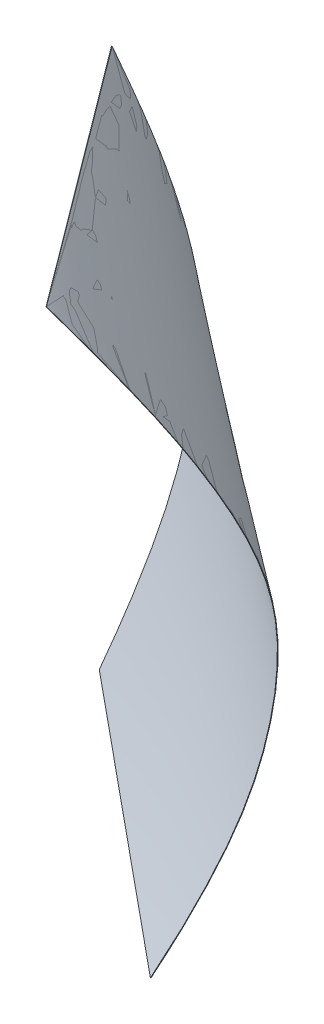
ISO-10303-21;
HEADER;
FILE_DESCRIPTION(('STEP AP214'),'2;1');
FILE_NAME('part.step','',(''),(''),'','','');
FILE_SCHEMA(('AUTOMOTIVE_DESIGN { 1 0 10303 214 1 1 1 1 }'));
ENDSEC;
DATA;
#1=APPLICATION_CONTEXT('core data for automotive mechanical design processes');
#2=APPLICATION_PROTOCOL_DEFINITION('international standard','automotive_design',2000,#1);
#3=PRODUCT_CONTEXT('',#1,'mechanical');
#4=PRODUCT('Part','Part','',(#3));
#5=PRODUCT_RELATED_PRODUCT_CATEGORY('part','',(#4));
#6=PRODUCT_DEFINITION_FORMATION('','',#4);
#7=PRODUCT_DEFINITION_CONTEXT('part definition',#1,'design');
#8=PRODUCT_DEFINITION('design','',#6,#7);
#9=PRODUCT_DEFINITION_SHAPE('','',#8);
#10=(LENGTH_UNIT() NAMED_UNIT(*) SI_UNIT(.MILLI.,.METRE.));
#11=(NAMED_UNIT(*) PLANE_ANGLE_UNIT() SI_UNIT($,.RADIAN.));
#12=(NAMED_UNIT(*) SI_UNIT($,.STERADIAN.) SOLID_ANGLE_UNIT());
#13=UNCERTAINTY_MEASURE_WITH_UNIT(LENGTH_MEASURE(1.E-05),#10,'distance_accuracy_value','');
#14=(GEOMETRIC_REPRESENTATION_CONTEXT(3) GLOBAL_UNCERTAINTY_ASSIGNED_CONTEXT((#13)) GLOBAL_UNIT_ASSIGNED_CONTEXT((#10,
#11,#12)) REPRESENTATION_CONTEXT('',''));
#15=CARTESIAN_POINT('',(0.,0.,0.));
#16=DIRECTION('',(0.,0.,1.));
#17=DIRECTION('',(1.,0.,0.));
#18=AXIS2_PLACEMENT_3D('',#15,#16,#17);
#19=CARTESIAN_POINT('',(23575.174925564,76960.8208400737,7145.63044390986));
#20=CARTESIAN_POINT('',(23580.2649110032,76974.5887329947,7144.19600178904));
#21=CARTESIAN_POINT('',(23585.3444399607,76988.3625819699,7142.78546683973));
#22=CARTESIAN_POINT('',(23595.4838076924,77015.923628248,7140.02359795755));
#23=CARTESIAN_POINT('',(23600.5431317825,77029.7107113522,7138.67059785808));
#24=CARTESIAN_POINT('',(23615.685226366,77071.0930873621,7134.69701808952));
#25=CARTESIAN_POINT('',(23625.7316273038,77098.7096826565,7132.16162297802));
#26=CARTESIAN_POINT('',(23645.7088108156,77154.0050455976,7127.32992284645));
#27=CARTESIAN_POINT('',(23655.6395333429,77181.6838663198,7125.03354462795));
#28=CARTESIAN_POINT('',(23675.36936835,77237.1077218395,7120.69352209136));
#29=CARTESIAN_POINT('',(23685.1691949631,77264.8524965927,7118.64913084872));
#30=CARTESIAN_POINT('',(23704.6163883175,77320.413265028,7114.83403602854));
#31=CARTESIAN_POINT('',(23714.263258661,77348.2295647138,7113.06399438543));
#32=CARTESIAN_POINT('',(23733.3814671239,77403.9392188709,7109.82090847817));
#33=CARTESIAN_POINT('',(23742.8543123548,77431.8321429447,7108.34607289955));
#34=CARTESIAN_POINT('',(23761.5937456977,77487.7008837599,7105.72496955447));
#35=CARTESIAN_POINT('',(23770.8594889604,77515.677079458,7104.5791782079));
#36=CARTESIAN_POINT('',(23789.1416944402,77571.7223363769,7102.66596619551));
#37=CARTESIAN_POINT('',(23798.156876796,77599.7920041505,7101.89927491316));
#38=CARTESIAN_POINT('',(23815.9036045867,77656.0283913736,7100.77766781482));
#39=CARTESIAN_POINT('',(23824.6369678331,77684.194772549,7100.42266603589));
#40=CARTESIAN_POINT('',(23841.7885693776,77740.6257134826,7100.12586821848));
#41=CARTESIAN_POINT('',(23850.2054631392,77768.8903152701,7100.18507212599));
#42=CARTESIAN_POINT('',(23874.9286094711,77853.8323197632,7100.97422959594));
#43=CARTESIAN_POINT('',(23890.7134924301,77910.6559939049,7102.30720743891));
#44=CARTESIAN_POINT('',(23913.1972003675,77996.1671088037,7105.38696823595));
#45=CARTESIAN_POINT('',(23920.4917825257,78024.7167344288,7106.5944617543));
#46=CARTESIAN_POINT('',(23934.6514804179,78081.9047090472,7109.3585075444));
#47=CARTESIAN_POINT('',(23941.5185941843,78110.5433252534,7110.91296329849));
#48=CARTESIAN_POINT('',(23961.4356761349,78196.5822263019,7116.11622769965));
#49=CARTESIAN_POINT('',(23973.7872669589,78254.1107858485,7120.3279128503));
#50=CARTESIAN_POINT('',(23987.7322880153,78326.1920124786,7126.90105855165));
#51=CARTESIAN_POINT('',(23990.4465921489,78340.6165378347,7128.2812618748));
#52=CARTESIAN_POINT('',(23995.7153091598,78369.4797350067,7131.18348829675));
#53=CARTESIAN_POINT('',(23998.2695355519,78383.9180512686,7132.70592956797));
#54=CARTESIAN_POINT('',(24005.6679727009,78427.2473241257,7137.52963884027));
#55=CARTESIAN_POINT('',(24010.2496596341,78456.1534367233,7141.08769209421));
#56=CARTESIAN_POINT('',(24016.529333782,78499.4993889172,7147.1238129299));
#57=CARTESIAN_POINT('',(24018.5235029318,78513.9456400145,7149.25233204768));
#58=CARTESIAN_POINT('',(24022.3030412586,78542.8225524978,7153.77216720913));
#59=CARTESIAN_POINT('',(24024.0883151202,78557.2521101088,7156.16636220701));
#60=CARTESIAN_POINT('',(24029.1064511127,78600.5087207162,7163.76974419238));
#61=CARTESIAN_POINT('',(24032.0052758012,78629.3056696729,7169.37663278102));
#62=CARTESIAN_POINT('',(24036.8101168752,78686.8110549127,7181.41019649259));
#63=CARTESIAN_POINT('',(24038.7146964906,78715.5211310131,7187.83562604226));
#64=CARTESIAN_POINT('',(24041.4383072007,78772.8622036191,7201.25428151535));
#65=CARTESIAN_POINT('',(24042.2666346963,78801.4915066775,7208.25484128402));
#66=CARTESIAN_POINT('',(24042.9500228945,78858.6485607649,7222.7097612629));
#67=CARTESIAN_POINT('',(24042.8047676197,78887.1769326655,7230.16286298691));
#68=CARTESIAN_POINT('',(24041.6496378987,78944.1335730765,7245.38725119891));
#69=CARTESIAN_POINT('',(24040.6443281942,78972.5619571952,7253.15798671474));
#70=CARTESIAN_POINT('',(24038.5996109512,79015.1309121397,7264.99014813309));
#71=CARTESIAN_POINT('',(24037.8287202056,79029.3084702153,7268.96346342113));
#72=CARTESIAN_POINT('',(24036.1181934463,79057.6367616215,7276.9685493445));
#73=CARTESIAN_POINT('',(24035.1779676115,79071.7872836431,7281.00096024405));
#74=CARTESIAN_POINT('',(24032.1071507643,79114.1915411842,7293.19815846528));
#75=CARTESIAN_POINT('',(24029.7284400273,79142.3986765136,7301.46167782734));
#76=CARTESIAN_POINT('',(24024.3113432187,79198.6501595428,7318.31559245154));
#77=CARTESIAN_POINT('',(24021.2709749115,79226.6955838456,7326.90664951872));
#78=CARTESIAN_POINT('',(24014.6435898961,79282.6446976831,7344.34460995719));
#79=CARTESIAN_POINT('',(24011.0581897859,79310.5492864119,7353.18959700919));
#80=CARTESIAN_POINT('',(23999.6966453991,79394.10333434,7379.97914722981));
#81=CARTESIAN_POINT('',(23991.3201754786,79449.5896977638,7398.17975693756));
#82=CARTESIAN_POINT('',(23978.1104141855,79532.6098523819,7425.8101447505));
#83=CARTESIAN_POINT('',(23973.5999815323,79560.2491418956,7435.07467461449));
#84=CARTESIAN_POINT('',(23966.7452430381,79601.6763766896,7449.02680218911));
#85=CARTESIAN_POINT('',(23964.4455785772,79615.480326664,7453.68647321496));
#86=CARTESIAN_POINT('',(23959.8284626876,79643.0810599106,7463.01976701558));
#87=CARTESIAN_POINT('',(23957.5101486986,79656.8770177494,7467.6949050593));
#88=CARTESIAN_POINT('',(23955.1907033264,79670.6731519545,7472.37201021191));
#89=CARTESIAN_POINT('',(23576.2663363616,76960.253058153,7144.05359700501));
#90=CARTESIAN_POINT('',(23581.3556723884,76974.0235287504,7142.61777724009));
#91=CARTESIAN_POINT('',(23586.4345863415,76987.8003681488,7141.20574930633));
#92=CARTESIAN_POINT('',(23596.572788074,77015.367275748,7138.44100368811));
#93=CARTESIAN_POINT('',(23601.6315504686,77029.157353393,7137.08656773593));
#94=CARTESIAN_POINT('',(23616.7720238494,77070.5489036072,7133.1086912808));
#95=CARTESIAN_POINT('',(23626.8174269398,77098.1718631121,7130.5704468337));
#96=CARTESIAN_POINT('',(23646.7927700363,77153.4804050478,7125.73310196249));
#97=CARTESIAN_POINT('',(23656.7226518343,77181.1660459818,7123.43392771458));
#98=CARTESIAN_POINT('',(23676.4509655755,77236.6039931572,7119.08838574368));
#99=CARTESIAN_POINT('',(23686.2501159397,77264.3560463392,7117.04127077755));
#100=CARTESIAN_POINT('',(23705.6962300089,77319.9322331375,7113.22077310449));
#101=CARTESIAN_POINT('',(23715.3426810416,77347.7566259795,7111.44805693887));
#102=CARTESIAN_POINT('',(23734.4602253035,77403.4830751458,7108.19970792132));
#103=CARTESIAN_POINT('',(23743.932817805,77431.3846756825,7106.72228275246));
#104=CARTESIAN_POINT('',(23762.67218836,77487.2722681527,7104.09606026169));
#105=CARTESIAN_POINT('',(23771.9380879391,77515.258521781,7102.94775034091));
#106=CARTESIAN_POINT('',(23790.2210365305,77571.3254129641,7101.02963015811));
#107=CARTESIAN_POINT('',(23799.2367641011,77599.4065132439,7100.26056072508));
#108=CARTESIAN_POINT('',(23816.9848122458,77655.6664411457,7099.13446178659));
#109=CARTESIAN_POINT('',(23825.7189202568,77683.8447979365,7098.77735451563));
#110=CARTESIAN_POINT('',(23842.8722623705,77740.3001352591,7098.47669824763));
#111=CARTESIAN_POINT('',(23851.2901785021,77768.5772611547,7098.53414922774));
#112=CARTESIAN_POINT('',(23876.0165610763,77853.556394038,7099.31867737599));
#113=CARTESIAN_POINT('',(23891.8038532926,77910.4042544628,7100.6493992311));
#114=CARTESIAN_POINT('',(23914.2920274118,77995.9513994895,7103.72715796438));
#115=CARTESIAN_POINT('',(23921.5882475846,78024.5130455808,7104.93421394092));
#116=CARTESIAN_POINT('',(23935.7515539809,78081.725043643,7107.6978733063));
#117=CARTESIAN_POINT('',(23942.6205888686,78110.3754275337,7109.25236582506));
#118=CARTESIAN_POINT('',(23962.5446512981,78196.4523175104,7114.45672133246));
#119=CARTESIAN_POINT('',(23974.9025792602,78254.0104714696,7118.67043340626));
#120=CARTESIAN_POINT('',(23988.8580007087,78326.1338087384,7125.24895090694));
#121=CARTESIAN_POINT('',(23991.5745143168,78340.5670129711,7126.63037468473));
#122=CARTESIAN_POINT('',(23996.8479881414,78369.4483214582,7129.5354163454));
#123=CARTESIAN_POINT('',(23999.4047964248,78383.8963878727,7131.05946867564));
#124=CARTESIAN_POINT('',(24006.811591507,78427.2569548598,7135.88874781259));
#125=CARTESIAN_POINT('',(24011.3996637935,78456.1865730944,7139.45148660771));
#126=CARTESIAN_POINT('',(24017.6901174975,78499.5718601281,7145.49669182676));
#127=CARTESIAN_POINT('',(24019.6880867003,78514.0318662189,7147.62858743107));
#128=CARTESIAN_POINT('',(24023.4755474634,78542.9375626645,7152.15592503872));
#129=CARTESIAN_POINT('',(24025.2649572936,78557.382760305,7154.55431261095));
#130=CARTESIAN_POINT('',(24030.2955703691,78600.6842151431,7162.17092030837));
#131=CARTESIAN_POINT('',(24033.2029086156,78629.5090136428,7167.78754491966));
#132=CARTESIAN_POINT('',(24038.0253047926,78687.0667718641,7179.84214020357));
#133=CARTESIAN_POINT('',(24039.9389261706,78715.8012646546,7186.27885510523));
#134=CARTESIAN_POINT('',(24042.6812203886,78773.1879164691,7199.72136701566));
#135=CARTESIAN_POINT('',(24043.5191832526,78801.8383367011,7206.73448908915));
#136=CARTESIAN_POINT('',(24044.222452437,78859.0339504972,7221.2154261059));
#137=CARTESIAN_POINT('',(24044.0874447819,78887.5797618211,7228.68198124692));
#138=CARTESIAN_POINT('',(24042.9534428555,78944.5675227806,7243.9338678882));
#139=CARTESIAN_POINT('',(24041.9590221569,78973.0094378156,7251.71860300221));
#140=CARTESIAN_POINT('',(24039.9311467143,79015.5968169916,7263.57238005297));
#141=CARTESIAN_POINT('',(24039.1659649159,79029.7801415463,7267.55299287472));
#142=CARTESIAN_POINT('',(24037.4669839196,79058.1201756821,7275.57312843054));
#143=CARTESIAN_POINT('',(24036.5325947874,79072.2766472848,7279.61328481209));
#144=CARTESIAN_POINT('',(24033.4794716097,79114.6989646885,7291.83441525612));
#145=CARTESIAN_POINT('',(24031.1128229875,79142.9184609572,7300.1148502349));
#146=CARTESIAN_POINT('',(24025.7201047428,79199.1956596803,7317.00469307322));
#147=CARTESIAN_POINT('',(24022.6922157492,79227.2526707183,7325.61423365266));
#148=CARTESIAN_POINT('',(24016.0904160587,79283.2212888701,7343.08968098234));
#149=CARTESIAN_POINT('',(24012.5181320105,79311.1337069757,7351.95363388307));
#150=CARTESIAN_POINT('',(24001.1967864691,79394.7059305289,7378.80067840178));
#151=CARTESIAN_POINT('',(23992.8479599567,79450.1997977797,7397.04127198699));
#152=CARTESIAN_POINT('',(23979.6802783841,79533.2239037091,7424.73353376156));
#153=CARTESIAN_POINT('',(23975.1839750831,79560.8632729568,7434.01899597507));
#154=CARTESIAN_POINT('',(23968.3505045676,79602.2885958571,7448.00284633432));
#155=CARTESIAN_POINT('',(23966.0579439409,79616.0915568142,7452.67314114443));
#156=CARTESIAN_POINT('',(23961.4550233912,79643.6897404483,7462.02781211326));
#157=CARTESIAN_POINT('',(23959.1437768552,79657.4842814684,7466.7137528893));
#158=CARTESIAN_POINT('',(23956.8314924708,79671.278031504,7471.40147854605));
#159=B_SPLINE_SURFACE_WITH_KNOTS('',1,3,((#19,#20,#21,#22,#23,#24,#25,#26,#27,#28,#29,#30,#31,
#32,#33,#34,#35,#36,#37,#38,#39,#40,#41,#42,#43,#44,#45,#46,#47,#48,#49,#50,#51,#52,#53,#54,#55,
#56,#57,#58,#59,#60,#61,#62,#63,#64,#65,#66,#67,#68,#69,#70,#71,#72,#73,#74,#75,#76,#77,#78,#79,
#80,#81,#82,#83,#84,#85,#86,#87,#88),(#89,#90,#91,#92,#93,#94,#95,#96,#97,#98,#99,#100,#101,
#102,#103,#104,#105,#106,#107,#108,#109,#110,#111,#112,#113,#114,#115,#116,#117,#118,#119,#120,
#121,#122,#123,#124,#125,#126,#127,#128,#129,#130,#131,#132,#133,#134,#135,#136,#137,#138,#139,
#140,#141,#142,#143,#144,#145,#146,#147,#148,#149,#150,#151,#152,#153,#154,#155,#156,#157,
#158)),.UNSPECIFIED.,.F.,.F.,.F.,(2,2),(4,2,2,2,2,2,2,2,2,2,2,2,2,2,2,2,2,2,2,2,2,2,2,2,2,2,2,2,
2,2,2,2,2,2,4),(0.,1.),(0.,0.015625,0.03125,0.0625,0.09375,0.125,0.15625,0.1875,0.21875,0.25,
0.28125,0.3125,0.375,0.40625,0.4375,0.5,0.515625,0.53125,0.5625,0.578125,0.59375,0.625,0.65625,
0.6875,0.71875,0.75,0.765625,0.78125,0.8125,0.84375,0.875,0.9375,0.96875,0.984375,1.),.UNSPECIFIED.);
#160=CARTESIAN_POINT('',(23956.8314924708,79671.278031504,7471.40147854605));
#161=CARTESIAN_POINT('',(23955.1907033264,79670.6731519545,7472.37201021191));
#162=B_SPLINE_CURVE_WITH_KNOTS('',1,(#160,#161),.UNSPECIFIED.,.F.,.F.,(2,2),(0.,1.),.UNSPECIFIED.);
#163=CARTESIAN_POINT('',(23956.8314924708,79671.278031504,7471.40147854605));
#164=VERTEX_POINT('',#163);
#165=CARTESIAN_POINT('',(23955.1907033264,79670.6731519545,7472.37201021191));
#166=VERTEX_POINT('',#165);
#167=EDGE_CURVE('E15',#164,#166,#162,.T.);
#168=CARTESIAN_POINT('',(23956.8314924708,79671.278031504,7471.40147854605));
#169=CARTESIAN_POINT('',(23959.1437768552,79657.4842814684,7466.7137528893));
#170=CARTESIAN_POINT('',(23961.4550233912,79643.6897404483,7462.02781211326));
#171=CARTESIAN_POINT('',(23966.0579439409,79616.0915568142,7452.67314114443));
#172=CARTESIAN_POINT('',(23968.3505045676,79602.2885958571,7448.00284633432));
#173=CARTESIAN_POINT('',(23975.1839750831,79560.8632729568,7434.01899597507));
#174=CARTESIAN_POINT('',(23979.6802783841,79533.2239037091,7424.73353376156));
#175=CARTESIAN_POINT('',(23992.8479599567,79450.1997977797,7397.04127198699));
#176=CARTESIAN_POINT('',(24001.1967864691,79394.7059305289,7378.80067840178));
#177=CARTESIAN_POINT('',(24012.5181320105,79311.1337069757,7351.95363388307));
#178=CARTESIAN_POINT('',(24016.0904160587,79283.2212888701,7343.08968098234));
#179=CARTESIAN_POINT('',(24022.6922157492,79227.2526707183,7325.61423365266));
#180=CARTESIAN_POINT('',(24025.7201047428,79199.1956596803,7317.00469307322));
#181=CARTESIAN_POINT('',(24031.1128229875,79142.9184609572,7300.1148502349));
#182=CARTESIAN_POINT('',(24033.4794716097,79114.6989646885,7291.83441525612));
#183=CARTESIAN_POINT('',(24036.5325947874,79072.2766472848,7279.61328481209));
#184=CARTESIAN_POINT('',(24037.4669839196,79058.1201756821,7275.57312843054));
#185=CARTESIAN_POINT('',(24039.1659649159,79029.7801415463,7267.55299287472));
#186=CARTESIAN_POINT('',(24039.9311467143,79015.5968169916,7263.57238005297));
#187=CARTESIAN_POINT('',(24041.9590221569,78973.0094378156,7251.71860300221));
#188=CARTESIAN_POINT('',(24042.9534428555,78944.5675227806,7243.9338678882));
#189=CARTESIAN_POINT('',(24044.0874447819,78887.5797618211,7228.68198124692));
#190=CARTESIAN_POINT('',(24044.222452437,78859.0339504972,7221.2154261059));
#191=CARTESIAN_POINT('',(24043.5191832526,78801.8383367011,7206.73448908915));
#192=CARTESIAN_POINT('',(24042.6812203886,78773.1879164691,7199.72136701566));
#193=CARTESIAN_POINT('',(24039.9389261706,78715.8012646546,7186.27885510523));
#194=CARTESIAN_POINT('',(24038.0253047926,78687.0667718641,7179.84214020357));
#195=CARTESIAN_POINT('',(24033.2029086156,78629.5090136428,7167.78754491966));
#196=CARTESIAN_POINT('',(24030.2955703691,78600.6842151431,7162.17092030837));
#197=CARTESIAN_POINT('',(24025.2649572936,78557.382760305,7154.55431261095));
#198=CARTESIAN_POINT('',(24023.4755474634,78542.9375626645,7152.15592503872));
#199=CARTESIAN_POINT('',(24019.6880867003,78514.0318662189,7147.62858743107));
#200=CARTESIAN_POINT('',(24017.6901174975,78499.5718601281,7145.49669182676));
#201=CARTESIAN_POINT('',(24011.3996637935,78456.1865730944,7139.45148660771));
#202=CARTESIAN_POINT('',(24006.811591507,78427.2569548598,7135.88874781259));
#203=CARTESIAN_POINT('',(23999.4047964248,78383.8963878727,7131.05946867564));
#204=CARTESIAN_POINT('',(23996.8479881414,78369.4483214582,7129.5354163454));
#205=CARTESIAN_POINT('',(23991.5745143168,78340.5670129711,7126.63037468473));
#206=CARTESIAN_POINT('',(23988.8580007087,78326.1338087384,7125.24895090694));
#207=CARTESIAN_POINT('',(23974.9025792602,78254.0104714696,7118.67043340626));
#208=CARTESIAN_POINT('',(23962.5446512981,78196.4523175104,7114.45672133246));
#209=CARTESIAN_POINT('',(23942.6205888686,78110.3754275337,7109.25236582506));
#210=CARTESIAN_POINT('',(23935.7515539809,78081.725043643,7107.6978733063));
#211=CARTESIAN_POINT('',(23921.5882475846,78024.5130455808,7104.93421394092));
#212=CARTESIAN_POINT('',(23914.2920274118,77995.9513994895,7103.72715796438));
#213=CARTESIAN_POINT('',(23891.8038532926,77910.4042544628,7100.6493992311));
#214=CARTESIAN_POINT('',(23876.0165610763,77853.556394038,7099.31867737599));
#215=CARTESIAN_POINT('',(23851.2901785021,77768.5772611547,7098.53414922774));
#216=CARTESIAN_POINT('',(23842.8722623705,77740.3001352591,7098.47669824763));
#217=CARTESIAN_POINT('',(23825.7189202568,77683.8447979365,7098.77735451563));
#218=CARTESIAN_POINT('',(23816.9848122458,77655.6664411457,7099.13446178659));
#219=CARTESIAN_POINT('',(23799.2367641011,77599.4065132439,7100.26056072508));
#220=CARTESIAN_POINT('',(23790.2210365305,77571.3254129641,7101.02963015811));
#221=CARTESIAN_POINT('',(23771.9380879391,77515.258521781,7102.94775034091));
#222=CARTESIAN_POINT('',(23762.67218836,77487.2722681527,7104.09606026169));
#223=CARTESIAN_POINT('',(23743.932817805,77431.3846756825,7106.72228275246));
#224=CARTESIAN_POINT('',(23734.4602253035,77403.4830751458,7108.19970792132));
#225=CARTESIAN_POINT('',(23715.3426810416,77347.7566259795,7111.44805693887));
#226=CARTESIAN_POINT('',(23705.6962300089,77319.9322331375,7113.22077310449));
#227=CARTESIAN_POINT('',(23686.2501159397,77264.3560463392,7117.04127077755));
#228=CARTESIAN_POINT('',(23676.4509655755,77236.6039931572,7119.08838574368));
#229=CARTESIAN_POINT('',(23656.7226518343,77181.1660459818,7123.43392771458));
#230=CARTESIAN_POINT('',(23646.7927700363,77153.4804050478,7125.73310196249));
#231=CARTESIAN_POINT('',(23626.8174269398,77098.1718631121,7130.5704468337));
#232=CARTESIAN_POINT('',(23616.7720238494,77070.5489036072,7133.1086912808));
#233=CARTESIAN_POINT('',(23601.6315504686,77029.157353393,7137.08656773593));
#234=CARTESIAN_POINT('',(23596.572788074,77015.367275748,7138.44100368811));
#235=CARTESIAN_POINT('',(23586.4345863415,76987.8003681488,7141.20574930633));
#236=CARTESIAN_POINT('',(23581.3556723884,76974.0235287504,7142.61777724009));
#237=CARTESIAN_POINT('',(23576.2663363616,76960.253058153,7144.05359700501));
#238=B_SPLINE_CURVE_WITH_KNOTS('',3,(#168,#169,#170,#171,#172,#173,#174,#175,#176,#177,#178,
#179,#180,#181,#182,#183,#184,#185,#186,#187,#188,#189,#190,#191,#192,#193,#194,#195,#196,#197,
#198,#199,#200,#201,#202,#203,#204,#205,#206,#207,#208,#209,#210,#211,#212,#213,#214,#215,#216,
#217,#218,#219,#220,#221,#222,#223,#224,#225,#226,#227,#228,#229,#230,#231,#232,#233,#234,#235,
#236,#237),.UNSPECIFIED.,.F.,.F.,(4,2,2,2,2,2,2,2,2,2,2,2,2,2,2,2,2,2,2,2,2,2,2,2,2,2,2,2,2,2,2,
2,2,2,4),(0.,0.015625,0.03125,0.0625,0.125,0.15625,0.1875,0.21875,0.234375,0.25,0.28125,0.3125,
0.34375,0.375,0.40625,0.421875,0.4375,0.46875,0.484375,0.5,0.5625,0.59375,0.625,0.6875,0.71875,
0.75,0.78125,0.8125,0.84375,0.875,0.90625,0.9375,0.96875,0.984375,1.),.UNSPECIFIED.);
#239=CARTESIAN_POINT('',(23576.2663363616,76960.253058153,7144.05359700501));
#240=VERTEX_POINT('',#239);
#241=EDGE_CURVE('E131',#164,#240,#238,.T.);
#242=CARTESIAN_POINT('',(23576.2663363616,76960.253058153,7144.05359700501));
#243=CARTESIAN_POINT('',(23575.174925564,76960.8208400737,7145.63044390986));
#244=B_SPLINE_CURVE_WITH_KNOTS('',1,(#242,#243),.UNSPECIFIED.,.F.,.F.,(2,2),(0.,1.),.UNSPECIFIED.);
#245=CARTESIAN_POINT('',(23575.174925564,76960.8208400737,7145.63044390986));
#246=VERTEX_POINT('',#245);
#247=EDGE_CURVE('E80',#240,#246,#244,.T.);
#248=CARTESIAN_POINT('',(23955.1907033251,79670.6731519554,7472.37201021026));
#249=CARTESIAN_POINT('',(23959.8310138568,79643.0843017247,7463.01568770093));
#250=CARTESIAN_POINT('',(23964.4601570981,79615.4867771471,7453.67775751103));
#251=CARTESIAN_POINT('',(23973.5997832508,79560.2500642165,7435.07518437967));
#252=CARTESIAN_POINT('',(23978.1102757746,79532.6108794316,7425.81053554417));
#253=CARTESIAN_POINT('',(23986.9167356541,79477.2640948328,7407.39017411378));
#254=CARTESIAN_POINT('',(23991.212718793,79449.5565002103,7398.23445354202));
#255=CARTESIAN_POINT('',(23999.4963400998,79394.0509456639,7380.06406217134));
#256=CARTESIAN_POINT('',(24003.484001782,79366.2529928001,7371.04938065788));
#257=CARTESIAN_POINT('',(24009.1643977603,79324.4752944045,7357.65474872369));
#258=CARTESIAN_POINT('',(24011.0076294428,79310.5363536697,7353.21123480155));
#259=CARTESIAN_POINT('',(24014.57562409,79282.6276299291,7344.37648806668));
#260=CARTESIAN_POINT('',(24016.3003942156,79268.6578488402,7339.98525210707));
#261=CARTESIAN_POINT('',(24019.6140731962,79240.6832549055,7331.26626363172));
#262=CARTESIAN_POINT('',(24021.2029900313,79226.6784441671,7326.9385073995));
#263=CARTESIAN_POINT('',(24024.2288057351,79198.6306389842,7318.35640959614));
#264=CARTESIAN_POINT('',(24025.6657120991,79184.5876464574,7314.10206441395));
#265=CARTESIAN_POINT('',(24028.3740551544,79156.4613556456,7305.67525560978));
#266=CARTESIAN_POINT('',(24029.6454937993,79142.3780578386,7301.50279102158));
#267=CARTESIAN_POINT('',(24032.023865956,79114.1757336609,7293.23134210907));
#268=CARTESIAN_POINT('',(24033.1307957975,79100.0567065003,7289.13235942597));
#269=CARTESIAN_POINT('',(24035.1779436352,79071.7871525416,7281.00096519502));
#270=CARTESIAN_POINT('',(24036.1181591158,79057.6366252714,7276.96855465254));
#271=CARTESIAN_POINT('',(24037.4011097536,79036.3905438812,7270.96471321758));
#272=CARTESIAN_POINT('',(24037.8075328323,79029.3051012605,7268.97088576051));
#273=CARTESIAN_POINT('',(24038.5771850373,79015.1279109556,7264.99758545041));
#274=CARTESIAN_POINT('',(24038.9404145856,79008.0361633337,7263.01811245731));
#275=CARTESIAN_POINT('',(24039.6219450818,78993.8465047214,7259.07411707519));
#276=CARTESIAN_POINT('',(24039.9402469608,78986.7485938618,7257.1095943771));
#277=CARTESIAN_POINT('',(24040.5299591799,78972.546620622,7253.19649591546));
#278=CARTESIAN_POINT('',(24040.8013705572,78965.4425583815,7251.24791980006));
#279=CARTESIAN_POINT('',(24041.5422576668,78944.1214185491,7245.42765656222));
#280=CARTESIAN_POINT('',(24041.9384179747,78929.8947375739,7241.58125362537));
#281=CARTESIAN_POINT('',(24042.3715900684,78908.5357610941,7235.8720258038));
#282=CARTESIAN_POINT('',(24042.4891353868,78901.4130686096,7233.97904540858));
#283=CARTESIAN_POINT('',(24042.6682968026,78887.1614416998,7230.21491811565));
#284=CARTESIAN_POINT('',(24042.7299146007,78880.0325074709,7228.34377055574));
#285=CARTESIAN_POINT('',(24042.8284950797,78858.6366179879,7222.76643159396));
#286=CARTESIAN_POINT('',(24042.77920137,78844.3597804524,7219.09613081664));
#287=CARTESIAN_POINT('',(24042.4374659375,78815.7810997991,7211.86867728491));
#288=CARTESIAN_POINT('',(24042.1450380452,78801.4792581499,7208.31151810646));
#289=CARTESIAN_POINT('',(24041.5149415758,78780.0088624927,7203.07305415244));
#290=CARTESIAN_POINT('',(24041.273005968,78772.8492451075,7201.34314012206));
#291=CARTESIAN_POINT('',(24040.7240364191,78758.5245184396,7197.91778856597));
#292=CARTESIAN_POINT('',(24040.4170049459,78751.3594093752,7196.22234973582));
#293=CARTESIAN_POINT('',(24039.7360083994,78737.0241284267,7192.86760536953));
#294=CARTESIAN_POINT('',(24039.3620452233,78729.8539566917,7191.20829881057));
#295=CARTESIAN_POINT('',(24038.5472230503,78715.50866823,7187.92880242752));
#296=CARTESIAN_POINT('',(24038.1063658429,78708.3335516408,7186.30861155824));
#297=CARTESIAN_POINT('',(24037.1594885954,78693.9781807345,7183.11137492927));
#298=CARTESIAN_POINT('',(24036.6534700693,78686.7979265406,7181.5343281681));
#299=CARTESIAN_POINT('',(24035.5778788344,78672.4321582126,7178.42745667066));
#300=CARTESIAN_POINT('',(24035.0083077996,78665.2466442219,7176.8976306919));
#301=CARTESIAN_POINT('',(24033.8071033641,78650.8703016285,7173.88924488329));
#302=CARTESIAN_POINT('',(24033.1754718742,78643.6794731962,7172.41068347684));
#303=CARTESIAN_POINT('',(24031.8517133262,78629.2923559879,7169.50881193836));
#304=CARTESIAN_POINT('',(24031.1595872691,78622.0960673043,7168.08550089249));
#305=CARTESIAN_POINT('',(24029.7163924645,78607.6980292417,7165.29809224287));
#306=CARTESIAN_POINT('',(24028.9653244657,78600.4962799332,7163.93399388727));
#307=CARTESIAN_POINT('',(24027.4058298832,78586.0875591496,7161.2689947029));
#308=CARTESIAN_POINT('',(24026.5974054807,78578.8805878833,7159.96809147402));
#309=CARTESIAN_POINT('',(24025.342852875,78568.0663052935,7158.06721120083));
#310=CARTESIAN_POINT('',(24024.9176906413,78564.4609712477,7157.44200758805));
#311=CARTESIAN_POINT('',(24024.0535082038,78557.2490160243,7156.2091698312));
#312=CARTESIAN_POINT('',(24023.614488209,78553.6423948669,7155.60153542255));
#313=CARTESIAN_POINT('',(24022.2770037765,78542.8203651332,7153.80487473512));
#314=CARTESIAN_POINT('',(24021.3581496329,78535.6030894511,7152.6421436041));
#315=CARTESIAN_POINT('',(24019.4683341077,78521.164641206,7150.38228336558));
#316=CARTESIAN_POINT('',(24018.4973693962,78513.943468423,7149.28515845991));
#317=CARTESIAN_POINT('',(24016.504555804,78499.4986128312,7147.15290094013));
#318=CARTESIAN_POINT('',(24015.4827041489,78492.2749299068,7146.11777171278));
#319=CARTESIAN_POINT('',(24012.3428071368,78470.6015833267,7143.09966710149));
#320=CARTESIAN_POINT('',(24010.1505209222,78456.150393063,7141.20409465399));
#321=CARTESIAN_POINT('',(24005.5800094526,78427.2513365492,7137.61507054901));
#322=CARTESIAN_POINT('',(24003.2017680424,78412.8034706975,7135.92163648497));
#323=CARTESIAN_POINT('',(23998.2693326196,78383.9172801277,7132.70585809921));
#324=CARTESIAN_POINT('',(23995.7151199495,78369.4789565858,7131.18353196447));
#325=CARTESIAN_POINT('',(23990.4465743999,78340.6161824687,7128.28110419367));
#326=CARTESIAN_POINT('',(23987.732228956,78326.1917330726,7126.90101374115));
#327=CARTESIAN_POINT('',(23982.1542418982,78297.3593010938,7124.27179947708));
#328=CARTESIAN_POINT('',(23979.2905951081,78282.9513190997,7123.02268021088));
#329=CARTESIAN_POINT('',(23973.4220659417,78254.1535199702,7120.64584398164));
#330=CARTESIAN_POINT('',(23970.417177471,78239.7637036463,7119.51813226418));
#331=CARTESIAN_POINT('',(23964.2750073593,78211.0034836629,7117.37419067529));
#332=CARTESIAN_POINT('',(23961.1377204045,78196.6330808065,7116.35796528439));
#333=CARTESIAN_POINT('',(23954.7387295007,78167.9125622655,7114.42818656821));
#334=CARTESIAN_POINT('',(23951.477021,78153.5624473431,7113.51463700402));
#335=CARTESIAN_POINT('',(23946.4978637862,78132.0529643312,7112.21374350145));
#336=CARTESIAN_POINT('',(23944.8236823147,78124.8856265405,7111.79167737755));
#337=CARTESIAN_POINT('',(23941.4474533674,78110.5561853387,7110.9695444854));
#338=CARTESIAN_POINT('',(23939.7454056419,78103.3940819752,7110.5694779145));
#339=CARTESIAN_POINT('',(23934.5980714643,78081.9158048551,7109.40204956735));
#340=CARTESIAN_POINT('',(23931.1115992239,78067.6076865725,7108.66746051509));
#341=CARTESIAN_POINT('',(23924.0316377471,78039.013652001,7107.2855037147));
#342=CARTESIAN_POINT('',(23920.4381477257,78024.7277358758,7106.63813660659));
#343=CARTESIAN_POINT('',(23913.1472784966,77996.178517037,7105.43223141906));
#344=CARTESIAN_POINT('',(23909.4498981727,77981.9152145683,7104.87369429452));
#345=CARTESIAN_POINT('',(23901.95535415,77953.4115558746,7103.8470669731));
#346=CARTESIAN_POINT('',(23898.1581901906,77939.1711997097,7103.37897701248));
#347=CARTESIAN_POINT('',(23890.467598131,77910.7138293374,7102.53535138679));
#348=CARTESIAN_POINT('',(23886.5741704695,77896.496815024,7102.15981530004));
#349=CARTESIAN_POINT('',(23878.6940757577,77868.0864824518,7101.50411450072));
#350=CARTESIAN_POINT('',(23874.7074089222,77853.8931641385,7101.22394956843));
#351=CARTESIAN_POINT('',(23866.643901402,77825.5305858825,7100.76170305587));
#352=CARTESIAN_POINT('',(23862.5670608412,77811.3613259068,7100.57962134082));
#353=CARTESIAN_POINT('',(23854.3259706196,77783.0473338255,7100.31662813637));
#354=CARTESIAN_POINT('',(23850.1617211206,77768.9026016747,7100.23571645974));
#355=CARTESIAN_POINT('',(23841.7490672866,77740.6379007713,7100.17742754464));
#356=CARTESIAN_POINT('',(23837.5006625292,77726.5179321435,7100.20005082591));
#357=CARTESIAN_POINT('',(23828.9248585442,77698.3025007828,7100.34848371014));
#358=CARTESIAN_POINT('',(23824.5974590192,77684.2070381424,7100.47429370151));
#359=CARTESIAN_POINT('',(23815.8684862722,77656.0404140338,7100.82909049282));
#360=CARTESIAN_POINT('',(23811.4669130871,77641.9692525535,7101.05807724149));
#361=CARTESIAN_POINT('',(23802.5935217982,77613.8509956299,7101.61886842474));
#362=CARTESIAN_POINT('',(23798.1217029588,77599.8039004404,7101.95067393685));
#363=CARTESIAN_POINT('',(23789.1104937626,77571.7338455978,7102.71336941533));
#364=CARTESIAN_POINT('',(23784.5711022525,77557.7108863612,7103.14426107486));
#365=CARTESIAN_POINT('',(23775.4299774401,77529.6882115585,7104.10089417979));
#366=CARTESIAN_POINT('',(23770.8282427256,77515.6884965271,7104.62663777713));
#367=CARTESIAN_POINT('',(23761.5676711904,77487.711138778,7105.76630749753));
#368=CARTESIAN_POINT('',(23756.9088327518,77473.7334966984,7106.38023612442));
#369=CARTESIAN_POINT('',(23747.5390984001,77445.7991516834,7107.69082407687));
#370=CARTESIAN_POINT('',(23742.8282010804,77431.8424493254,7108.38748564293));
#371=CARTESIAN_POINT('',(23733.3596080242,77403.9487422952,7109.85790395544));
#372=CARTESIAN_POINT('',(23728.601911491,77390.0117379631,7110.63166201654));
#373=CARTESIAN_POINT('',(23719.0427690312,77362.1569137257,7112.25324852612));
#374=CARTESIAN_POINT('',(23714.2413226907,77348.2390940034,7113.10107767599));
#375=CARTESIAN_POINT('',(23704.597219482,77320.4221268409,7114.86835931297));
#376=CARTESIAN_POINT('',(23699.7545621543,77306.5229796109,7115.78781259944));
#377=CARTESIAN_POINT('',(23690.0309539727,77278.7425901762,7117.69536744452));
#378=CARTESIAN_POINT('',(23685.1500025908,77264.8613482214,7118.68346995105));
#379=CARTESIAN_POINT('',(23675.3529923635,77237.1159062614,7120.72503880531));
#380=CARTESIAN_POINT('',(23670.436933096,77223.2517064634,7121.77850594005));
#381=CARTESIAN_POINT('',(23655.6394017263,77181.6837316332,7125.03360680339));
#382=CARTESIAN_POINT('',(23645.7086595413,77154.0048194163,7127.32992354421));
#383=CARTESIAN_POINT('',(23630.7259254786,77112.5334334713,7130.95371533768));
#384=CARTESIAN_POINT('',(23625.7172068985,77098.71736728,7132.19154179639));
#385=CARTESIAN_POINT('',(23615.6731582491,77071.1001046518,7134.72545497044));
#386=CARTESIAN_POINT('',(23610.6378279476,77057.298908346,7136.02154219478));
#387=CARTESIAN_POINT('',(23600.5431229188,77029.7106491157,7138.67061146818));
#388=CARTESIAN_POINT('',(23595.4837479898,77015.923586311,7140.02359399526));
#389=CARTESIAN_POINT('',(23587.8792973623,76995.2528254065,7142.09500552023));
#390=CARTESIAN_POINT('',(23585.3419085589,76988.3641911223,7142.79246768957));
#391=CARTESIAN_POINT('',(23580.2621286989,76974.59011753,7144.20117241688));
#392=CARTESIAN_POINT('',(23577.719737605,76967.7046782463,7144.91241507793));
#393=CARTESIAN_POINT('',(23575.1749255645,76960.8208400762,7145.63044390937));
#394=B_SPLINE_CURVE_WITH_KNOTS('',3,(#248,#249,#250,#251,#252,#253,#254,#255,#256,#257,#258,
#259,#260,#261,#262,#263,#264,#265,#266,#267,#268,#269,#270,#271,#272,#273,#274,#275,#276,#277,
#278,#279,#280,#281,#282,#283,#284,#285,#286,#287,#288,#289,#290,#291,#292,#293,#294,#295,#296,
#297,#298,#299,#300,#301,#302,#303,#304,#305,#306,#307,#308,#309,#310,#311,#312,#313,#314,#315,
#316,#317,#318,#319,#320,#321,#322,#323,#324,#325,#326,#327,#328,#329,#330,#331,#332,#333,#334,
#335,#336,#337,#338,#339,#340,#341,#342,#343,#344,#345,#346,#347,#348,#349,#350,#351,#352,#353,
#354,#355,#356,#357,#358,#359,#360,#361,#362,#363,#364,#365,#366,#367,#368,#369,#370,#371,#372,
#373,#374,#375,#376,#377,#378,#379,#380,#381,#382,#383,#384,#385,#386,#387,#388,#389,#390,#391,
#392,#393),.UNSPECIFIED.,.F.,.F.,(4,2,2,2,2,2,2,2,2,2,2,2,2,2,2,2,2,2,2,2,2,2,2,2,2,2,2,2,2,2,2,
2,2,2,2,2,2,2,2,2,2,2,2,2,2,2,2,2,2,2,2,2,2,2,2,2,2,2,2,2,2,2,2,2,2,2,2,2,2,2,2,2,4),(0.,
88.4992158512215,176.991239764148,265.476742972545,353.955491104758,398.192205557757,
442.42624356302,486.657681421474,530.886937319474,575.115670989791,619.345391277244,
663.575778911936,685.691183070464,707.806371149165,729.921100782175,752.035341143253,
796.261794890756,818.374243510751,840.486019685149,884.707101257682,928.925667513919,
951.034210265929,973.141914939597,995.248992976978,1017.35547965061,1039.46145274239,
1061.56684367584,1083.67155417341,1105.77589890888,1127.87996289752,1149.98318673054,
1161.0344038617,1172.08545447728,1194.18847282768,1216.29290528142,1238.3985441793,
1282.61218246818,1326.82966616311,1371.05184528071,1415.27749880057,1459.50468665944,
1503.73378464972,1547.96465952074,1592.19715407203,1614.31417375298,1636.43139179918,
1680.66589730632,1724.90072738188,1769.13603292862,1813.37145403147,1857.60667359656,
1901.84179124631,1946.07684811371,1990.3118231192,2034.54702018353,2078.78238375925,
2123.01772535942,2167.25353055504,2211.49009169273,2255.72765656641,2299.96647771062,
2344.20649715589,2388.44727111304,2432.68846403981,2476.93015079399,2521.17244856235,
2565.41527911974,2653.90169917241,2698.14555893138,2742.38980530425,2786.63442348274,
2808.75685812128,2830.87945829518),.UNSPECIFIED.);
#395=EDGE_CURVE('E308',#166,#246,#394,.T.);
#396=ORIENTED_EDGE('',*,*,#167,.F.);
#397=ORIENTED_EDGE('',*,*,#241,.T.);
#398=ORIENTED_EDGE('',*,*,#247,.T.);
#399=ORIENTED_EDGE('',*,*,#395,.F.);
#400=EDGE_LOOP('',(#396,#397,#398,#399));
#401=FACE_BOUND('',#400,.T.);
#402=ADVANCED_FACE('F66',(#401),#159,.F.);
#403=CARTESIAN_POINT('',(23575.174925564,76960.8208400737,7145.63044390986));
#404=CARTESIAN_POINT('',(23915.9618172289,76875.9594336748,7412.0616772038));
#405=CARTESIAN_POINT('',(24256.74861589,76791.093303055,7678.491523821));
#406=CARTESIAN_POINT('',(24597.5349627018,76706.2231438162,7944.92066440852));
#407=CARTESIAN_POINT('',(23576.2663363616,76960.253058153,7144.05359700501));
#408=CARTESIAN_POINT('',(23917.0348885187,76875.338394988,7410.49131304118));
#409=CARTESIAN_POINT('',(24257.8034406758,76790.4237318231,7676.9290290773));
#410=CARTESIAN_POINT('',(24598.571992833,76705.5090686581,7943.36674511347));
#411=B_SPLINE_SURFACE_WITH_KNOTS('',1,3,((#403,#404,#405,#406),(#407,#408,#409,#410)),
.UNSPECIFIED.,.F.,.F.,.F.,(2,2),(4,4),(0.,1.),(-0.661230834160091,0.661230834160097),.UNSPECIFIED.);
#412=CARTESIAN_POINT('',(23576.2663363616,76960.253058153,7144.05359700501));
#413=CARTESIAN_POINT('',(23917.0348885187,76875.338394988,7410.49131304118));
#414=CARTESIAN_POINT('',(24257.8034406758,76790.4237318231,7676.9290290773));
#415=CARTESIAN_POINT('',(24598.571992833,76705.5090686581,7943.36674511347));
#416=B_SPLINE_CURVE_WITH_KNOTS('',3,(#412,#413,#414,#415),.UNSPECIFIED.,.F.,.F.,(4,4),
(-0.661230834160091,0.661230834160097),.UNSPECIFIED.);
#417=CARTESIAN_POINT('',(24598.571992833,76705.5090686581,7943.36674511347));
#418=VERTEX_POINT('',#417);
#419=EDGE_CURVE('E306',#240,#418,#416,.T.);
#420=CARTESIAN_POINT('',(24598.571992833,76705.5090686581,7943.36674511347));
#421=CARTESIAN_POINT('',(24597.5349627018,76706.2231438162,7944.92066440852));
#422=B_SPLINE_CURVE_WITH_KNOTS('',1,(#420,#421),.UNSPECIFIED.,.F.,.F.,(2,2),(0.,1.),.UNSPECIFIED.);
#423=CARTESIAN_POINT('',(24597.5349627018,76706.2231438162,7944.92066440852));
#424=VERTEX_POINT('',#423);
#425=EDGE_CURVE('E120',#418,#424,#422,.T.);
#426=CARTESIAN_POINT('',(23575.1749255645,76960.8208400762,7145.63044390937));
#427=CARTESIAN_POINT('',(23617.7732870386,76950.2131642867,7178.93434804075));
#428=CARTESIAN_POINT('',(23660.3716473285,76939.6054147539,7212.23823019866));
#429=CARTESIAN_POINT('',(23745.5683638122,76918.3897708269,7278.84595358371));
#430=CARTESIAN_POINT('',(23788.1667200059,76907.7818764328,7312.14979481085));
#431=CARTESIAN_POINT('',(23873.3634265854,76886.5659454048,7378.75743936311));
#432=CARTESIAN_POINT('',(23915.9617769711,76875.9579087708,7412.06124268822));
#433=CARTESIAN_POINT('',(24001.1584703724,76854.7416959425,7478.66881428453));
#434=CARTESIAN_POINT('',(24043.756813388,76844.1335197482,7511.97258255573));
#435=CARTESIAN_POINT('',(24128.9534906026,76822.9170305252,7578.58008676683));
#436=CARTESIAN_POINT('',(24171.5518248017,76812.3087174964,7611.88382270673));
#437=CARTESIAN_POINT('',(24256.7484830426,76791.091957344,7678.49126483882));
#438=CARTESIAN_POINT('',(24299.3468070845,76780.4835102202,7711.79497103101));
#439=CARTESIAN_POINT('',(24384.5434437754,76759.2664846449,7778.4023561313));
#440=CARTESIAN_POINT('',(24427.1417564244,76748.6579061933,7811.7060350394));
#441=CARTESIAN_POINT('',(24512.338369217,76727.440620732,7878.31336787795));
#442=CARTESIAN_POINT('',(24554.9366693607,76716.8319137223,7911.6170218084));
#443=CARTESIAN_POINT('',(24597.5349627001,76706.2231438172,7944.92066440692));
#444=B_SPLINE_CURVE_WITH_KNOTS('',3,(#426,#427,#428,#429,#430,#431,#432,#433,#434,#435,#436,
#437,#438,#439,#440,#441,#442,#443),.UNSPECIFIED.,.F.,.F.,(4,2,2,2,2,2,2,2,4),(0.,
165.307709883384,330.615419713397,495.923129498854,661.230839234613,826.538548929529,
991.846258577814,1157.15396818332,1322.46167774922),.UNSPECIFIED.);
#445=EDGE_CURVE('E141',#246,#424,#444,.T.);
#446=ORIENTED_EDGE('',*,*,#247,.F.);
#447=ORIENTED_EDGE('',*,*,#419,.T.);
#448=ORIENTED_EDGE('',*,*,#425,.T.);
#449=ORIENTED_EDGE('',*,*,#445,.F.);
#450=EDGE_LOOP('',(#446,#447,#448,#449));
#451=FACE_BOUND('',#450,.T.);
#452=ADVANCED_FACE('F165',(#451),#411,.T.);
#453=CARTESIAN_POINT('',(24597.5349627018,76706.2231438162,7944.92066440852));
#454=CARTESIAN_POINT('',(24653.4142196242,76820.2130854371,7929.83049046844));
#455=CARTESIAN_POINT('',(24707.845833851,76935.1088115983,7916.05851047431));
#456=CARTESIAN_POINT('',(24772.6313399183,77080.4117323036,7901.26158485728));
#457=CARTESIAN_POINT('',(24785.4257448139,77109.5564783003,7898.42310374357));
#458=CARTESIAN_POINT('',(24810.6530638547,77168.0280679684,7893.00720950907));
#459=CARTESIAN_POINT('',(24823.090126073,77197.3537636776,7890.42717306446));
#460=CARTESIAN_POINT('',(24859.7382122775,77285.6408121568,7883.1498618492));
#461=CARTESIAN_POINT('',(24883.2824178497,77344.9142507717,7878.91791733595));
#462=CARTESIAN_POINT('',(24916.6959053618,77434.6098528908,7873.83743593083));
#463=CARTESIAN_POINT('',(24927.5162578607,77464.6376453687,7872.35506618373));
#464=CARTESIAN_POINT('',(24948.4239508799,77524.9648581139,7869.86795776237));
#465=CARTESIAN_POINT('',(24958.5071911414,77555.2667922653,7868.86686384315));
#466=CARTESIAN_POINT('',(24987.564719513,77646.5772552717,7866.6168625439));
#467=CARTESIAN_POINT('',(25005.3484130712,77707.982857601,7866.11833387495));
#468=CARTESIAN_POINT('',(25029.3129128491,77800.7676765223,7866.96338907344));
#469=CARTESIAN_POINT('',(25036.8492409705,77831.8086851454,7867.51054911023));
#470=CARTESIAN_POINT('',(25047.4348549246,77878.5241113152,7868.74083041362));
#471=CARTESIAN_POINT('',(25050.8451626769,77894.1216855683,7869.2179800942));
#472=CARTESIAN_POINT('',(25057.4105538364,77925.3644584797,7870.31724784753));
#473=CARTESIAN_POINT('',(25060.5641031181,77941.0099326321,7870.94057867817));
#474=CARTESIAN_POINT('',(25069.5957551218,77988.0155927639,7873.05861214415));
#475=CARTESIAN_POINT('',(25075.0454396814,78019.4480961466,7874.80089033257));
#476=CARTESIAN_POINT('',(25084.5750951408,78082.4590436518,7879.09402842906));
#477=CARTESIAN_POINT('',(25088.6558791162,78114.0369022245,7881.64359258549));
#478=CARTESIAN_POINT('',(25095.2127782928,78177.271183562,7887.70868932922));
#479=CARTESIAN_POINT('',(25097.6806642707,78208.921773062,7891.23630873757));
#480=CARTESIAN_POINT('',(25099.8642932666,78256.3264493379,7897.57584734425));
#481=CARTESIAN_POINT('',(25100.3390594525,78272.115015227,7899.86335881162));
#482=CARTESIAN_POINT('',(25100.7312145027,78303.634777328,7904.83446920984));
#483=CARTESIAN_POINT('',(25100.6485089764,78319.3663798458,7907.5182102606));
#484=CARTESIAN_POINT('',(25100.0705098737,78342.8888289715,7911.87314604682));
#485=CARTESIAN_POINT('',(25099.802188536,78350.7171451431,7913.37967577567));
#486=CARTESIAN_POINT('',(25099.1082827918,78366.3433357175,7916.50783393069));
#487=CARTESIAN_POINT('',(25098.6818966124,78374.1415516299,7918.13034463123));
#488=CARTESIAN_POINT('',(25097.1769943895,78397.4859544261,7923.16008428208));
#489=CARTESIAN_POINT('',(25095.8708435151,78412.981969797,7926.73138637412));
#490=CARTESIAN_POINT('',(25091.0928025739,78459.2393324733,7938.04834283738));
#491=CARTESIAN_POINT('',(25086.7617577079,78489.7686813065,7946.39653657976));
#492=CARTESIAN_POINT('',(25078.7404643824,78534.985935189,7959.9206949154));
#493=CARTESIAN_POINT('',(25075.8121208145,78549.9635522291,7964.59622705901));
#494=CARTESIAN_POINT('',(25069.4753952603,78579.7195723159,7974.25183958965));
#495=CARTESIAN_POINT('',(25066.067584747,78594.4974866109,7979.23260170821));
#496=CARTESIAN_POINT('',(25055.1631221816,78638.522057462,7994.58056712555));
#497=CARTESIAN_POINT('',(25046.9822385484,78667.4590915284,8005.34889165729));
#498=CARTESIAN_POINT('',(25028.9420561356,78724.5232495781,8027.60893064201));
#499=CARTESIAN_POINT('',(25019.0828571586,78752.654526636,8039.10149488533));
#500=CARTESIAN_POINT('',(25003.1439996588,78794.2887015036,8056.62770637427));
#501=CARTESIAN_POINT('',(24997.639142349,78808.0728099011,8062.51787489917));
#502=CARTESIAN_POINT('',(24986.2548531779,78835.4600333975,8074.36100683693));
#503=CARTESIAN_POINT('',(24980.3767914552,78849.0646246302,8080.31252368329));
#504=CARTESIAN_POINT('',(24962.1794924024,78889.5980866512,8098.22669209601));
#505=CARTESIAN_POINT('',(24949.2938883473,78916.2442829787,8110.25253629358));
#506=CARTESIAN_POINT('',(24928.7782053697,78955.5727274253,8128.33382121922));
#507=CARTESIAN_POINT('',(24921.7423197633,78968.5761059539,8134.36848859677));
#508=CARTESIAN_POINT('',(24907.2631148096,78994.3534010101,8146.43620425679));
#509=CARTESIAN_POINT('',(24899.8168826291,79007.1258604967,8152.46800308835));
#510=CARTESIAN_POINT('',(24876.9349741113,79045.1228378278,8170.55997422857));
#511=CARTESIAN_POINT('',(24860.9561230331,79070.0268023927,8182.61664079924));
#512=CARTESIAN_POINT('',(24836.2078822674,79106.855024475,8200.705844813));
#513=CARTESIAN_POINT('',(24827.828362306,79119.0436012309,8206.73652185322));
#514=CARTESIAN_POINT('',(24810.8586020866,79143.2714242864,8218.80516313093));
#515=CARTESIAN_POINT('',(24802.2701043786,79155.3112834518,8224.84353574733));
#516=CARTESIAN_POINT('',(24776.2300354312,79191.2291158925,8242.96669684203));
#517=CARTESIAN_POINT('',(24758.5027257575,79214.9046390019,8255.0591641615));
#518=CARTESIAN_POINT('',(24722.4829921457,79261.8246213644,8279.24204877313));
#519=CARTESIAN_POINT('',(24704.1895626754,79285.0700052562,8291.33287091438));
#520=CARTESIAN_POINT('',(24648.6971368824,79354.3392165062,8327.57558748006));
#521=CARTESIAN_POINT('',(24610.8887243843,79399.8927746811,8351.69593173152));
#522=CARTESIAN_POINT('',(24572.8729526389,79445.3287450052,8375.72024327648));
#523=CARTESIAN_POINT('',(24598.571992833,76705.5090686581,7943.36674511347));
#524=CARTESIAN_POINT('',(24654.4489019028,76819.523030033,7928.26396646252));
#525=CARTESIAN_POINT('',(24708.8804021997,76934.4487053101,7914.47883235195));
#526=CARTESIAN_POINT('',(24773.6681360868,77079.7964435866,7899.66578899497));
#527=CARTESIAN_POINT('',(24786.46310079,77108.950523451,7896.82409903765));
#528=CARTESIAN_POINT('',(24811.6917440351,77167.4415226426,7891.40183951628));
#529=CARTESIAN_POINT('',(24824.1296273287,77196.7774611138,7888.81861606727));
#530=CARTESIAN_POINT('',(24860.7812813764,77285.0988683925,7881.53156759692));
#531=CARTESIAN_POINT('',(24884.3290728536,77344.3992820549,7877.29300507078));
#532=CARTESIAN_POINT('',(24917.7494123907,77434.1413467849,7872.20315327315));
#533=CARTESIAN_POINT('',(24928.5722942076,77464.1856138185,7870.71775882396));
#534=CARTESIAN_POINT('',(24949.4855155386,77524.5477526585,7868.22496531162));
#535=CARTESIAN_POINT('',(24959.5717300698,77554.8680483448,7867.221229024));
#536=CARTESIAN_POINT('',(24988.6381412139,77646.233794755,7864.9642234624));
#537=CARTESIAN_POINT('',(25006.4280153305,77707.6776769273,7864.46214793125));
#538=CARTESIAN_POINT('',(25030.4022353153,77800.522151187,7865.30402144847));
#539=CARTESIAN_POINT('',(25037.9418767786,77831.5834177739,7865.85047708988));
#540=CARTESIAN_POINT('',(25048.5325672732,77878.3298021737,7867.0802940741));
#541=CARTESIAN_POINT('',(25051.9445556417,77893.9376156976,7867.55738393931));
#542=CARTESIAN_POINT('',(25058.513594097,77925.2025579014,7868.65676099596));
#543=CARTESIAN_POINT('',(25061.6690706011,77940.8597264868,7869.28026526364));
#544=CARTESIAN_POINT('',(25070.7067909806,77987.9023074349,7871.39927842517));
#545=CARTESIAN_POINT('',(25076.1608991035,78019.3618636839,7873.14281319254));
#546=CARTESIAN_POINT('',(25085.6999556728,78082.432099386,7877.44028469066));
#547=CARTESIAN_POINT('',(25089.7856559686,78114.0415341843,7879.99286682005));
#548=CARTESIAN_POINT('',(25096.3528744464,78177.3469921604,7886.06681644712));
#549=CARTESIAN_POINT('',(25098.8263510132,78209.0390615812,7889.60046426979));
#550=CARTESIAN_POINT('',(25101.018243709,78256.5146694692,7895.95302356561));
#551=CARTESIAN_POINT('',(25101.4957375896,78272.3283151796,7898.24553855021));
#552=CARTESIAN_POINT('',(25101.8931170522,78303.9011000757,7903.22829417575));
#553=CARTESIAN_POINT('',(25101.8129064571,78319.6605760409,7905.91866567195));
#554=CARTESIAN_POINT('',(25101.2383211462,78343.2268302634,7910.28500219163));
#555=CARTESIAN_POINT('',(25100.9710827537,78351.0700827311,7911.79557538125));
#556=CARTESIAN_POINT('',(25100.2792045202,78366.7268082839,7914.93235184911));
#557=CARTESIAN_POINT('',(25099.8537733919,78374.5400679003,7916.55931816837));
#558=CARTESIAN_POINT('',(25098.3515900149,78397.9282763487,7921.60264579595));
#559=CARTESIAN_POINT('',(25097.0470335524,78413.4525465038,7925.1834904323));
#560=CARTESIAN_POINT('',(25092.2732107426,78459.7918936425,7936.53021838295));
#561=CARTESIAN_POINT('',(25087.9442604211,78490.372147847,7944.89977891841));
#562=CARTESIAN_POINT('',(25079.9255371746,78535.6607728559,7958.45751734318));
#563=CARTESIAN_POINT('',(25076.9979525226,78550.6613556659,7963.14450351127));
#564=CARTESIAN_POINT('',(25070.6626239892,78580.4617083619,7972.82343146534));
#565=CARTESIAN_POINT('',(25067.2554441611,78595.2610286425,7977.81607165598));
#566=CARTESIAN_POINT('',(25056.3528672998,78639.3470862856,7993.19995521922));
#567=CARTESIAN_POINT('',(25048.1732145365,78668.3215996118,8003.99264365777));
#568=CARTESIAN_POINT('',(25030.1360607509,78725.4538900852,8026.30125565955));
#569=CARTESIAN_POINT('',(25020.2786751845,78753.6157815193,8037.81800413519));
#570=CARTESIAN_POINT('',(25004.3432324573,78795.2914407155,8055.38003261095));
#571=CARTESIAN_POINT('',(24998.8395776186,78809.0888109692,8061.28215508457));
#572=CARTESIAN_POINT('',(24987.4578542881,78836.5014814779,8073.14919798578));
#573=CARTESIAN_POINT('',(24981.5811658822,78850.1182401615,8079.11265448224));
#574=CARTESIAN_POINT('',(24963.3874556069,78890.6890247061,8097.06397233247));
#575=CARTESIAN_POINT('',(24950.5037992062,78917.360399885,8109.11595314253));
#576=CARTESIAN_POINT('',(24929.9901189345,78956.7271286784,8127.23884227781));
#577=CARTESIAN_POINT('',(24922.9548093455,78969.7432064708,8133.28768434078));
#578=CARTESIAN_POINT('',(24908.4760932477,78995.5467780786,8145.38504921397));
#579=CARTESIAN_POINT('',(24901.0302581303,79008.3316723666,8151.43161990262));
#580=CARTESIAN_POINT('',(24878.1500777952,79046.3638175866,8169.56755184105));
#581=CARTESIAN_POINT('',(24862.1730899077,79071.2883916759,8181.65306017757));
#582=CARTESIAN_POINT('',(24837.4291822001,79108.1431593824,8199.78420995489));
#583=CARTESIAN_POINT('',(24829.0513739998,79120.3398361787,8205.82863598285));
#584=CARTESIAN_POINT('',(24812.0856508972,79144.5823469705,8217.92421345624));
#585=CARTESIAN_POINT('',(24803.499407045,79156.628926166,8223.97586338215));
#586=CARTESIAN_POINT('',(24777.4663660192,79192.5659306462,8242.13886606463));
#587=CARTESIAN_POINT('',(24759.7442968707,79216.2525589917,8254.25765867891));
#588=CARTESIAN_POINT('',(24723.7363128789,79263.1914214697,8278.49248704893));
#589=CARTESIAN_POINT('',(24705.4493931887,79286.4445799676,8290.60892794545));
#590=CARTESIAN_POINT('',(24649.9786446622,79355.7320865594,8326.9270978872));
#591=CARTESIAN_POINT('',(24612.1875596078,79401.2911543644,8351.09585516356));
#592=CARTESIAN_POINT('',(24574.1924472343,79446.7258005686,8375.16601429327));
#593=B_SPLINE_SURFACE_WITH_KNOTS('',1,3,((#453,#454,#455,#456,#457,#458,#459,#460,#461,#462,
#463,#464,#465,#466,#467,#468,#469,#470,#471,#472,#473,#474,#475,#476,#477,#478,#479,#480,#481,
#482,#483,#484,#485,#486,#487,#488,#489,#490,#491,#492,#493,#494,#495,#496,#497,#498,#499,#500,
#501,#502,#503,#504,#505,#506,#507,#508,#509,#510,#511,#512,#513,#514,#515,#516,#517,#518,#519,
#520,#521,#522),(#523,#524,#525,#526,#527,#528,#529,#530,#531,#532,#533,#534,#535,#536,#537,
#538,#539,#540,#541,#542,#543,#544,#545,#546,#547,#548,#549,#550,#551,#552,#553,#554,#555,#556,
#557,#558,#559,#560,#561,#562,#563,#564,#565,#566,#567,#568,#569,#570,#571,#572,#573,#574,#575,
#576,#577,#578,#579,#580,#581,#582,#583,#584,#585,#586,#587,#588,#589,#590,#591,#592)),
.UNSPECIFIED.,.F.,.F.,.F.,(2,2),(4,2,2,2,2,2,2,2,2,2,2,2,2,2,2,2,2,2,2,2,2,2,2,2,2,2,2,2,2,2,2,
2,2,2,4),(0.,1.),(0.,0.125,0.15625,0.1875,0.25,0.28125,0.3125,0.375,0.40625,0.421875,0.4375,
0.46875,0.5,0.53125,0.546875,0.5625,0.5703125,0.578125,0.59375,0.625,0.640625,0.65625,0.6875,
0.71875,0.734375,0.75,0.78125,0.796875,0.8125,0.84375,0.859375,0.875,0.90625,0.9375,1.),.UNSPECIFIED.);
#594=CARTESIAN_POINT('',(24598.571992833,76705.5090686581,7943.36674511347));
#595=CARTESIAN_POINT('',(24654.4489019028,76819.523030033,7928.26396646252));
#596=CARTESIAN_POINT('',(24708.8804021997,76934.4487053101,7914.47883235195));
#597=CARTESIAN_POINT('',(24773.6681360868,77079.7964435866,7899.66578899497));
#598=CARTESIAN_POINT('',(24786.46310079,77108.950523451,7896.82409903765));
#599=CARTESIAN_POINT('',(24811.6917440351,77167.4415226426,7891.40183951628));
#600=CARTESIAN_POINT('',(24824.1296273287,77196.7774611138,7888.81861606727));
#601=CARTESIAN_POINT('',(24860.7812813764,77285.0988683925,7881.53156759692));
#602=CARTESIAN_POINT('',(24884.3290728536,77344.3992820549,7877.29300507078));
#603=CARTESIAN_POINT('',(24917.7494123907,77434.1413467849,7872.20315327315));
#604=CARTESIAN_POINT('',(24928.5722942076,77464.1856138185,7870.71775882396));
#605=CARTESIAN_POINT('',(24949.4855155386,77524.5477526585,7868.22496531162));
#606=CARTESIAN_POINT('',(24959.5717300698,77554.8680483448,7867.221229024));
#607=CARTESIAN_POINT('',(24988.6381412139,77646.233794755,7864.9642234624));
#608=CARTESIAN_POINT('',(25006.4280153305,77707.6776769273,7864.46214793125));
#609=CARTESIAN_POINT('',(25030.4022353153,77800.522151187,7865.30402144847));
#610=CARTESIAN_POINT('',(25037.9418767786,77831.5834177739,7865.85047708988));
#611=CARTESIAN_POINT('',(25048.5325672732,77878.3298021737,7867.0802940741));
#612=CARTESIAN_POINT('',(25051.9445556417,77893.9376156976,7867.55738393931));
#613=CARTESIAN_POINT('',(25058.513594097,77925.2025579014,7868.65676099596));
#614=CARTESIAN_POINT('',(25061.6690706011,77940.8597264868,7869.28026526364));
#615=CARTESIAN_POINT('',(25070.7067909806,77987.9023074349,7871.39927842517));
#616=CARTESIAN_POINT('',(25076.1608991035,78019.3618636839,7873.14281319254));
#617=CARTESIAN_POINT('',(25085.6999556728,78082.432099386,7877.44028469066));
#618=CARTESIAN_POINT('',(25089.7856559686,78114.0415341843,7879.99286682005));
#619=CARTESIAN_POINT('',(25096.3528744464,78177.3469921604,7886.06681644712));
#620=CARTESIAN_POINT('',(25098.8263510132,78209.0390615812,7889.60046426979));
#621=CARTESIAN_POINT('',(25101.018243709,78256.5146694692,7895.95302356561));
#622=CARTESIAN_POINT('',(25101.4957375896,78272.3283151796,7898.24553855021));
#623=CARTESIAN_POINT('',(25101.8931170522,78303.9011000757,7903.22829417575));
#624=CARTESIAN_POINT('',(25101.8129064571,78319.6605760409,7905.91866567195));
#625=CARTESIAN_POINT('',(25101.2383211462,78343.2268302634,7910.28500219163));
#626=CARTESIAN_POINT('',(25100.9710827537,78351.0700827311,7911.79557538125));
#627=CARTESIAN_POINT('',(25100.2792045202,78366.7268082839,7914.93235184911));
#628=CARTESIAN_POINT('',(25099.8537733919,78374.5400679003,7916.55931816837));
#629=CARTESIAN_POINT('',(25098.3515900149,78397.9282763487,7921.60264579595));
#630=CARTESIAN_POINT('',(25097.0470335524,78413.4525465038,7925.1834904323));
#631=CARTESIAN_POINT('',(25092.2732107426,78459.7918936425,7936.53021838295));
#632=CARTESIAN_POINT('',(25087.9442604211,78490.372147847,7944.89977891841));
#633=CARTESIAN_POINT('',(25079.9255371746,78535.6607728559,7958.45751734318));
#634=CARTESIAN_POINT('',(25076.9979525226,78550.6613556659,7963.14450351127));
#635=CARTESIAN_POINT('',(25070.6626239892,78580.4617083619,7972.82343146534));
#636=CARTESIAN_POINT('',(25067.2554441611,78595.2610286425,7977.81607165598));
#637=CARTESIAN_POINT('',(25056.3528672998,78639.3470862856,7993.19995521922));
#638=CARTESIAN_POINT('',(25048.1732145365,78668.3215996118,8003.99264365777));
#639=CARTESIAN_POINT('',(25030.1360607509,78725.4538900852,8026.30125565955));
#640=CARTESIAN_POINT('',(25020.2786751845,78753.6157815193,8037.81800413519));
#641=CARTESIAN_POINT('',(25004.3432324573,78795.2914407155,8055.38003261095));
#642=CARTESIAN_POINT('',(24998.8395776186,78809.0888109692,8061.28215508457));
#643=CARTESIAN_POINT('',(24987.4578542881,78836.5014814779,8073.14919798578));
#644=CARTESIAN_POINT('',(24981.5811658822,78850.1182401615,8079.11265448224));
#645=CARTESIAN_POINT('',(24963.3874556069,78890.6890247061,8097.06397233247));
#646=CARTESIAN_POINT('',(24950.5037992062,78917.360399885,8109.11595314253));
#647=CARTESIAN_POINT('',(24929.9901189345,78956.7271286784,8127.23884227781));
#648=CARTESIAN_POINT('',(24922.9548093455,78969.7432064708,8133.28768434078));
#649=CARTESIAN_POINT('',(24908.4760932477,78995.5467780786,8145.38504921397));
#650=CARTESIAN_POINT('',(24901.0302581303,79008.3316723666,8151.43161990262));
#651=CARTESIAN_POINT('',(24878.1500777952,79046.3638175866,8169.56755184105));
#652=CARTESIAN_POINT('',(24862.1730899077,79071.2883916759,8181.65306017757));
#653=CARTESIAN_POINT('',(24837.4291822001,79108.1431593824,8199.78420995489));
#654=CARTESIAN_POINT('',(24829.0513739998,79120.3398361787,8205.82863598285));
#655=CARTESIAN_POINT('',(24812.0856508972,79144.5823469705,8217.92421345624));
#656=CARTESIAN_POINT('',(24803.499407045,79156.628926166,8223.97586338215));
#657=CARTESIAN_POINT('',(24777.4663660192,79192.5659306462,8242.13886606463));
#658=CARTESIAN_POINT('',(24759.7442968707,79216.2525589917,8254.25765867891));
#659=CARTESIAN_POINT('',(24723.7363128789,79263.1914214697,8278.49248704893));
#660=CARTESIAN_POINT('',(24705.4493931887,79286.4445799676,8290.60892794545));
#661=CARTESIAN_POINT('',(24649.9786446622,79355.7320865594,8326.9270978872));
#662=CARTESIAN_POINT('',(24612.1875596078,79401.2911543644,8351.09585516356));
#663=CARTESIAN_POINT('',(24574.1924472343,79446.7258005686,8375.16601429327));
#664=B_SPLINE_CURVE_WITH_KNOTS('',3,(#594,#595,#596,#597,#598,#599,#600,#601,#602,#603,#604,
#605,#606,#607,#608,#609,#610,#611,#612,#613,#614,#615,#616,#617,#618,#619,#620,#621,#622,#623,
#624,#625,#626,#627,#628,#629,#630,#631,#632,#633,#634,#635,#636,#637,#638,#639,#640,#641,#642,
#643,#644,#645,#646,#647,#648,#649,#650,#651,#652,#653,#654,#655,#656,#657,#658,#659,#660,#661,
#662,#663),.UNSPECIFIED.,.F.,.F.,(4,2,2,2,2,2,2,2,2,2,2,2,2,2,2,2,2,2,2,2,2,2,2,2,2,2,2,2,2,2,2,
2,2,2,4),(0.,0.125,0.15625,0.1875,0.25,0.28125,0.3125,0.375,0.40625,0.421875,0.4375,0.46875,0.5,
0.53125,0.546875,0.5625,0.5703125,0.578125,0.59375,0.625,0.640625,0.65625,0.6875,0.71875,
0.734375,0.75,0.78125,0.796875,0.8125,0.84375,0.859375,0.875,0.90625,0.9375,1.),.UNSPECIFIED.);
#665=CARTESIAN_POINT('',(24574.1924472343,79446.7258005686,8375.16601429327));
#666=VERTEX_POINT('',#665);
#667=EDGE_CURVE('E129',#418,#666,#664,.T.);
#668=CARTESIAN_POINT('',(24574.1924472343,79446.7258005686,8375.16601429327));
#669=CARTESIAN_POINT('',(24572.8729526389,79445.3287450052,8375.72024327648));
#670=B_SPLINE_CURVE_WITH_KNOTS('',1,(#668,#669),.UNSPECIFIED.,.F.,.F.,(2,2),(0.,1.),.UNSPECIFIED.);
#671=CARTESIAN_POINT('',(24572.8729526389,79445.3287450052,8375.72024327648));
#672=VERTEX_POINT('',#671);
#673=EDGE_CURVE('E108',#666,#672,#670,.T.);
#674=CARTESIAN_POINT('',(24597.5349627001,76706.2231438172,7944.92066440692));
#675=CARTESIAN_POINT('',(24611.5049483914,76734.7210108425,7941.14807768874));
#676=CARTESIAN_POINT('',(24625.3841489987,76763.2748129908,7937.45795272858));
#677=CARTESIAN_POINT('',(24652.9254819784,76820.5094180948,7930.2617390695));
#678=CARTESIAN_POINT('',(24666.5876174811,76849.1902192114,7926.7556477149));
#679=CARTESIAN_POINT('',(24693.6588122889,76906.6928305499,7919.94673419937));
#680=CARTESIAN_POINT('',(24707.0678886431,76935.5146311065,7916.64389831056));
#681=CARTESIAN_POINT('',(24733.5968794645,76993.3131438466,7910.26075408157));
#682=CARTESIAN_POINT('',(24746.7168160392,77022.2898439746,7907.18042868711));
#683=CARTESIAN_POINT('',(24766.1527540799,77065.8813607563,7902.74128538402));
#684=CARTESIAN_POINT('',(24772.5906434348,77080.4327230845,7901.29181563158));
#685=CARTESIAN_POINT('',(24785.3805867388,77109.5793039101,7898.45573099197));
#686=CARTESIAN_POINT('',(24791.7326406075,77124.1745224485,7897.06911616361));
#687=CARTESIAN_POINT('',(24801.1928463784,77146.1012879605,7895.03816393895));
#688=CARTESIAN_POINT('',(24804.3349654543,77153.4159360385,7894.36933538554));
#689=CARTESIAN_POINT('',(24810.5960335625,77168.0567655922,7893.04829880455));
#690=CARTESIAN_POINT('',(24813.7149822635,77175.3829472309,7892.39609101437));
#691=CARTESIAN_POINT('',(24823.03459487,77197.3795330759,7890.46588619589));
#692=CARTESIAN_POINT('',(24829.1980576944,77212.0680532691,7889.21430074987));
#693=CARTESIAN_POINT('',(24841.4140175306,77241.4969417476,7886.78855111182));
#694=CARTESIAN_POINT('',(24847.4665187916,77256.2373080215,7885.6143839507));
#695=CARTESIAN_POINT('',(24859.4486123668,77285.7732517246,7883.35054146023));
#696=CARTESIAN_POINT('',(24865.3782119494,77300.5688258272,7882.26086112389));
#697=CARTESIAN_POINT('',(24882.9646352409,77345.0433471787,7879.12922670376));
#698=CARTESIAN_POINT('',(24894.4201012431,77374.8125345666,7877.2244755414));
#699=CARTESIAN_POINT('',(24911.126938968,77419.6603762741,7874.68417578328));
#700=CARTESIAN_POINT('',(24916.6164325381,77434.6418314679,7873.89022081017));
#701=CARTESIAN_POINT('',(24927.4244904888,77464.6712548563,7872.41479945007));
#702=CARTESIAN_POINT('',(24932.7430626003,77479.7192200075,7871.73332796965));
#703=CARTESIAN_POINT('',(24940.5835728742,77502.3421164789,7870.80061020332));
#704=CARTESIAN_POINT('',(24943.174159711,77509.8914975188,7870.504621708));
#705=CARTESIAN_POINT('',(24948.307844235,77525.0075418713,7869.94349215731));
#706=CARTESIAN_POINT('',(24950.8509419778,77532.5742051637,7869.67835106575));
#707=CARTESIAN_POINT('',(24955.8890379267,77547.7248176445,7869.17903127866));
#708=CARTESIAN_POINT('',(24958.3840345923,77555.3087673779,7868.94485357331));
#709=CARTESIAN_POINT('',(24963.3253041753,77570.49357545,7868.50752097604));
#710=CARTESIAN_POINT('',(24965.7715760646,77578.0944341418,7868.30436673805));
#711=CARTESIAN_POINT('',(24973.03593879,77600.9219373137,7867.74185760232));
#712=CARTESIAN_POINT('',(24977.7795880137,77616.1735429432,7867.4294551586));
#713=CARTESIAN_POINT('',(24987.061532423,77646.7406907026,7866.93171697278));
#714=CARTESIAN_POINT('',(24991.5998331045,77662.0562311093,7866.74637782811));
#715=CARTESIAN_POINT('',(25000.4642345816,77692.7488176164,7866.50466677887));
#716=CARTESIAN_POINT('',(25004.7903462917,77708.1258605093,7866.44828823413));
#717=CARTESIAN_POINT('',(25013.223497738,77738.9388687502,7866.46638745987));
#718=CARTESIAN_POINT('',(25017.3305501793,77754.3748306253,7866.5408576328));
#719=CARTESIAN_POINT('',(25025.3187593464,77785.3032679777,7866.82254393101));
#720=CARTESIAN_POINT('',(25029.1999264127,77800.7957408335,7867.02975397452));
#721=CARTESIAN_POINT('',(25034.8470599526,77824.0747254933,7867.44154484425));
#722=CARTESIAN_POINT('',(25036.7003289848,77831.8410732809,7867.5956370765));
#723=CARTESIAN_POINT('',(25040.3478357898,77847.3869334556,7867.93770485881));
#724=CARTESIAN_POINT('',(25042.1420733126,77855.1664458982,7868.12568055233));
#725=CARTESIAN_POINT('',(25045.6705931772,77870.7383032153,7868.53579652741));
#726=CARTESIAN_POINT('',(25047.40487441,77878.5306483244,7868.75793744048));
#727=CARTESIAN_POINT('',(25050.8128172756,77894.1276368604,7869.23644109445));
#728=CARTESIAN_POINT('',(25052.4864781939,77901.9322804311,7869.49280423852));
#729=CARTESIAN_POINT('',(25055.7691895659,77917.5536316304,7870.04241553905));
#730=CARTESIAN_POINT('',(25057.3782419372,77925.3703388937,7870.33566259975));
#731=CARTESIAN_POINT('',(25060.5283140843,77941.0155205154,7870.96124544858));
#732=CARTESIAN_POINT('',(25062.0693366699,77948.8439943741,7871.29357962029));
#733=CARTESIAN_POINT('',(25066.5850836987,77972.3464058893,7872.3525623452));
#734=CARTESIAN_POINT('',(25069.4527111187,77988.0383936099,7873.14122779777));
#735=CARTESIAN_POINT('',(25074.8739924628,78019.4650259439,7874.9020120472));
#736=CARTESIAN_POINT('',(25077.427671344,78035.1996670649,7875.87411624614));
#737=CARTESIAN_POINT('',(25082.1925203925,78066.7052042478,7878.02064795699));
#738=CARTESIAN_POINT('',(25084.4037398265,78082.4760947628,7879.19504631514));
#739=CARTESIAN_POINT('',(25087.441989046,78106.1537541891,7881.12262979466));
#740=CARTESIAN_POINT('',(25088.4082865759,78114.0496488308,7881.79280170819));
#741=CARTESIAN_POINT('',(25090.2446755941,78129.8476024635,7883.19043431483));
#742=CARTESIAN_POINT('',(25091.1147671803,78137.7496614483,7883.91789494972));
#743=CARTESIAN_POINT('',(25092.7538466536,78153.558004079,7885.43434665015));
#744=CARTESIAN_POINT('',(25093.5228399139,78161.4642874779,7886.22333444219));
#745=CARTESIAN_POINT('',(25094.9531389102,78177.278395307,7887.8696274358));
#746=CARTESIAN_POINT('',(25095.6144576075,78185.1862194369,7888.72692439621));
#747=CARTESIAN_POINT('',(25097.427438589,78208.9075683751,7891.41070631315));
#748=CARTESIAN_POINT('',(25098.4084922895,78224.7224528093,7893.3494105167));
#749=CARTESIAN_POINT('',(25099.5003471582,78248.4254126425,7896.51920326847));
#750=CARTESIAN_POINT('',(25099.8010062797,78256.3228235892,7897.61936930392));
#751=CARTESIAN_POINT('',(25100.2693738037,78272.1074316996,7899.91281535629));
#752=CARTESIAN_POINT('',(25100.437095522,78279.9946298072,7901.10608603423));
#753=CARTESIAN_POINT('',(25100.6331712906,78295.7545883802,7903.59165140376));
#754=CARTESIAN_POINT('',(25100.6615354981,78303.6273498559,7904.88393887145));
#755=CARTESIAN_POINT('',(25100.5728451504,78319.3534017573,7907.573025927));
#756=CARTESIAN_POINT('',(25100.455805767,78327.2066941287,7908.96981459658));
#757=CARTESIAN_POINT('',(25100.070568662,78342.8884376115,7911.87302156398));
#758=CARTESIAN_POINT('',(25099.8023881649,78350.7168914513,7913.37942735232));
#759=CARTESIAN_POINT('',(25099.1080893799,78366.3434495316,7916.50805435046));
#760=CARTESIAN_POINT('',(25098.6819739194,78374.141554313,7918.13027348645));
#761=CARTESIAN_POINT('',(25097.6785486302,78389.7045233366,7921.48358398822));
#762=CARTESIAN_POINT('',(25097.10123804,78397.4693874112,7923.21467590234));
#763=CARTESIAN_POINT('',(25095.799202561,78412.9630874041,7926.78169882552));
#764=CARTESIAN_POINT('',(25095.0744680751,78420.6919209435,7928.61763665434));
#765=CARTESIAN_POINT('',(25093.4817695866,78436.1111195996,7932.38998393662));
#766=CARTESIAN_POINT('',(25092.6137896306,78443.8014803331,7934.32640456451));
#767=CARTESIAN_POINT('',(25090.73866942,78459.1411007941,7938.29541806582));
#768=CARTESIAN_POINT('',(25089.7315132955,78466.7903557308,7940.32802188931));
#769=CARTESIAN_POINT('',(25086.5074656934,78489.6730714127,7946.56370406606));
#770=CARTESIAN_POINT('',(25084.0880402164,78504.8410493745,7950.90454661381));
#771=CARTESIAN_POINT('',(25078.7402461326,78534.9869507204,7959.9210264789));
#772=CARTESIAN_POINT('',(25075.8118449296,78549.964861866,7964.59668522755));
#773=CARTESIAN_POINT('',(25071.0595143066,78572.2808529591,7971.83801254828));
#774=CARTESIAN_POINT('',(25069.4153340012,78579.6948345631,7974.289923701));
#775=CARTESIAN_POINT('',(25066.010655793,78594.4719259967,7979.26624353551));
#776=CARTESIAN_POINT('',(25064.2501544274,78601.8350343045,7981.79065437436));
#777=CARTESIAN_POINT('',(25060.6152950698,78616.5099688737,7986.90663616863));
#778=CARTESIAN_POINT('',(25058.7409321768,78623.8217929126,7989.49821001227));
#779=CARTESIAN_POINT('',(25054.8805884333,78638.3940485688,7994.7428922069));
#780=CARTESIAN_POINT('',(25052.8946022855,78645.6544777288,7997.39600347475));
#781=CARTESIAN_POINT('',(25046.7723755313,78667.3589423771,8005.43958449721));
#782=CARTESIAN_POINT('',(25042.4719407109,78681.7258565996,8010.91419698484));
#783=CARTESIAN_POINT('',(25033.4516631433,78710.2586697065,8022.04447772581));
#784=CARTESIAN_POINT('',(25028.7317562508,78724.4245374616,8027.70017358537));
#785=CARTESIAN_POINT('',(25021.3513371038,78745.5265943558,8036.28706330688));
#786=CARTESIAN_POINT('',(25018.8409053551,78752.5366743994,8039.16680333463));
#787=CARTESIAN_POINT('',(25013.7219557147,78766.5091968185,8044.95556960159));
#788=CARTESIAN_POINT('',(25011.1134338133,78773.4716372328,8047.86459703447));
#789=CARTESIAN_POINT('',(25005.8004618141,78787.34967187,8053.70668425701));
#790=CARTESIAN_POINT('',(25003.096011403,78794.2652659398,8056.63974412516));
#791=CARTESIAN_POINT('',(24997.5922680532,78808.0502956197,8062.52577995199));
#792=CARTESIAN_POINT('',(24994.7929728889,78814.9197301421,8065.47875637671));
#793=CARTESIAN_POINT('',(24989.1008878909,78828.6134373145,8071.40026552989));
#794=CARTESIAN_POINT('',(24986.2080936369,78835.4377078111,8074.36879898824));
#795=CARTESIAN_POINT('',(24980.329600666,78849.0410751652,8080.31777968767));
#796=CARTESIAN_POINT('',(24977.3439001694,78855.8201711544,8083.29822715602));
#797=CARTESIAN_POINT('',(24971.2781833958,78869.3313118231,8089.26956631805));
#798=CARTESIAN_POINT('',(24968.1981681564,78876.0633570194,8092.26045789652));
#799=CARTESIAN_POINT('',(24961.9427165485,78889.4788560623,8098.25090275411));
#800=CARTESIAN_POINT('',(24958.7672825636,78896.1623111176,8101.25045581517));
#801=CARTESIAN_POINT('',(24952.3198036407,78909.4790189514,8107.2565346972));
#802=CARTESIAN_POINT('',(24949.0477616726,78916.1122732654,8110.2630603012));
#803=CARTESIAN_POINT('',(24942.4058995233,78929.3269753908,8116.2813634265));
#804=CARTESIAN_POINT('',(24939.0360820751,78935.9084246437,8119.29314079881));
#805=CARTESIAN_POINT('',(24932.1975063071,78949.0179605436,8125.3202626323));
#806=CARTESIAN_POINT('',(24928.7287495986,78955.5460480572,8128.33560703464));
#807=CARTESIAN_POINT('',(24923.4505118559,78965.2968433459,8132.85994944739));
#808=CARTESIAN_POINT('',(24921.6785762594,78968.5402296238,8134.36828947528));
#809=CARTESIAN_POINT('',(24918.1096495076,78975.013064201,8137.38523650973));
#810=CARTESIAN_POINT('',(24916.3126583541,78978.2425125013,8138.89384351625));
#811=CARTESIAN_POINT('',(24910.8829793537,78987.9089786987,8143.41923203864));
#812=CARTESIAN_POINT('',(24907.2114458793,78994.3243769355,8146.43570128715));
#813=CARTESIAN_POINT('',(24899.7715134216,79007.0993314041,8152.46779741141));
#814=CARTESIAN_POINT('',(24896.0031114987,79013.4588859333,8155.48342425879));
#815=CARTESIAN_POINT('',(24884.5616459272,79032.4582323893,8164.52982012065));
#816=CARTESIAN_POINT('',(24876.7531517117,79045.0172371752,8170.55941586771));
#817=CARTESIAN_POINT('',(24860.8255143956,79069.939828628,8182.61781529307));
#818=CARTESIAN_POINT('',(24852.7063189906,79082.3033818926,8188.64661866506));
#819=CARTESIAN_POINT('',(24840.3325263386,79100.7171185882,8197.6910444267));
#820=CARTESIAN_POINT('',(24836.1752958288,79106.8332877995,8200.7061507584));
#821=CARTESIAN_POINT('',(24827.8019050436,79119.0250552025,8206.73748991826));
#822=CARTESIAN_POINT('',(24823.5857422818,79125.1006516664,8209.75372278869));
#823=CARTESIAN_POINT('',(24815.1010546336,79137.2146129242,8215.78808124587));
#824=CARTESIAN_POINT('',(24810.832527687,79143.2529762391,8218.80620690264));
#825=CARTESIAN_POINT('',(24802.2470099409,79155.2944976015,8224.84421383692));
#826=CARTESIAN_POINT('',(24797.9300179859,79161.2976548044,8227.86409515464));
#827=CARTESIAN_POINT('',(24784.9098602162,79179.2568531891,8236.92582021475));
#828=CARTESIAN_POINT('',(24776.137853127,79191.1621357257,8242.96950306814));
#829=CARTESIAN_POINT('',(24758.4317265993,79214.8511598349,8255.05910379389));
#830=CARTESIAN_POINT('',(24749.4975992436,79226.6348954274,8261.1050217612));
#831=CARTESIAN_POINT('',(24722.4817418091,79261.826231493,8279.24287460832));
#832=CARTESIAN_POINT('',(24704.1881215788,79285.0717901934,8291.3338094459));
#833=CARTESIAN_POINT('',(24667.1935837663,79331.2507770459,8315.49535626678));
#834=CARTESIAN_POINT('',(24648.4926121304,79354.1841631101,8327.56596532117));
#835=CARTESIAN_POINT('',(24610.8355101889,79399.8650417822,8351.67279957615));
#836=CARTESIAN_POINT('',(24591.8793468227,79422.6125096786,8363.70902007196));
#837=CARTESIAN_POINT('',(24572.8729526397,79445.3287450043,8375.72024327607));
#838=B_SPLINE_CURVE_WITH_KNOTS('',3,(#674,#675,#676,#677,#678,#679,#680,#681,#682,#683,#684,
#685,#686,#687,#688,#689,#690,#691,#692,#693,#694,#695,#696,#697,#698,#699,#700,#701,#702,#703,
#704,#705,#706,#707,#708,#709,#710,#711,#712,#713,#714,#715,#716,#717,#718,#719,#720,#721,#722,
#723,#724,#725,#726,#727,#728,#729,#730,#731,#732,#733,#734,#735,#736,#737,#738,#739,#740,#741,
#742,#743,#744,#745,#746,#747,#748,#749,#750,#751,#752,#753,#754,#755,#756,#757,#758,#759,#760,
#761,#762,#763,#764,#765,#766,#767,#768,#769,#770,#771,#772,#773,#774,#775,#776,#777,#778,#779,
#780,#781,#782,#783,#784,#785,#786,#787,#788,#789,#790,#791,#792,#793,#794,#795,#796,#797,#798,
#799,#800,#801,#802,#803,#804,#805,#806,#807,#808,#809,#810,#811,#812,#813,#814,#815,#816,#817,
#818,#819,#820,#821,#822,#823,#824,#825,#826,#827,#828,#829,#830,#831,#832,#833,#834,#835,#836,
#837),.UNSPECIFIED.,.F.,.F.,(4,2,2,2,2,2,2,2,2,2,2,2,2,2,2,2,2,2,2,2,2,2,2,2,2,2,2,2,2,2,2,2,2,
2,2,2,2,2,2,2,2,2,2,2,2,2,2,2,2,2,2,2,2,2,2,2,2,2,2,2,2,2,2,2,2,2,2,2,2,2,2,2,2,2,2,2,2,2,2,2,2,
4),(0.,95.8841530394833,191.766922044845,287.643207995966,383.512137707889,431.445152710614,
479.378212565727,503.345199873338,527.312529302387,575.246942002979,623.17951528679,
671.109245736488,766.960750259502,814.885429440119,862.807937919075,886.768711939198,
910.729457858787,934.690969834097,958.652986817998,1006.57691307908,1054.49955595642,
1102.4197312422,1150.33712419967,1198.25232187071,1222.20975869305,1246.16729695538,
1270.12527809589,1294.08354150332,1318.04109332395,1341.99765474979,1389.90752592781,
1437.81358608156,1485.71274799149,1509.66104203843,1533.60931175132,1557.55630818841,
1581.50041990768,1629.37809511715,1653.31482151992,1677.24914999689,1701.18173397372,
1725.11182096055,1749.03918132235,1772.96611333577,1796.89316586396,1820.82177651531,
1844.75305393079,1868.68706241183,1916.5564247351,1964.42885388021,1988.36809488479,
2012.30804888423,2036.24903409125,2060.19115642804,2108.07637488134,2155.96892854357,
2179.91878627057,2203.86962410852,2227.82054019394,2251.77201867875,2275.72463114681,
2299.67770272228,2323.63051087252,2347.58272117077,2371.53419589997,2395.48500180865,
2419.43541787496,2431.41070403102,2443.38598930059,2467.33560565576,2491.28594965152,
2539.1921043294,2587.10635947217,2611.06498534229,2635.02462515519,2658.98521070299,
2682.94636871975,2730.87060603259,2778.79719008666,2874.65906853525,2970.53374584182,
3066.42096573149),.UNSPECIFIED.);
#839=EDGE_CURVE('E121',#424,#672,#838,.T.);
#840=ORIENTED_EDGE('',*,*,#425,.F.);
#841=ORIENTED_EDGE('',*,*,#667,.T.);
#842=ORIENTED_EDGE('',*,*,#673,.T.);
#843=ORIENTED_EDGE('',*,*,#839,.F.);
#844=EDGE_LOOP('',(#840,#841,#842,#843));
#845=FACE_BOUND('',#844,.T.);
#846=ADVANCED_FACE('F137',(#845),#593,.T.);
#847=CARTESIAN_POINT('',(24572.8729526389,79445.3287450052,8375.72024327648));
#848=CARTESIAN_POINT('',(24469.9060877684,79482.853051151,8225.16752307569));
#849=CARTESIAN_POINT('',(24366.9432431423,79520.3974790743,8074.61705568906));
#850=CARTESIAN_POINT('',(24161.0441179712,79595.5183865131,7773.50593913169));
#851=CARTESIAN_POINT('',(24058.1083927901,79633.094527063,7622.94482620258));
#852=CARTESIAN_POINT('',(23955.1907033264,79670.6731519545,7472.37201021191));
#853=CARTESIAN_POINT('',(24574.1924472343,79446.7258005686,8375.16601429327));
#854=CARTESIAN_POINT('',(24471.2989547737,79484.1511723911,8224.53859166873));
#855=CARTESIAN_POINT('',(24368.4054623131,79521.5765442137,8073.9111690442));
#856=CARTESIAN_POINT('',(24162.6184773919,79596.4272878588,7772.65632379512));
#857=CARTESIAN_POINT('',(24059.7249849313,79633.8526596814,7622.02890117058));
#858=CARTESIAN_POINT('',(23956.8314924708,79671.278031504,7471.40147854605));
#859=B_SPLINE_SURFACE_WITH_KNOTS('',1,3,((#847,#848,#849,#850,#851,#852),(#853,#854,#855,#856,
#857,#858)),.UNSPECIFIED.,.F.,.F.,.F.,(2,2),(4,2,4),(0.,1.),(-0.558647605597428,0.,
0.558647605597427),.UNSPECIFIED.);
#860=CARTESIAN_POINT('',(24574.1924472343,79446.7258005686,8375.16601429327));
#861=CARTESIAN_POINT('',(24471.2989547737,79484.1511723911,8224.53859166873));
#862=CARTESIAN_POINT('',(24368.4054623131,79521.5765442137,8073.9111690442));
#863=CARTESIAN_POINT('',(24162.6184773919,79596.4272878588,7772.65632379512));
#864=CARTESIAN_POINT('',(24059.7249849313,79633.8526596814,7622.02890117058));
#865=CARTESIAN_POINT('',(23956.8314924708,79671.278031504,7471.40147854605));
#866=B_SPLINE_CURVE_WITH_KNOTS('',3,(#860,#861,#862,#863,#864,#865),.UNSPECIFIED.,.F.,.F.,(4,2,
4),(-0.558647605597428,0.,0.558647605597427),.UNSPECIFIED.);
#867=EDGE_CURVE('E110',#666,#164,#866,.T.);
#868=CARTESIAN_POINT('',(24572.8729526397,79445.3287450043,8375.72024327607));
#869=CARTESIAN_POINT('',(24547.1312382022,79454.7098082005,8338.08205789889));
#870=CARTESIAN_POINT('',(24521.3897716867,79464.0921021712,8300.44400972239));
#871=CARTESIAN_POINT('',(24469.9076285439,79482.8590832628,8225.16796841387));
#872=CARTESIAN_POINT('',(24444.1669519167,79492.2437703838,8187.52997528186));
#873=CARTESIAN_POINT('',(24392.6866832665,79511.0154691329,8112.25382568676));
#874=CARTESIAN_POINT('',(24366.9470912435,79520.402480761,8074.61566922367));
#875=CARTESIAN_POINT('',(24315.4692850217,79539.1786559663,7999.3389498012));
#876=CARTESIAN_POINT('',(24289.7310708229,79548.5678195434,7961.70038684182));
#877=CARTESIAN_POINT('',(24238.2562899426,79567.348046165,7886.4226074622));
#878=CARTESIAN_POINT('',(24212.5197232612,79576.7391092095,7848.78339104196));
#879=CARTESIAN_POINT('',(24161.0484639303,79595.5228010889,7773.50406709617));
#880=CARTESIAN_POINT('',(24135.313771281,79604.9154299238,7735.86395957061));
#881=CARTESIAN_POINT('',(24083.8464333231,79623.7018563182,7660.5826363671));
#882=CARTESIAN_POINT('',(24058.1137880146,79633.0956538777,7622.94142068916));
#883=CARTESIAN_POINT('',(24006.650627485,79651.8839720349,7547.65771392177));
#884=CARTESIAN_POINT('',(23980.9201122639,79661.2784926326,7510.01522283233));
#885=CARTESIAN_POINT('',(23955.1907033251,79670.6731519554,7472.37201021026));
#886=B_SPLINE_CURVE_WITH_KNOTS('',3,(#868,#869,#870,#871,#872,#873,#874,#875,#876,#877,#878,
#879,#880,#881,#882,#883,#884,#885),.UNSPECIFIED.,.F.,.F.,(4,2,2,2,2,2,2,2,4),(0.,
139.661944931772,279.323893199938,418.985844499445,558.647798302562,698.309753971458,
837.971710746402,977.633667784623,1117.29562422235),.UNSPECIFIED.);
#887=EDGE_CURVE('E113',#672,#166,#886,.T.);
#888=ORIENTED_EDGE('',*,*,#867,.T.);
#889=ORIENTED_EDGE('',*,*,#167,.T.);
#890=ORIENTED_EDGE('',*,*,#887,.F.);
#891=ORIENTED_EDGE('',*,*,#673,.F.);
#892=EDGE_LOOP('',(#888,#889,#890,#891));
#893=FACE_BOUND('',#892,.T.);
#894=ADVANCED_FACE('F68',(#893),#859,.T.);
#895=CARTESIAN_POINT('',(24598.571992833,76705.5090686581,7943.36674511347));
#896=CARTESIAN_POINT('',(23576.2663363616,76960.253058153,7144.05359700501));
#897=CARTESIAN_POINT('',(24599.0145744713,76706.4121337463,7943.24712123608));
#898=CARTESIAN_POINT('',(23576.5888235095,76961.1256277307,7143.96261589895));
#899=CARTESIAN_POINT('',(24601.2900093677,76711.0562873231,7942.63240077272));
#900=CARTESIAN_POINT('',(23578.2471591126,76965.6126691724,7143.49476095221));
#901=CARTESIAN_POINT('',(24618.2105367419,76745.6389817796,7938.07271295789));
#902=CARTESIAN_POINT('',(23590.580774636,76999.0208363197,7140.03333501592));
#903=CARTESIAN_POINT('',(24649.0902590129,76809.4073881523,7929.90625334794));
#904=CARTESIAN_POINT('',(23613.1710102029,77060.5419696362,7133.95662004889));
#905=CARTESIAN_POINT('',(24691.9417018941,76899.8630046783,7918.99938715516));
#906=CARTESIAN_POINT('',(23644.7284455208,77147.5863704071,7126.13733804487));
#907=CARTESIAN_POINT('',(24723.2379006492,76967.649492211,7911.38252013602));
#908=CARTESIAN_POINT('',(23667.9568174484,77212.6297550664,7120.90621732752));
#909=CARTESIAN_POINT('',(24740.2864278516,77005.258349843,7907.36421469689));
#910=CARTESIAN_POINT('',(23680.6835084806,77248.6447741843,7118.23103481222));
#911=CARTESIAN_POINT('',(24754.0337372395,77035.6948366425,7904.1448962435));
#912=CARTESIAN_POINT('',(23690.9574041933,77277.7800890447,7116.10185982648));
#913=CARTESIAN_POINT('',(24776.7018667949,77086.4756594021,7898.94921532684));
#914=CARTESIAN_POINT('',(23707.9605036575,77326.3293219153,7112.74201391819));
#915=CARTESIAN_POINT('',(24798.8536381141,77137.5221879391,7894.13337904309));
#916=CARTESIAN_POINT('',(23724.7169898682,77374.9925390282,7109.81492351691));
#917=CARTESIAN_POINT('',(24811.9740930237,77168.275737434,7891.37333037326));
#918=CARTESIAN_POINT('',(23734.6914814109,77404.2608487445,7108.20724198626));
#919=CARTESIAN_POINT('',(24826.3671987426,77202.0765894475,7888.35699343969));
#920=CARTESIAN_POINT('',(23745.6397801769,77436.4232085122,7106.45898013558));
#921=CARTESIAN_POINT('',(24844.6124198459,77245.8700781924,7884.70090334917));
#922=CARTESIAN_POINT('',(23759.6134255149,77478.0045674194,7104.46441301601));
#923=CARTESIAN_POINT('',(24861.1190719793,77286.8245907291,7881.6214697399));
#924=CARTESIAN_POINT('',(23772.3962047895,77516.7738484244,7102.94528529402));
#925=CARTESIAN_POINT('',(24867.3470302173,77302.4107684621,7880.48234858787));
#926=CARTESIAN_POINT('',(23777.2333968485,77531.5172146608,7102.40043790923));
#927=CARTESIAN_POINT('',(24875.7617883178,77323.5740460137,7878.96096707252));
#928=CARTESIAN_POINT('',(23783.7801515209,77551.5274782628,7101.68633317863));
#929=CARTESIAN_POINT('',(24886.0810459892,77350.0318760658,7877.1805446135));
#930=CARTESIAN_POINT('',(23791.8625049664,77576.502638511,7100.91654724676));
#931=CARTESIAN_POINT('',(24897.7400602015,77380.5533839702,7875.27412320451));
#932=CARTESIAN_POINT('',(23801.0619865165,77605.2637110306,7100.17322491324));
#933=CARTESIAN_POINT('',(24904.3170457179,77398.0401439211,7874.24358539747));
#934=CARTESIAN_POINT('',(23806.2811661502,77621.7207029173,7099.80721139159));
#935=CARTESIAN_POINT('',(24908.8620956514,77410.2877585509,7873.5585159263));
#936=CARTESIAN_POINT('',(23809.9065985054,77633.2346314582,7099.58579247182));
#937=CARTESIAN_POINT('',(24914.9401169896,77426.7125922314,7872.65005189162));
#938=CARTESIAN_POINT('',(23814.7601596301,77648.6720861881,7099.2985167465));
#939=CARTESIAN_POINT('',(24929.6558624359,77467.1047850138,7870.55410931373));
#940=CARTESIAN_POINT('',(23826.5833003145,77686.5895117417,7098.72217251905));
#941=CARTESIAN_POINT('',(24943.7467532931,77507.7397459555,7868.86926549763));
#942=CARTESIAN_POINT('',(23838.1358848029,77724.5957187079,7098.52020179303));
#943=CARTESIAN_POINT('',(24954.3725678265,77539.5477345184,7867.788498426));
#944=CARTESIAN_POINT('',(23846.9877210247,77754.2708182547,7098.55428857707));
#945=CARTESIAN_POINT('',(24966.7769707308,77576.9442463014,7866.56966035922));
#946=CARTESIAN_POINT('',(23857.3523996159,77789.1431608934,7098.63700399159));
#947=CARTESIAN_POINT('',(24988.1554599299,77644.9764803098,7865.04600764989));
#948=CARTESIAN_POINT('',(23875.6354053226,77852.3676357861,7099.35573841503));
#949=CARTESIAN_POINT('',(25006.1614827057,77708.4449812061,7864.72577934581));
#950=CARTESIAN_POINT('',(23891.7705982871,77911.0533941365,7100.84854747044));
#951=CARTESIAN_POINT('',(25014.7284709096,77740.3729198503,7864.83702489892));
#952=CARTESIAN_POINT('',(23899.6560665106,77940.512179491,7101.78615771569));
#953=CARTESIAN_POINT('',(25023.7141060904,77773.9310381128,7864.9643603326));
#954=CARTESIAN_POINT('',(23907.9353077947,77971.4726589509,7102.77877512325));
#955=CARTESIAN_POINT('',(25036.2362337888,77823.7967808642,7865.61363058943));
#956=CARTESIAN_POINT('',(23919.8468012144,78017.3723198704,7104.56805877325));
#957=CARTESIAN_POINT('',(25047.6934234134,77874.5041673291,7866.9649204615));
#958=CARTESIAN_POINT('',(23931.3543276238,78063.9129846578,7106.82823761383));
#959=CARTESIAN_POINT('',(25051.5913354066,77892.5049423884,7867.53529910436));
#960=CARTESIAN_POINT('',(23935.3598868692,78080.4186068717,7107.68695057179));
#961=CARTESIAN_POINT('',(25055.1558840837,77909.0346276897,7868.06698814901));
#962=CARTESIAN_POINT('',(23939.031140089,78095.5739434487,7108.48041435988));
#963=CARTESIAN_POINT('',(25061.654181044,77940.3117248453,7869.20595891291));
#964=CARTESIAN_POINT('',(23945.8641524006,78124.2276833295,7110.06224314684));
#965=CARTESIAN_POINT('',(25067.8585260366,77973.0384186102,7870.72537634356));
#966=CARTESIAN_POINT('',(23952.7584664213,78154.1614975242,7111.89725590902));
#967=CARTESIAN_POINT('',(25073.747249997,78006.0752122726,7872.46919556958));
#968=CARTESIAN_POINT('',(23959.5613096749,78184.3536917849,7113.86595406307));
#969=CARTESIAN_POINT('',(25079.2980392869,78039.1694529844,7874.4116028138));
#970=CARTESIAN_POINT('',(23966.2305348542,78214.5751880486,7115.94626488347));
#971=CARTESIAN_POINT('',(25085.2140513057,78079.7089003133,7877.29683312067));
#972=CARTESIAN_POINT('',(23974.0432391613,78251.5562294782,7118.77093269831));
#973=CARTESIAN_POINT('',(25089.3074029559,78111.8928074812,7879.93888042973));
#974=CARTESIAN_POINT('',(23980.0089359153,78280.8994608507,7121.20500916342));
#975=CARTESIAN_POINT('',(25091.2243745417,78128.5294152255,7881.42147230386));
#976=CARTESIAN_POINT('',(23983.0155518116,78296.0642276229,7122.52680969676));
#977=CARTESIAN_POINT('',(25092.9953503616,78144.7790084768,7882.92947323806));
#978=CARTESIAN_POINT('',(23985.9134704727,78310.8750936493,7123.85042478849));
#979=CARTESIAN_POINT('',(25094.8975566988,78163.5214896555,7884.75236887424));
#980=CARTESIAN_POINT('',(23989.2026391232,78327.9569707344,7125.42210879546));
#981=CARTESIAN_POINT('',(25097.5220792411,78193.8542528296,7887.98639036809));
#982=CARTESIAN_POINT('',(23994.359953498,78355.6076368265,7128.10934350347));
#983=CARTESIAN_POINT('',(25099.1882218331,78218.8382353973,7890.97478538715));
#984=CARTESIAN_POINT('',(23998.4337608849,78378.3982148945,7130.47750900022));
#985=CARTESIAN_POINT('',(25100.4369972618,78243.1688273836,7894.14292841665));
#986=CARTESIAN_POINT('',(24002.2724622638,78400.6122442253,7132.90948311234));
#987=CARTESIAN_POINT('',(25101.2170508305,78262.8632274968,7896.86813481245));
#988=CARTESIAN_POINT('',(24005.3008591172,78418.6073598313,7134.95696236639));
#989=CARTESIAN_POINT('',(25101.6088331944,78280.7212114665,7899.5646485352));
#990=CARTESIAN_POINT('',(24007.9429661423,78434.9499556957,7136.92704393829));
#991=CARTESIAN_POINT('',(25101.8973271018,78305.3749183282,7903.47134496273));
#992=CARTESIAN_POINT('',(24011.5099103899,78457.5362674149,7139.74142551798));
#993=CARTESIAN_POINT('',(25101.7097611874,78331.9031985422,7908.03929511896));
#994=CARTESIAN_POINT('',(24015.189628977,78481.8896608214,7142.95749985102));
#995=CARTESIAN_POINT('',(25100.7447449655,78357.1118179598,7912.97478522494));
#996=CARTESIAN_POINT('',(24018.4478443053,78505.1442188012,7146.33295363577));
#997=CARTESIAN_POINT('',(25099.8983878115,78373.6476809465,7916.37649031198));
#998=CARTESIAN_POINT('',(24020.5225027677,78520.4334844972,7148.63697378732));
#999=CARTESIAN_POINT('',(25099.0035442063,78388.6196066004,7919.55440690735));
#1000=CARTESIAN_POINT('',(24022.3620438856,78534.2991169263,7150.77908848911));
#1001=CARTESIAN_POINT('',(25097.1837885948,78411.7635566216,7924.79760211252));
#1002=CARTESIAN_POINT('',(24025.0680625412,78555.8130375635,7154.2948773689));
#1003=CARTESIAN_POINT('',(25093.9362544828,78444.5388241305,7932.72698331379));
#1004=CARTESIAN_POINT('',(24028.6724938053,78586.4108248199,7159.61850734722));
#1005=CARTESIAN_POINT('',(25090.0407313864,78474.6541314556,7940.69300048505));
#1006=CARTESIAN_POINT('',(24031.6602736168,78614.7241151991,7164.9628716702));
#1007=CARTESIAN_POINT('',(25086.2771919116,78498.8421765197,7947.5567114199));
#1008=CARTESIAN_POINT('',(24033.8085318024,78637.6311642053,7169.55419296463));
#1009=CARTESIAN_POINT('',(25083.6205709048,78514.921259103,7952.23218407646));
#1010=CARTESIAN_POINT('',(24035.1729200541,78652.9022804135,7172.67772960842));
#1011=CARTESIAN_POINT('',(25080.3040437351,78533.5855293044,7957.82849093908));
#1012=CARTESIAN_POINT('',(24036.6593994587,78670.6954722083,7176.40977619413));
#1013=CARTESIAN_POINT('',(25077.1158884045,78549.7701791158,7962.90577794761));
#1014=CARTESIAN_POINT('',(24037.8107554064,78686.2197220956,7179.78306588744));
#1015=CARTESIAN_POINT('',(25075.2449591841,78558.8246451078,7965.80830944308));
#1016=CARTESIAN_POINT('',(24038.4142564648,78694.9329336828,7181.70688741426));
#1017=CARTESIAN_POINT('',(25073.6588622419,78566.4635471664,7968.26251083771));
#1018=CARTESIAN_POINT('',(24038.9198404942,78702.2864088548,7183.33315806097));
#1019=CARTESIAN_POINT('',(25071.2304028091,78577.672094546,7971.93537069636));
#1020=CARTESIAN_POINT('',(24039.6143504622,78713.109034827,7185.76163151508));
#1021=CARTESIAN_POINT('',(25067.8930092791,78592.2611970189,7976.83998405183));
#1022=CARTESIAN_POINT('',(24040.4315041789,78727.2563525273,7188.99320709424));
#1023=CARTESIAN_POINT('',(25064.1685866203,78607.9141817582,7982.20261644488));
#1024=CARTESIAN_POINT('',(24041.2363261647,78742.4858289,7192.51694577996));
#1025=CARTESIAN_POINT('',(25058.2565716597,78631.3651401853,7990.46286569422));
#1026=CARTESIAN_POINT('',(24042.2730347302,78765.420256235,7197.92290220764));
#1027=CARTESIAN_POINT('',(25051.9046009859,78654.491629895,7998.94626308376));
#1028=CARTESIAN_POINT('',(24043.0322424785,78788.2250404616,7203.44936727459));
#1029=CARTESIAN_POINT('',(25042.9481280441,78685.0877104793,8010.4987198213));
#1030=CARTESIAN_POINT('',(24043.7597518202,78818.5981436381,7210.95953454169));
#1031=CARTESIAN_POINT('',(25033.8899191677,78713.7780471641,8021.71148600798));
#1032=CARTESIAN_POINT('',(24044.1119563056,78847.3204109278,7218.23495882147));
#1033=CARTESIAN_POINT('',(25023.5751606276,78743.7065463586,8033.84116852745));
#1034=CARTESIAN_POINT('',(24044.051333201,78877.5986769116,7226.10776992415));
#1035=CARTESIAN_POINT('',(25016.4313997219,78763.4279849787,8041.99000373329));
#1036=CARTESIAN_POINT('',(24043.8413711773,78897.677919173,7231.40306501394));
#1037=CARTESIAN_POINT('',(25008.8467757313,78783.6824012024,8050.4627981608));
#1038=CARTESIAN_POINT('',(24043.5049153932,78918.3910101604,7236.91560798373));
#1039=CARTESIAN_POINT('',(25000.2291251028,78805.6718688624,8059.81104915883));
#1040=CARTESIAN_POINT('',(24042.955354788,78941.0197810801,7243.01252339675));
#1041=CARTESIAN_POINT('',(24992.2036486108,78825.1390341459,8068.22186141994));
#1042=CARTESIAN_POINT('',(24042.2866015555,78961.1973294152,7248.51886445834));
#1043=CARTESIAN_POINT('',(24986.0731545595,78839.6035745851,8074.52183806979));
#1044=CARTESIAN_POINT('',(24041.7154612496,78976.2504363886,7252.65407041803));
#1045=CARTESIAN_POINT('',(24979.8398877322,78854.0148087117,8080.83483450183));
#1046=CARTESIAN_POINT('',(24041.0912927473,78991.2933870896,7256.80663160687));
#1047=CARTESIAN_POINT('',(24971.3002462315,78873.10528276,8089.27656568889));
#1048=CARTESIAN_POINT('',(24040.1447628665,79011.3244082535,7262.3794739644));
#1049=CARTESIAN_POINT('',(24958.0594256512,78901.5406375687,8101.98892841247));
#1050=CARTESIAN_POINT('',(24038.5272468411,79041.3569160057,7270.80799708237));
#1051=CARTESIAN_POINT('',(24940.6959988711,78936.6784129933,8117.95036402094));
#1052=CARTESIAN_POINT('',(24036.1462451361,79078.8523724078,7281.46935798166));
#1053=CARTESIAN_POINT('',(24925.5886473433,78964.9357902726,8131.04629376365));
#1054=CARTESIAN_POINT('',(24033.8152047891,79109.4523046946,7290.34115342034));
#1055=CARTESIAN_POINT('',(24917.6203286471,78979.2392552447,8137.74085619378));
#1056=CARTESIAN_POINT('',(24032.5232829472,79125.0691912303,7294.91978836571));
#1057=CARTESIAN_POINT('',(24909.9784235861,78992.9329068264,8144.15270749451));
#1058=CARTESIAN_POINT('',(24031.2818052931,79140.0255592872,7299.30686808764));
#1059=CARTESIAN_POINT('',(24894.5971372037,79019.4645342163,8156.68674201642));
#1060=CARTESIAN_POINT('',(24028.6815349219,79169.2363906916,7307.96292541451));
#1061=CARTESIAN_POINT('',(24871.7907651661,79056.2413976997,8174.36236036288));
#1062=CARTESIAN_POINT('',(24024.5107389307,79210.3257664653,7320.42454863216));
#1063=CARTESIAN_POINT('',(24854.6313387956,79082.4997472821,8187.17205760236));
#1064=CARTESIAN_POINT('',(24021.1798220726,79240.0284371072,7329.60618271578));
#1065=CARTESIAN_POINT('',(24837.1862494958,79108.5345799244,8199.97209792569));
#1066=CARTESIAN_POINT('',(24017.6966922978,79269.6662630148,7338.85336994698));
#1067=CARTESIAN_POINT('',(24826.0686201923,79124.6587137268,8207.97307978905));
#1068=CARTESIAN_POINT('',(24015.4069970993,79288.1588107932,7344.68524451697));
#1069=CARTESIAN_POINT('',(24808.0559981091,79150.2587098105,8220.77134716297));
#1070=CARTESIAN_POINT('',(24011.6098702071,79317.6823628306,7354.06777043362));
#1071=CARTESIAN_POINT('',(24789.8347257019,79175.6718554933,8233.56651598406));
#1072=CARTESIAN_POINT('',(24007.6875666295,79347.1444258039,7363.49822961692));
#1073=CARTESIAN_POINT('',(24770.5377064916,79201.7201396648,8246.84297563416));
#1074=CARTESIAN_POINT('',(24003.4006224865,79377.6303083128,7373.36943961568));
#1075=CARTESIAN_POINT('',(24742.6804874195,79238.7058521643,8265.81009041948));
#1076=CARTESIAN_POINT('',(23997.1166034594,79421.1307910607,7387.54150510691));
#1077=CARTESIAN_POINT('',(24718.6296576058,79269.7512440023,8281.89949240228));
#1078=CARTESIAN_POINT('',(23991.5544495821,79457.9573743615,7399.66573297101));
#1079=CARTESIAN_POINT('',(24689.9494721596,79305.8380769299,8300.7685319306));
#1080=CARTESIAN_POINT('',(23984.7840689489,79501.1006238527,7414.01371145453));
#1081=CARTESIAN_POINT('',(24670.0752309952,79330.5783455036,8313.75149857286));
#1082=CARTESIAN_POINT('',(23980.0541818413,79530.7771809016,7423.9256896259));
#1083=CARTESIAN_POINT('',(24645.7299263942,79360.5048837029,8329.5197028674));
#1084=CARTESIAN_POINT('',(23974.2075000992,79566.8169294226,7436.02534496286));
#1085=CARTESIAN_POINT('',(24616.8146846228,79395.5955829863,8348.07560139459));
#1086=CARTESIAN_POINT('',(23967.2060176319,79609.2439599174,7450.3481908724));
#1087=CARTESIAN_POINT('',(24592.6897729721,79424.5912885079,8363.43833086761));
#1088=CARTESIAN_POINT('',(23961.3363375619,79644.4047335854,7462.26874467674));
#1089=CARTESIAN_POINT('',(24578.4053640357,79441.6879845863,8372.49710317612));
#1090=CARTESIAN_POINT('',(23957.857033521,79665.160247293,7469.32238519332));
#1091=CARTESIAN_POINT('',(24574.1924472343,79446.7258005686,8375.16601429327));
#1092=CARTESIAN_POINT('',(23956.8314924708,79671.278031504,7471.40147854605));
#1093=B_SPLINE_SURFACE_WITH_KNOTS('',3,1,((#895,#896),(#897,#898),(#899,#900),(#901,#902),(#903,
#904),(#905,#906),(#907,#908),(#909,#910),(#911,#912),(#913,#914),(#915,#916),(#917,#918),(#919,
#920),(#921,#922),(#923,#924),(#925,#926),(#927,#928),(#929,#930),(#931,#932),(#933,#934),(#935,
#936),(#937,#938),(#939,#940),(#941,#942),(#943,#944),(#945,#946),(#947,#948),(#949,#950),(#951,
#952),(#953,#954),(#955,#956),(#957,#958),(#959,#960),(#961,#962),(#963,#964),(#965,#966),(#967,
#968),(#969,#970),(#971,#972),(#973,#974),(#975,#976),(#977,#978),(#979,#980),(#981,#982),(#983,
#984),(#985,#986),(#987,#988),(#989,#990),(#991,#992),(#993,#994),(#995,#996),(#997,#998),(#999,
#1000),(#1001,#1002),(#1003,#1004),(#1005,#1006),(#1007,#1008),(#1009,#1010),(#1011,#1012),
(#1013,#1014),(#1015,#1016),(#1017,#1018),(#1019,#1020),(#1021,#1022),(#1023,#1024),(#1025,
#1026),(#1027,#1028),(#1029,#1030),(#1031,#1032),(#1033,#1034),(#1035,#1036),(#1037,#1038),
(#1039,#1040),(#1041,#1042),(#1043,#1044),(#1045,#1046),(#1047,#1048),(#1049,#1050),(#1051,
#1052),(#1053,#1054),(#1055,#1056),(#1057,#1058),(#1059,#1060),(#1061,#1062),(#1063,#1064),
(#1065,#1066),(#1067,#1068),(#1069,#1070),(#1071,#1072),(#1073,#1074),(#1075,#1076),(#1077,
#1078),(#1079,#1080),(#1081,#1082),(#1083,#1084),(#1085,#1086),(#1087,#1088),(#1089,#1090),
(#1091,#1092)),.UNSPECIFIED.,.F.,.F.,.F.,(4,1,1,1,1,1,2,1,2,1,1,2,1,1,1,1,2,1,2,1,1,2,1,1,1,2,1,
1,1,1,1,1,1,1,1,1,1,1,1,1,1,1,2,1,1,1,1,1,1,1,2,1,1,1,1,1,1,1,1,1,1,1,1,1,1,1,1,1,1,1,2,1,1,1,1,
1,1,1,1,1,1,1,1,1,1,1,4),(2,2),(0.,0.000990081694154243,0.00509132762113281,0.0379001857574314,
0.0707079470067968,0.103513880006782,0.11126779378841,0.136315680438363,0.165871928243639,
0.16911322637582,0.20190721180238,0.212384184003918,0.218353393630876,0.234698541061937,
0.240201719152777,0.25034882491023,0.252990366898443,0.267492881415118,0.29506592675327,
0.300294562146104,0.333601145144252,0.364780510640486,0.365918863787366,0.398743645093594,
0.415042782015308,0.416757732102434,0.431581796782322,0.448004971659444,0.449352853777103,
0.464430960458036,0.480860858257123,0.489500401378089,0.496253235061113,0.497296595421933,
0.505547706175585,0.514754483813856,0.527225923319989,0.530198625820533,0.5387719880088,
0.546676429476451,0.547857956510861,0.563175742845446,0.572985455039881,0.579700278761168,
0.587973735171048,0.596253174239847,0.612818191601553,0.618654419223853,0.62110431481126,
0.629392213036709,0.63797592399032,0.638865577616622,0.645971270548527,0.64974777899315,
0.654261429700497,0.662551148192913,0.674730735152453,0.679128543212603,0.695701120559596,
0.706116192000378,0.712266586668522,0.717698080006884,0.728822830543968,0.73709720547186,
0.739864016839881,0.745369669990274,0.753640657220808,0.761910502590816,0.778455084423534,
0.7950079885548,0.79574780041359,0.811570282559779,0.828135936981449,0.841442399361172,
0.844689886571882,0.861228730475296,0.862124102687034,0.877749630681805,0.894258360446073,
0.896369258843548,0.926666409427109,0.935746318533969,0.945060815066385,0.960185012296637,
0.97648900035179,0.993070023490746,1.),(0.,1.),.UNSPECIFIED.);
#1094=OFFSET_SURFACE('',#1093,2.,.F.);
#1095=ORIENTED_EDGE('',*,*,#839,.T.);
#1096=ORIENTED_EDGE('',*,*,#887,.T.);
#1097=ORIENTED_EDGE('',*,*,#395,.T.);
#1098=ORIENTED_EDGE('',*,*,#445,.T.);
#1099=EDGE_LOOP('',(#1095,#1096,#1097,#1098));
#1100=FACE_BOUND('',#1099,.T.);
#1101=ADVANCED_FACE('F166',(#1100),#1094,.T.);
#1102=CARTESIAN_POINT('',(24598.571992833,76705.5090686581,7943.36674511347));
#1103=CARTESIAN_POINT('',(23576.2663363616,76960.253058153,7144.05359700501));
#1104=CARTESIAN_POINT('',(24599.0145744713,76706.4121337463,7943.24712123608));
#1105=CARTESIAN_POINT('',(23576.5888235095,76961.1256277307,7143.96261589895));
#1106=CARTESIAN_POINT('',(24601.2900093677,76711.0562873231,7942.63240077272));
#1107=CARTESIAN_POINT('',(23578.2471591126,76965.6126691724,7143.49476095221));
#1108=CARTESIAN_POINT('',(24618.2105367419,76745.6389817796,7938.07271295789));
#1109=CARTESIAN_POINT('',(23590.580774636,76999.0208363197,7140.03333501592));
#1110=CARTESIAN_POINT('',(24649.0902590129,76809.4073881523,7929.90625334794));
#1111=CARTESIAN_POINT('',(23613.1710102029,77060.5419696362,7133.95662004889));
#1112=CARTESIAN_POINT('',(24691.9417018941,76899.8630046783,7918.99938715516));
#1113=CARTESIAN_POINT('',(23644.7284455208,77147.5863704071,7126.13733804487));
#1114=CARTESIAN_POINT('',(24723.2379006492,76967.649492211,7911.38252013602));
#1115=CARTESIAN_POINT('',(23667.9568174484,77212.6297550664,7120.90621732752));
#1116=CARTESIAN_POINT('',(24740.2864278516,77005.258349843,7907.36421469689));
#1117=CARTESIAN_POINT('',(23680.6835084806,77248.6447741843,7118.23103481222));
#1118=CARTESIAN_POINT('',(24754.0337372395,77035.6948366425,7904.1448962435));
#1119=CARTESIAN_POINT('',(23690.9574041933,77277.7800890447,7116.10185982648));
#1120=CARTESIAN_POINT('',(24776.7018667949,77086.4756594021,7898.94921532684));
#1121=CARTESIAN_POINT('',(23707.9605036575,77326.3293219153,7112.74201391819));
#1122=CARTESIAN_POINT('',(24798.8536381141,77137.5221879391,7894.13337904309));
#1123=CARTESIAN_POINT('',(23724.7169898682,77374.9925390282,7109.81492351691));
#1124=CARTESIAN_POINT('',(24811.9740930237,77168.275737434,7891.37333037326));
#1125=CARTESIAN_POINT('',(23734.6914814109,77404.2608487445,7108.20724198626));
#1126=CARTESIAN_POINT('',(24826.3671987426,77202.0765894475,7888.35699343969));
#1127=CARTESIAN_POINT('',(23745.6397801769,77436.4232085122,7106.45898013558));
#1128=CARTESIAN_POINT('',(24844.6124198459,77245.8700781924,7884.70090334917));
#1129=CARTESIAN_POINT('',(23759.6134255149,77478.0045674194,7104.46441301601));
#1130=CARTESIAN_POINT('',(24861.1190719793,77286.8245907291,7881.6214697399));
#1131=CARTESIAN_POINT('',(23772.3962047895,77516.7738484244,7102.94528529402));
#1132=CARTESIAN_POINT('',(24867.3470302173,77302.4107684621,7880.48234858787));
#1133=CARTESIAN_POINT('',(23777.2333968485,77531.5172146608,7102.40043790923));
#1134=CARTESIAN_POINT('',(24875.7617883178,77323.5740460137,7878.96096707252));
#1135=CARTESIAN_POINT('',(23783.7801515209,77551.5274782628,7101.68633317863));
#1136=CARTESIAN_POINT('',(24886.0810459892,77350.0318760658,7877.1805446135));
#1137=CARTESIAN_POINT('',(23791.8625049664,77576.502638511,7100.91654724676));
#1138=CARTESIAN_POINT('',(24897.7400602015,77380.5533839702,7875.27412320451));
#1139=CARTESIAN_POINT('',(23801.0619865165,77605.2637110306,7100.17322491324));
#1140=CARTESIAN_POINT('',(24904.3170457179,77398.0401439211,7874.24358539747));
#1141=CARTESIAN_POINT('',(23806.2811661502,77621.7207029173,7099.80721139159));
#1142=CARTESIAN_POINT('',(24908.8620956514,77410.2877585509,7873.5585159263));
#1143=CARTESIAN_POINT('',(23809.9065985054,77633.2346314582,7099.58579247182));
#1144=CARTESIAN_POINT('',(24914.9401169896,77426.7125922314,7872.65005189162));
#1145=CARTESIAN_POINT('',(23814.7601596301,77648.6720861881,7099.2985167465));
#1146=CARTESIAN_POINT('',(24929.6558624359,77467.1047850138,7870.55410931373));
#1147=CARTESIAN_POINT('',(23826.5833003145,77686.5895117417,7098.72217251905));
#1148=CARTESIAN_POINT('',(24943.7467532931,77507.7397459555,7868.86926549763));
#1149=CARTESIAN_POINT('',(23838.1358848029,77724.5957187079,7098.52020179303));
#1150=CARTESIAN_POINT('',(24954.3725678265,77539.5477345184,7867.788498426));
#1151=CARTESIAN_POINT('',(23846.9877210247,77754.2708182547,7098.55428857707));
#1152=CARTESIAN_POINT('',(24966.7769707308,77576.9442463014,7866.56966035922));
#1153=CARTESIAN_POINT('',(23857.3523996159,77789.1431608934,7098.63700399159));
#1154=CARTESIAN_POINT('',(24988.1554599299,77644.9764803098,7865.04600764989));
#1155=CARTESIAN_POINT('',(23875.6354053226,77852.3676357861,7099.35573841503));
#1156=CARTESIAN_POINT('',(25006.1614827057,77708.4449812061,7864.72577934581));
#1157=CARTESIAN_POINT('',(23891.7705982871,77911.0533941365,7100.84854747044));
#1158=CARTESIAN_POINT('',(25014.7284709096,77740.3729198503,7864.83702489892));
#1159=CARTESIAN_POINT('',(23899.6560665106,77940.512179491,7101.78615771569));
#1160=CARTESIAN_POINT('',(25023.7141060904,77773.9310381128,7864.9643603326));
#1161=CARTESIAN_POINT('',(23907.9353077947,77971.4726589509,7102.77877512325));
#1162=CARTESIAN_POINT('',(25036.2362337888,77823.7967808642,7865.61363058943));
#1163=CARTESIAN_POINT('',(23919.8468012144,78017.3723198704,7104.56805877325));
#1164=CARTESIAN_POINT('',(25047.6934234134,77874.5041673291,7866.9649204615));
#1165=CARTESIAN_POINT('',(23931.3543276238,78063.9129846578,7106.82823761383));
#1166=CARTESIAN_POINT('',(25051.5913354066,77892.5049423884,7867.53529910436));
#1167=CARTESIAN_POINT('',(23935.3598868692,78080.4186068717,7107.68695057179));
#1168=CARTESIAN_POINT('',(25055.1558840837,77909.0346276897,7868.06698814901));
#1169=CARTESIAN_POINT('',(23939.031140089,78095.5739434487,7108.48041435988));
#1170=CARTESIAN_POINT('',(25061.654181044,77940.3117248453,7869.20595891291));
#1171=CARTESIAN_POINT('',(23945.8641524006,78124.2276833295,7110.06224314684));
#1172=CARTESIAN_POINT('',(25067.8585260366,77973.0384186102,7870.72537634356));
#1173=CARTESIAN_POINT('',(23952.7584664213,78154.1614975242,7111.89725590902));
#1174=CARTESIAN_POINT('',(25073.747249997,78006.0752122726,7872.46919556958));
#1175=CARTESIAN_POINT('',(23959.5613096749,78184.3536917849,7113.86595406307));
#1176=CARTESIAN_POINT('',(25079.2980392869,78039.1694529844,7874.4116028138));
#1177=CARTESIAN_POINT('',(23966.2305348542,78214.5751880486,7115.94626488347));
#1178=CARTESIAN_POINT('',(25085.2140513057,78079.7089003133,7877.29683312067));
#1179=CARTESIAN_POINT('',(23974.0432391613,78251.5562294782,7118.77093269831));
#1180=CARTESIAN_POINT('',(25089.3074029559,78111.8928074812,7879.93888042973));
#1181=CARTESIAN_POINT('',(23980.0089359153,78280.8994608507,7121.20500916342));
#1182=CARTESIAN_POINT('',(25091.2243745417,78128.5294152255,7881.42147230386));
#1183=CARTESIAN_POINT('',(23983.0155518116,78296.0642276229,7122.52680969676));
#1184=CARTESIAN_POINT('',(25092.9953503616,78144.7790084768,7882.92947323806));
#1185=CARTESIAN_POINT('',(23985.9134704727,78310.8750936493,7123.85042478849));
#1186=CARTESIAN_POINT('',(25094.8975566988,78163.5214896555,7884.75236887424));
#1187=CARTESIAN_POINT('',(23989.2026391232,78327.9569707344,7125.42210879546));
#1188=CARTESIAN_POINT('',(25097.5220792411,78193.8542528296,7887.98639036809));
#1189=CARTESIAN_POINT('',(23994.359953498,78355.6076368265,7128.10934350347));
#1190=CARTESIAN_POINT('',(25099.1882218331,78218.8382353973,7890.97478538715));
#1191=CARTESIAN_POINT('',(23998.4337608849,78378.3982148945,7130.47750900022));
#1192=CARTESIAN_POINT('',(25100.4369972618,78243.1688273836,7894.14292841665));
#1193=CARTESIAN_POINT('',(24002.2724622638,78400.6122442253,7132.90948311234));
#1194=CARTESIAN_POINT('',(25101.2170508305,78262.8632274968,7896.86813481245));
#1195=CARTESIAN_POINT('',(24005.3008591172,78418.6073598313,7134.95696236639));
#1196=CARTESIAN_POINT('',(25101.6088331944,78280.7212114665,7899.5646485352));
#1197=CARTESIAN_POINT('',(24007.9429661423,78434.9499556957,7136.92704393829));
#1198=CARTESIAN_POINT('',(25101.8973271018,78305.3749183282,7903.47134496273));
#1199=CARTESIAN_POINT('',(24011.5099103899,78457.5362674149,7139.74142551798));
#1200=CARTESIAN_POINT('',(25101.7097611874,78331.9031985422,7908.03929511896));
#1201=CARTESIAN_POINT('',(24015.189628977,78481.8896608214,7142.95749985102));
#1202=CARTESIAN_POINT('',(25100.7447449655,78357.1118179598,7912.97478522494));
#1203=CARTESIAN_POINT('',(24018.4478443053,78505.1442188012,7146.33295363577));
#1204=CARTESIAN_POINT('',(25099.8983878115,78373.6476809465,7916.37649031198));
#1205=CARTESIAN_POINT('',(24020.5225027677,78520.4334844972,7148.63697378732));
#1206=CARTESIAN_POINT('',(25099.0035442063,78388.6196066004,7919.55440690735));
#1207=CARTESIAN_POINT('',(24022.3620438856,78534.2991169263,7150.77908848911));
#1208=CARTESIAN_POINT('',(25097.1837885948,78411.7635566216,7924.79760211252));
#1209=CARTESIAN_POINT('',(24025.0680625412,78555.8130375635,7154.2948773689));
#1210=CARTESIAN_POINT('',(25093.9362544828,78444.5388241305,7932.72698331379));
#1211=CARTESIAN_POINT('',(24028.6724938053,78586.4108248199,7159.61850734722));
#1212=CARTESIAN_POINT('',(25090.0407313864,78474.6541314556,7940.69300048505));
#1213=CARTESIAN_POINT('',(24031.6602736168,78614.7241151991,7164.9628716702));
#1214=CARTESIAN_POINT('',(25086.2771919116,78498.8421765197,7947.5567114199));
#1215=CARTESIAN_POINT('',(24033.8085318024,78637.6311642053,7169.55419296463));
#1216=CARTESIAN_POINT('',(25083.6205709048,78514.921259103,7952.23218407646));
#1217=CARTESIAN_POINT('',(24035.1729200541,78652.9022804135,7172.67772960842));
#1218=CARTESIAN_POINT('',(25080.3040437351,78533.5855293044,7957.82849093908));
#1219=CARTESIAN_POINT('',(24036.6593994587,78670.6954722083,7176.40977619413));
#1220=CARTESIAN_POINT('',(25077.1158884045,78549.7701791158,7962.90577794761));
#1221=CARTESIAN_POINT('',(24037.8107554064,78686.2197220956,7179.78306588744));
#1222=CARTESIAN_POINT('',(25075.2449591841,78558.8246451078,7965.80830944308));
#1223=CARTESIAN_POINT('',(24038.4142564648,78694.9329336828,7181.70688741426));
#1224=CARTESIAN_POINT('',(25073.6588622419,78566.4635471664,7968.26251083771));
#1225=CARTESIAN_POINT('',(24038.9198404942,78702.2864088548,7183.33315806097));
#1226=CARTESIAN_POINT('',(25071.2304028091,78577.672094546,7971.93537069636));
#1227=CARTESIAN_POINT('',(24039.6143504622,78713.109034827,7185.76163151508));
#1228=CARTESIAN_POINT('',(25067.8930092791,78592.2611970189,7976.83998405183));
#1229=CARTESIAN_POINT('',(24040.4315041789,78727.2563525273,7188.99320709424));
#1230=CARTESIAN_POINT('',(25064.1685866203,78607.9141817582,7982.20261644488));
#1231=CARTESIAN_POINT('',(24041.2363261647,78742.4858289,7192.51694577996));
#1232=CARTESIAN_POINT('',(25058.2565716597,78631.3651401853,7990.46286569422));
#1233=CARTESIAN_POINT('',(24042.2730347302,78765.420256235,7197.92290220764));
#1234=CARTESIAN_POINT('',(25051.9046009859,78654.491629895,7998.94626308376));
#1235=CARTESIAN_POINT('',(24043.0322424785,78788.2250404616,7203.44936727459));
#1236=CARTESIAN_POINT('',(25042.9481280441,78685.0877104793,8010.4987198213));
#1237=CARTESIAN_POINT('',(24043.7597518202,78818.5981436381,7210.95953454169));
#1238=CARTESIAN_POINT('',(25033.8899191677,78713.7780471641,8021.71148600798));
#1239=CARTESIAN_POINT('',(24044.1119563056,78847.3204109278,7218.23495882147));
#1240=CARTESIAN_POINT('',(25023.5751606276,78743.7065463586,8033.84116852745));
#1241=CARTESIAN_POINT('',(24044.051333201,78877.5986769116,7226.10776992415));
#1242=CARTESIAN_POINT('',(25016.4313997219,78763.4279849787,8041.99000373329));
#1243=CARTESIAN_POINT('',(24043.8413711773,78897.677919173,7231.40306501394));
#1244=CARTESIAN_POINT('',(25008.8467757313,78783.6824012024,8050.4627981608));
#1245=CARTESIAN_POINT('',(24043.5049153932,78918.3910101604,7236.91560798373));
#1246=CARTESIAN_POINT('',(25000.2291251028,78805.6718688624,8059.81104915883));
#1247=CARTESIAN_POINT('',(24042.955354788,78941.0197810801,7243.01252339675));
#1248=CARTESIAN_POINT('',(24992.2036486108,78825.1390341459,8068.22186141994));
#1249=CARTESIAN_POINT('',(24042.2866015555,78961.1973294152,7248.51886445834));
#1250=CARTESIAN_POINT('',(24986.0731545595,78839.6035745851,8074.52183806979));
#1251=CARTESIAN_POINT('',(24041.7154612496,78976.2504363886,7252.65407041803));
#1252=CARTESIAN_POINT('',(24979.8398877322,78854.0148087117,8080.83483450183));
#1253=CARTESIAN_POINT('',(24041.0912927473,78991.2933870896,7256.80663160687));
#1254=CARTESIAN_POINT('',(24971.3002462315,78873.10528276,8089.27656568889));
#1255=CARTESIAN_POINT('',(24040.1447628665,79011.3244082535,7262.3794739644));
#1256=CARTESIAN_POINT('',(24958.0594256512,78901.5406375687,8101.98892841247));
#1257=CARTESIAN_POINT('',(24038.5272468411,79041.3569160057,7270.80799708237));
#1258=CARTESIAN_POINT('',(24940.6959988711,78936.6784129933,8117.95036402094));
#1259=CARTESIAN_POINT('',(24036.1462451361,79078.8523724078,7281.46935798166));
#1260=CARTESIAN_POINT('',(24925.5886473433,78964.9357902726,8131.04629376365));
#1261=CARTESIAN_POINT('',(24033.8152047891,79109.4523046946,7290.34115342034));
#1262=CARTESIAN_POINT('',(24917.6203286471,78979.2392552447,8137.74085619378));
#1263=CARTESIAN_POINT('',(24032.5232829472,79125.0691912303,7294.91978836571));
#1264=CARTESIAN_POINT('',(24909.9784235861,78992.9329068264,8144.15270749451));
#1265=CARTESIAN_POINT('',(24031.2818052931,79140.0255592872,7299.30686808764));
#1266=CARTESIAN_POINT('',(24894.5971372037,79019.4645342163,8156.68674201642));
#1267=CARTESIAN_POINT('',(24028.6815349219,79169.2363906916,7307.96292541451));
#1268=CARTESIAN_POINT('',(24871.7907651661,79056.2413976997,8174.36236036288));
#1269=CARTESIAN_POINT('',(24024.5107389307,79210.3257664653,7320.42454863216));
#1270=CARTESIAN_POINT('',(24854.6313387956,79082.4997472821,8187.17205760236));
#1271=CARTESIAN_POINT('',(24021.1798220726,79240.0284371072,7329.60618271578));
#1272=CARTESIAN_POINT('',(24837.1862494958,79108.5345799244,8199.97209792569));
#1273=CARTESIAN_POINT('',(24017.6966922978,79269.6662630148,7338.85336994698));
#1274=CARTESIAN_POINT('',(24826.0686201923,79124.6587137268,8207.97307978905));
#1275=CARTESIAN_POINT('',(24015.4069970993,79288.1588107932,7344.68524451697));
#1276=CARTESIAN_POINT('',(24808.0559981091,79150.2587098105,8220.77134716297));
#1277=CARTESIAN_POINT('',(24011.6098702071,79317.6823628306,7354.06777043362));
#1278=CARTESIAN_POINT('',(24789.8347257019,79175.6718554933,8233.56651598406));
#1279=CARTESIAN_POINT('',(24007.6875666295,79347.1444258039,7363.49822961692));
#1280=CARTESIAN_POINT('',(24770.5377064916,79201.7201396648,8246.84297563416));
#1281=CARTESIAN_POINT('',(24003.4006224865,79377.6303083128,7373.36943961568));
#1282=CARTESIAN_POINT('',(24742.6804874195,79238.7058521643,8265.81009041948));
#1283=CARTESIAN_POINT('',(23997.1166034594,79421.1307910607,7387.54150510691));
#1284=CARTESIAN_POINT('',(24718.6296576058,79269.7512440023,8281.89949240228));
#1285=CARTESIAN_POINT('',(23991.5544495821,79457.9573743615,7399.66573297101));
#1286=CARTESIAN_POINT('',(24689.9494721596,79305.8380769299,8300.7685319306));
#1287=CARTESIAN_POINT('',(23984.7840689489,79501.1006238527,7414.01371145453));
#1288=CARTESIAN_POINT('',(24670.0752309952,79330.5783455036,8313.75149857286));
#1289=CARTESIAN_POINT('',(23980.0541818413,79530.7771809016,7423.9256896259));
#1290=CARTESIAN_POINT('',(24645.7299263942,79360.5048837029,8329.5197028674));
#1291=CARTESIAN_POINT('',(23974.2075000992,79566.8169294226,7436.02534496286));
#1292=CARTESIAN_POINT('',(24616.8146846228,79395.5955829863,8348.07560139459));
#1293=CARTESIAN_POINT('',(23967.2060176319,79609.2439599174,7450.3481908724));
#1294=CARTESIAN_POINT('',(24592.6897729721,79424.5912885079,8363.43833086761));
#1295=CARTESIAN_POINT('',(23961.3363375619,79644.4047335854,7462.26874467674));
#1296=CARTESIAN_POINT('',(24578.4053640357,79441.6879845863,8372.49710317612));
#1297=CARTESIAN_POINT('',(23957.857033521,79665.160247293,7469.32238519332));
#1298=CARTESIAN_POINT('',(24574.1924472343,79446.7258005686,8375.16601429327));
#1299=CARTESIAN_POINT('',(23956.8314924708,79671.278031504,7471.40147854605));
#1300=B_SPLINE_SURFACE_WITH_KNOTS('',3,1,((#1102,#1103),(#1104,#1105),(#1106,#1107),(#1108,
#1109),(#1110,#1111),(#1112,#1113),(#1114,#1115),(#1116,#1117),(#1118,#1119),(#1120,#1121),
(#1122,#1123),(#1124,#1125),(#1126,#1127),(#1128,#1129),(#1130,#1131),(#1132,#1133),(#1134,
#1135),(#1136,#1137),(#1138,#1139),(#1140,#1141),(#1142,#1143),(#1144,#1145),(#1146,#1147),
(#1148,#1149),(#1150,#1151),(#1152,#1153),(#1154,#1155),(#1156,#1157),(#1158,#1159),(#1160,
#1161),(#1162,#1163),(#1164,#1165),(#1166,#1167),(#1168,#1169),(#1170,#1171),(#1172,#1173),
(#1174,#1175),(#1176,#1177),(#1178,#1179),(#1180,#1181),(#1182,#1183),(#1184,#1185),(#1186,
#1187),(#1188,#1189),(#1190,#1191),(#1192,#1193),(#1194,#1195),(#1196,#1197),(#1198,#1199),
(#1200,#1201),(#1202,#1203),(#1204,#1205),(#1206,#1207),(#1208,#1209),(#1210,#1211),(#1212,
#1213),(#1214,#1215),(#1216,#1217),(#1218,#1219),(#1220,#1221),(#1222,#1223),(#1224,#1225),
(#1226,#1227),(#1228,#1229),(#1230,#1231),(#1232,#1233),(#1234,#1235),(#1236,#1237),(#1238,
#1239),(#1240,#1241),(#1242,#1243),(#1244,#1245),(#1246,#1247),(#1248,#1249),(#1250,#1251),
(#1252,#1253),(#1254,#1255),(#1256,#1257),(#1258,#1259),(#1260,#1261),(#1262,#1263),(#1264,
#1265),(#1266,#1267),(#1268,#1269),(#1270,#1271),(#1272,#1273),(#1274,#1275),(#1276,#1277),
(#1278,#1279),(#1280,#1281),(#1282,#1283),(#1284,#1285),(#1286,#1287),(#1288,#1289),(#1290,
#1291),(#1292,#1293),(#1294,#1295),(#1296,#1297),(#1298,#1299)),.UNSPECIFIED.,.F.,.F.,.F.,(4,1,
1,1,1,1,2,1,2,1,1,2,1,1,1,1,2,1,2,1,1,2,1,1,1,2,1,1,1,1,1,1,1,1,1,1,1,1,1,1,1,1,2,1,1,1,1,1,1,1,
2,1,1,1,1,1,1,1,1,1,1,1,1,1,1,1,1,1,1,1,2,1,1,1,1,1,1,1,1,1,1,1,1,1,1,1,4),(2,2),(0.,
0.000990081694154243,0.00509132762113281,0.0379001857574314,0.0707079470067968,
0.103513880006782,0.11126779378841,0.136315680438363,0.165871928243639,0.16911322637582,
0.20190721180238,0.212384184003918,0.218353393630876,0.234698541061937,0.240201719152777,
0.25034882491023,0.252990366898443,0.267492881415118,0.29506592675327,0.300294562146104,
0.333601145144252,0.364780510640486,0.365918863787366,0.398743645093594,0.415042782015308,
0.416757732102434,0.431581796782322,0.448004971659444,0.449352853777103,0.464430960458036,
0.480860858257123,0.489500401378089,0.496253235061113,0.497296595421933,0.505547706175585,
0.514754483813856,0.527225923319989,0.530198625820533,0.5387719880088,0.546676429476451,
0.547857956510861,0.563175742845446,0.572985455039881,0.579700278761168,0.587973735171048,
0.596253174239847,0.612818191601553,0.618654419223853,0.62110431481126,0.629392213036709,
0.63797592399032,0.638865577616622,0.645971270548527,0.64974777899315,0.654261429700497,
0.662551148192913,0.674730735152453,0.679128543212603,0.695701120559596,0.706116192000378,
0.712266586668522,0.717698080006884,0.728822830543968,0.73709720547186,0.739864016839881,
0.745369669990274,0.753640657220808,0.761910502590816,0.778455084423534,0.7950079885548,
0.79574780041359,0.811570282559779,0.828135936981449,0.841442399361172,0.844689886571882,
0.861228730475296,0.862124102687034,0.877749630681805,0.894258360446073,0.896369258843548,
0.926666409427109,0.935746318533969,0.945060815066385,0.960185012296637,0.97648900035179,
0.993070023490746,1.),(0.,1.),.UNSPECIFIED.);
#1301=ORIENTED_EDGE('',*,*,#667,.F.);
#1302=ORIENTED_EDGE('',*,*,#419,.F.);
#1303=ORIENTED_EDGE('',*,*,#241,.F.);
#1304=ORIENTED_EDGE('',*,*,#867,.F.);
#1305=EDGE_LOOP('',(#1301,#1302,#1303,#1304));
#1306=FACE_BOUND('',#1305,.T.);
#1307=ADVANCED_FACE('F127',(#1306),#1300,.F.);
#1308=CLOSED_SHELL('',(#402,#452,#846,#894,#1101,#1307));
#1309=MANIFOLD_SOLID_BREP('B2',#1308);
#1310=CARTESIAN_POINT('',(24567.794285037,79454.3734761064,8379.21719888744));
#1311=CARTESIAN_POINT('',(23358.1874107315,79894.3428661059,6588.48934400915));
#1312=CARTESIAN_POINT('',(24603.3451251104,79411.8967273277,8356.71844562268));
#1313=CARTESIAN_POINT('',(23339.678190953,79843.5209214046,6580.32343681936));
#1314=CARTESIAN_POINT('',(24644.388143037,79362.5546836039,8330.53174207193));
#1315=CARTESIAN_POINT('',(23318.402287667,79784.5336842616,6570.85046726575));
#1316=CARTESIAN_POINT('',(24707.9136122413,79283.4755803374,8289.03335021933));
#1317=CARTESIAN_POINT('',(23285.1244024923,79691.1296998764,6555.93037790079));
#1318=CARTESIAN_POINT('',(24756.2301270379,79221.5952805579,8256.86820579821));
#1319=CARTESIAN_POINT('',(23259.5671980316,79618.7461704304,6544.41875743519));
#1320=CARTESIAN_POINT('',(24808.9784449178,79149.5636378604,8220.308780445));
#1321=CARTESIAN_POINT('',(23230.8515629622,79536.3095503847,6531.4023079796));
#1322=CARTESIAN_POINT('',(24862.9809769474,79071.0502040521,8181.38688518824));
#1323=CARTESIAN_POINT('',(23200.4825071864,79448.2468417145,6517.57696999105));
#1324=CARTESIAN_POINT('',(24896.1953159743,79017.6310772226,8155.71726315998));
#1325=CARTESIAN_POINT('',(23180.6627337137,79390.0733818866,6508.5096254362));
#1326=CARTESIAN_POINT('',(24943.0639656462,78933.6463962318,8116.39266936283));
#1327=CARTESIAN_POINT('',(23150.5523757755,79300.9640333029,6494.69468724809));
#1328=CARTESIAN_POINT('',(24975.4604941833,78867.1026496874,8086.19769347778));
#1329=CARTESIAN_POINT('',(23127.6238492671,79232.4160957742,6484.13721363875));
#1330=CARTESIAN_POINT('',(25007.3467118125,78788.1108815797,8052.25352449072));
#1331=CARTESIAN_POINT('',(23101.6174688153,79153.5731004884,6472.11573501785));
#1332=CARTESIAN_POINT('',(25028.7876768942,78729.8562525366,8028.03037094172));
#1333=CARTESIAN_POINT('',(23082.8201854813,79096.2414191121,6463.41353970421));
#1334=CARTESIAN_POINT('',(25048.7775018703,78667.9200454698,8003.53820263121));
#1335=CARTESIAN_POINT('',(23063.3433381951,79036.3796550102,6454.38042841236));
#1336=CARTESIAN_POINT('',(25065.4070910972,78604.1787108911,7980.67856082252));
#1337=CARTESIAN_POINT('',(23043.9849361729,78976.2848952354,6445.386798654));
#1338=CARTESIAN_POINT('',(25073.0957936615,78569.2256511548,7969.14249255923));
#1339=CARTESIAN_POINT('',(23033.6031030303,78943.8469544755,6440.55979170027));
#1340=CARTESIAN_POINT('',(25079.2365343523,78539.5071951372,7959.61583967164));
#1341=CARTESIAN_POINT('',(23024.8365973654,78916.399355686,6436.48302273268));
#1342=CARTESIAN_POINT('',(25090.8241830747,78476.8782496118,7940.50106062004));
#1343=CARTESIAN_POINT('',(23006.5687703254,78859.0066651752,6427.99124659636));
#1344=CARTESIAN_POINT('',(25097.9032264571,78412.6285232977,7924.39550509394));
#1345=CARTESIAN_POINT('',(22988.4881636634,78801.5342378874,6419.63441543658));
#1346=CARTESIAN_POINT('',(25101.5292945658,78341.7835317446,7909.82149898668));
#1347=CARTESIAN_POINT('',(22968.9355151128,78738.8590083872,6410.69971845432));
#1348=CARTESIAN_POINT('',(25102.3711202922,78295.6945730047,7901.50802221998));
#1349=CARTESIAN_POINT('',(22956.348524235,78698.3243234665,6404.9847420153));
#1350=CARTESIAN_POINT('',(25100.0672803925,78227.4143731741,7891.78869191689));
#1351=CARTESIAN_POINT('',(22937.9351758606,78638.5174400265,6396.75770270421));
#1352=CARTESIAN_POINT('',(25096.0995880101,78175.0977875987,7885.8613164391));
#1353=CARTESIAN_POINT('',(22923.9415506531,78592.7007816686,6390.6203867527));
#1354=CARTESIAN_POINT('',(25088.0226771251,78096.2114055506,7878.23295838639));
#1355=CARTESIAN_POINT('',(22902.9314683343,78523.5028603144,6381.55688912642));
#1356=CARTESIAN_POINT('',(25074.7977210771,78006.5119412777,7871.94596308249));
#1357=CARTESIAN_POINT('',(22879.195011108,78444.4813820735,6371.65197818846));
#1358=CARTESIAN_POINT('',(25058.9859669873,77926.795660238,7868.63828435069));
#1359=CARTESIAN_POINT('',(22858.2093402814,78373.5742508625,6363.45403777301));
#1360=CARTESIAN_POINT('',(25040.7586276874,77842.2710233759,7865.91948949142));
#1361=CARTESIAN_POINT('',(22835.9960938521,78298.0694163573,6355.06323202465));
#1362=CARTESIAN_POINT('',(25028.2051642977,77790.598626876,7865.01202481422));
#1363=CARTESIAN_POINT('',(22822.4544690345,78251.5970244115,6350.23041841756));
#1364=CARTESIAN_POINT('',(24995.946319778,77670.3745313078,7864.5931316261));
#1365=CARTESIAN_POINT('',(22790.9960199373,78142.6320603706,6339.81470857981));
#1366=CARTESIAN_POINT('',(24975.2622208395,77602.0801495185,7865.66378139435));
#1367=CARTESIAN_POINT('',(22773.1603713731,78080.0836202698,6334.52627119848));
#1368=CARTESIAN_POINT('',(24939.0487919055,77493.6765697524,7869.34710199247));
#1369=CARTESIAN_POINT('',(22744.8927677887,77979.5849972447,6327.66570062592));
#1370=CARTESIAN_POINT('',(24924.715490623,77453.1289006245,7871.18895544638));
#1371=CARTESIAN_POINT('',(22734.3289592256,77941.7139792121,6325.45144073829));
#1372=CARTESIAN_POINT('',(24905.26467836,77400.5663414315,7874.09621134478));
#1373=CARTESIAN_POINT('',(22720.6589215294,77892.2731912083,6323.13896142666));
#1374=CARTESIAN_POINT('',(24890.6975260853,77361.7332512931,7876.36166756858));
#1375=CARTESIAN_POINT('',(22710.5654739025,77855.668053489,6321.56126217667));
#1376=CARTESIAN_POINT('',(24875.620711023,77323.1166008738,7878.96905571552));
#1377=CARTESIAN_POINT('',(22700.5494142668,77819.0246025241,6320.41788510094));
#1378=CARTESIAN_POINT('',(24847.4729720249,77252.6736649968,7884.11740187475));
#1379=CARTESIAN_POINT('',(22682.3148842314,77751.9081695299,6318.89529367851));
#1380=CARTESIAN_POINT('',(24829.2843713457,77208.8499785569,7887.73190094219));
#1381=CARTESIAN_POINT('',(22671.0066678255,77709.8709804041,6318.50760270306));
#1382=CARTESIAN_POINT('',(24788.8333863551,77114.0353263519,7896.24126194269));
#1383=CARTESIAN_POINT('',(22646.6360435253,77618.4277057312,6318.7630226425));
#1384=CARTESIAN_POINT('',(24766.4208281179,77063.1198052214,7901.24411114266));
#1385=CARTESIAN_POINT('',(22633.6107150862,77569.0119544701,6319.59719939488));
#1386=CARTESIAN_POINT('',(24696.2001498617,76907.6515105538,7917.68825442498));
#1387=CARTESIAN_POINT('',(22594.0373678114,77417.3393727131,6323.99585733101));
#1388=CARTESIAN_POINT('',(24646.8440574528,76803.9145928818,7930.29751279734));
#1389=CARTESIAN_POINT('',(22567.8649256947,77315.0361119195,6329.36224115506));
#1390=CARTESIAN_POINT('',(24596.3205515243,76700.917199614,7943.97578005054));
#1391=CARTESIAN_POINT('',(22542.3174922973,77212.7454678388,6336.97700952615));
#1392=B_SPLINE_SURFACE_WITH_KNOTS('',3,1,((#1310,#1311),(#1312,#1313),(#1314,#1315),(#1316,
#1317),(#1318,#1319),(#1320,#1321),(#1322,#1323),(#1324,#1325),(#1326,#1327),(#1328,#1329),
(#1330,#1331),(#1332,#1333),(#1334,#1335),(#1336,#1337),(#1338,#1339),(#1340,#1341),(#1342,
#1343),(#1344,#1345),(#1346,#1347),(#1348,#1349),(#1350,#1351),(#1352,#1353),(#1354,#1355),
(#1356,#1357),(#1358,#1359),(#1360,#1361),(#1362,#1363),(#1364,#1365),(#1366,#1367),(#1368,
#1369),(#1370,#1371),(#1372,#1373),(#1374,#1375),(#1376,#1377),(#1378,#1379),(#1380,#1381),
(#1382,#1383),(#1384,#1385),(#1386,#1387),(#1388,#1389),(#1390,#1391)),.UNSPECIFIED.,.F.,.F.,
.F.,(4,1,1,1,1,1,2,1,1,1,1,1,2,1,2,1,1,1,1,1,2,2,2,2,1,2,2,2,4),(2,2),(0.,0.0581448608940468,
0.0674113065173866,0.106585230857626,0.140653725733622,0.161228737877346,0.206687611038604,
0.262283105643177,0.284334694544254,0.295856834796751,0.32708038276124,0.351934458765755,
0.363645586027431,0.382867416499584,0.428300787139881,0.45329865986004,0.473824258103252,
0.495390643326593,0.504637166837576,0.551295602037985,0.583722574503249,0.635431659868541,
0.704786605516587,0.74664510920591,0.75936778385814,0.787041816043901,0.833314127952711,
0.88763657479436,1.),(0.,1.),.UNSPECIFIED.);
#1393=CARTESIAN_POINT('',(24598.571992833,76705.5090686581,7943.36674511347));
#1394=CARTESIAN_POINT('',(24555.4115854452,76716.2640266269,7909.62014464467));
#1395=CARTESIAN_POINT('',(24512.2511410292,76727.018993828,7875.87359447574));
#1396=CARTESIAN_POINT('',(24426.0915020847,76748.4887470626,7808.50673321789));
#1397=CARTESIAN_POINT('',(24383.0923078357,76759.2035330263,7774.8864217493));
#1398=CARTESIAN_POINT('',(24297.2551692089,76780.5929237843,7707.77203789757));
#1399=CARTESIAN_POINT('',(24254.4172251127,76791.2675285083,7674.27796513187));
#1400=CARTESIAN_POINT('',(24168.9025867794,76812.5765567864,7607.41605869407));
#1401=CARTESIAN_POINT('',(24126.2258928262,76823.2109802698,7574.04822463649));
#1402=CARTESIAN_POINT('',(24041.0337547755,76844.4396460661,7507.43879561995));
#1403=CARTESIAN_POINT('',(23998.5183109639,76855.0338883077,7474.19720027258));
#1404=CARTESIAN_POINT('',(23913.6486732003,76876.1821916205,7407.84024868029));
#1405=CARTESIAN_POINT('',(23871.2944795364,76886.7362526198,7374.72489204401));
#1406=CARTESIAN_POINT('',(23786.7473420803,76907.8041934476,7308.62041787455));
#1407=CARTESIAN_POINT('',(23744.5543985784,76918.3180732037,7275.63129994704));
#1408=CARTESIAN_POINT('',(23660.3297614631,76939.3056515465,7209.77930319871));
#1409=CARTESIAN_POINT('',(23618.2980681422,76949.7793500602,7176.91642398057));
#1410=CARTESIAN_POINT('',(23576.2663363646,76960.2530581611,7144.05359700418));
#1411=B_SPLINE_CURVE_WITH_KNOTS('',3,(#1393,#1394,#1395,#1396,#1397,#1398,#1399,#1400,#1401,
#1402,#1403,#1404,#1405,#1406,#1407,#1408,#1409,#1410),.UNSPECIFIED.,.F.,.F.,(4,2,2,2,2,2,2,2,
4),(0.,167.49897423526,334.371872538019,500.618694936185,666.239441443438,831.234112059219,
995.602706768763,1159.34522554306,1322.46166833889),.UNSPECIFIED.);
#1412=CARTESIAN_POINT('',(23576.2663363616,76960.253058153,7144.05359700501));
#1413=VERTEX_POINT('',#1412);
#1414=CARTESIAN_POINT('',(24598.571992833,76705.5090686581,7943.36674511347));
#1415=VERTEX_POINT('',#1414);
#1416=EDGE_CURVE('E483',#1413,#1415,#1411,.F.);
#1417=CARTESIAN_POINT('',(23576.2663363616,76960.2530581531,7144.05359700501));
#1418=CARTESIAN_POINT('',(23576.5888594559,76961.1256082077,7143.9625564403));
#1419=CARTESIAN_POINT('',(23576.9113263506,76961.9981888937,7143.87161019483));
#1420=CARTESIAN_POINT('',(23578.5692900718,76966.4854389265,7143.40443863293));
#1421=CARTESIAN_POINT('',(23579.9039455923,76970.1005842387,7143.02979742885));
#1422=CARTESIAN_POINT('',(23582.8457707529,76978.0735373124,7142.20794012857));
#1423=CARTESIAN_POINT('',(23584.4526691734,76982.4315359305,7141.76160455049));
#1424=CARTESIAN_POINT('',(23587.6920004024,76991.2237423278,7140.8668192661));
#1425=CARTESIAN_POINT('',(23589.324397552,76995.6579729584,7140.41846500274));
#1426=CARTESIAN_POINT('',(23592.5791189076,77004.5062841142,7139.52970727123));
#1427=CARTESIAN_POINT('',(23594.2014535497,77008.9203579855,7139.08927577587));
#1428=CARTESIAN_POINT('',(23597.4359717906,77017.7283587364,7138.21630598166));
#1429=CARTESIAN_POINT('',(23599.0481662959,77022.1222788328,7137.78373965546));
#1430=CARTESIAN_POINT('',(23602.2623502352,77030.8899683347,7136.9264590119));
#1431=CARTESIAN_POINT('',(23603.8643509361,77035.2637308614,7136.50171658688));
#1432=CARTESIAN_POINT('',(23607.0580890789,77043.991103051,7135.66003647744));
#1433=CARTESIAN_POINT('',(23608.6498381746,77048.3447057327,7135.2430706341));
#1434=CARTESIAN_POINT('',(23611.1992700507,77055.3241450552,7134.57929899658));
#1435=CARTESIAN_POINT('',(23612.1577262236,77057.9495265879,7134.33067689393));
#1436=CARTESIAN_POINT('',(23613.7485454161,77062.3095594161,7133.91955233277));
#1437=CARTESIAN_POINT('',(23614.3811636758,77064.0440623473,7133.75646378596));
#1438=CARTESIAN_POINT('',(23616.6164708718,77070.1751499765,7133.18162595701));
#1439=CARTESIAN_POINT('',(23618.2180699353,77074.5723634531,7132.77234100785));
#1440=CARTESIAN_POINT('',(23621.4195738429,77083.3709429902,7131.95941454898));
#1441=CARTESIAN_POINT('',(23623.0194770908,77087.7723099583,7131.55577657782));
#1442=CARTESIAN_POINT('',(23626.2175068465,77096.5792188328,7130.75420296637));
#1443=CARTESIAN_POINT('',(23627.8156317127,77100.9847616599,7130.35627089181));
#1444=CARTESIAN_POINT('',(23631.0100224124,77109.8000442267,7129.56616858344));
#1445=CARTESIAN_POINT('',(23632.6062865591,77114.2097848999,7129.17400194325));
#1446=CARTESIAN_POINT('',(23635.796874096,77123.0334848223,7128.39549082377));
#1447=CARTESIAN_POINT('',(23637.3911957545,77127.4474450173,7128.0091499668));
#1448=CARTESIAN_POINT('',(23640.8791219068,77137.1147280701,7127.16984341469));
#1449=CARTESIAN_POINT('',(23642.772107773,77142.3683844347,7126.71814690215));
#1450=CARTESIAN_POINT('',(23645.9299125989,77151.1442839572,7125.97108078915));
#1451=CARTESIAN_POINT('',(23647.1959244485,77154.6658931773,7125.67330302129));
#1452=CARTESIAN_POINT('',(23650.028719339,77162.5530449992,7125.01092045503));
#1453=CARTESIAN_POINT('',(23651.5949752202,77166.9188661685,7124.64737707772));
#1454=CARTESIAN_POINT('',(23654.7331702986,77175.6766002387,7123.92440684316));
#1455=CARTESIAN_POINT('',(23656.3050921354,77180.068522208,7123.56501448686));
#1456=CARTESIAN_POINT('',(23659.4545050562,77188.8785044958,7122.8505071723));
#1457=CARTESIAN_POINT('',(23661.0319783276,77193.2965740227,7122.49542723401));
#1458=CARTESIAN_POINT('',(23664.1923756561,77202.1588990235,7121.78970628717));
#1459=CARTESIAN_POINT('',(23665.7752814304,77206.6031638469,7121.43910081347));
#1460=CARTESIAN_POINT('',(23668.9464248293,77215.5179275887,7120.7424952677));
#1461=CARTESIAN_POINT('',(23670.5346437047,77219.9884359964,7120.39653126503));
#1462=CARTESIAN_POINT('',(23673.3529130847,77227.9315916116,7119.78784817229));
#1463=CARTESIAN_POINT('',(23674.5836588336,77231.4038911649,7119.52380964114));
#1464=CARTESIAN_POINT('',(23677.8415087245,77240.6046173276,7118.82964721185));
#1465=CARTESIAN_POINT('',(23679.8667811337,77246.3339561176,7118.40300827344));
#1466=CARTESIAN_POINT('',(23683.5008602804,77256.6325217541,7117.64618147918));
#1467=CARTESIAN_POINT('',(23685.110771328,77261.2012120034,7117.31399140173));
#1468=CARTESIAN_POINT('',(23688.2945410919,77270.2491805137,7116.6633976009));
#1469=CARTESIAN_POINT('',(23689.8684773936,77274.7284211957,7116.34485103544));
#1470=CARTESIAN_POINT('',(23692.9804539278,77283.5973857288,7115.7213453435));
#1471=CARTESIAN_POINT('',(23694.5185716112,77287.9870722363,7115.41624160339));
#1472=CARTESIAN_POINT('',(23697.5590108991,77296.6768253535,7114.81920744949));
#1473=CARTESIAN_POINT('',(23699.0614109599,77300.9768547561,7114.52713501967));
#1474=CARTESIAN_POINT('',(23702.0305365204,77309.4871900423,7113.95580380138));
#1475=CARTESIAN_POINT('',(23703.4973410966,77313.6974589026,7113.67640460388));
#1476=CARTESIAN_POINT('',(23705.4766730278,77319.3872392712,7113.30324187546));
#1477=CARTESIAN_POINT('',(23705.9908306,77320.8659994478,7113.20666093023));
#1478=CARTESIAN_POINT('',(23707.5194836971,77325.264808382,7112.92057303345));
#1479=CARTESIAN_POINT('',(23708.5333149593,77328.1851633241,7112.73222281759));
#1480=CARTESIAN_POINT('',(23711.1101989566,77335.6155583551,7112.25706229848));
#1481=CARTESIAN_POINT('',(23712.6720062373,77340.1261697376,7111.97242792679));
#1482=CARTESIAN_POINT('',(23715.7792658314,77349.1147609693,7111.4128963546));
#1483=CARTESIAN_POINT('',(23717.324751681,77353.5927256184,7111.13794119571));
#1484=CARTESIAN_POINT('',(23720.3993790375,77362.5159878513,7110.5976830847));
#1485=CARTESIAN_POINT('',(23721.9285545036,77366.9612702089,7110.33232192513));
#1486=CARTESIAN_POINT('',(23724.9705715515,77375.8191326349,7109.81116206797));
#1487=CARTESIAN_POINT('',(23726.4834475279,77380.2316974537,7109.55530494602));
#1488=CARTESIAN_POINT('',(23729.4928810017,77389.0240887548,7109.05306023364));
#1489=CARTESIAN_POINT('',(23730.9894733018,77393.4038999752,7108.80661402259));
#1490=CARTESIAN_POINT('',(23733.8778556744,77401.8713254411,7108.33746969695));
#1491=CARTESIAN_POINT('',(23735.2699356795,77405.9588140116,7108.11428807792));
#1492=CARTESIAN_POINT('',(23738.2517310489,77414.7283217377,7107.64258196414));
#1493=CARTESIAN_POINT('',(23739.8408335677,77419.4106041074,7107.39507543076));
#1494=CARTESIAN_POINT('',(23742.9277501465,77428.5238396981,7106.92204491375));
#1495=CARTESIAN_POINT('',(23744.4258478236,77432.954672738,7106.69605632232));
#1496=CARTESIAN_POINT('',(23747.420719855,77441.8292369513,7106.25159907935));
#1497=CARTESIAN_POINT('',(23748.9174820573,77446.2729732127,7106.03315012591));
#1498=CARTESIAN_POINT('',(23751.9094846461,77455.1733935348,7105.60400912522));
#1499=CARTESIAN_POINT('',(23753.4047124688,77459.6300827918,7105.39333724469));
#1500=CARTESIAN_POINT('',(23756.3934456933,77468.5564590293,7104.97998891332));
#1501=CARTESIAN_POINT('',(23757.8869381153,77473.0261513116,7104.77733310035));
#1502=CARTESIAN_POINT('',(23760.8719979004,77481.9785846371,7104.38025849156));
#1503=CARTESIAN_POINT('',(23762.3635518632,77486.4613310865,7104.18586081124));
#1504=CARTESIAN_POINT('',(23764.6334286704,77493.2981155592,7103.89626862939));
#1505=CARTESIAN_POINT('',(23765.4138253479,77495.6513284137,7103.79783534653));
#1506=CARTESIAN_POINT('',(23766.9010051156,77500.1409820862,7103.61243467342));
#1507=CARTESIAN_POINT('',(23767.6079291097,77502.2773671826,7103.52524805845));
#1508=CARTESIAN_POINT('',(23769.7952043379,77508.8945682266,7103.25843197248));
#1509=CARTESIAN_POINT('',(23771.2732856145,77513.3762769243,7103.08231396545));
#1510=CARTESIAN_POINT('',(23774.2206499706,77522.3336995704,7102.7396726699));
#1511=CARTESIAN_POINT('',(23775.6899443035,77526.809409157,7102.57313213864));
#1512=CARTESIAN_POINT('',(23778.6195851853,77535.7548562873,7102.24970645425));
#1513=CARTESIAN_POINT('',(23780.0799433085,77540.2245894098,7102.09280388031));
#1514=CARTESIAN_POINT('',(23782.991587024,77549.1580867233,7101.78897681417));
#1515=CARTESIAN_POINT('',(23784.4428844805,77553.6218464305,7101.64203419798));
#1516=CARTESIAN_POINT('',(23787.3362774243,77562.5433972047,7101.35834730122));
#1517=CARTESIAN_POINT('',(23788.7783850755,77567.0011837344,7101.22158438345));
#1518=CARTESIAN_POINT('',(23791.8074287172,77576.3886737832,7100.94406085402));
#1519=CARTESIAN_POINT('',(23793.3936269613,77581.3186478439,7100.80439540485));
#1520=CARTESIAN_POINT('',(23796.1563731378,77589.9306790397,7100.57112809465));
#1521=CARTESIAN_POINT('',(23797.334771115,77593.6120700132,7100.47482832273));
#1522=CARTESIAN_POINT('',(23799.8659593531,77601.5371773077,7100.27495887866));
#1523=CARTESIAN_POINT('',(23801.2179835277,77605.7811668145,7100.17251483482));
#1524=CARTESIAN_POINT('',(23803.9551312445,77614.3953327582,7099.973987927));
#1525=CARTESIAN_POINT('',(23805.3400683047,77618.7655747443,7099.8781782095));
#1526=CARTESIAN_POINT('',(23808.1423924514,77627.6324685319,7099.69385064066));
#1527=CARTESIAN_POINT('',(23809.5595849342,77632.1291877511,7099.60561692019));
#1528=CARTESIAN_POINT('',(23812.4257215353,77641.2492504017,7099.43739029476));
#1529=CARTESIAN_POINT('',(23813.874462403,77645.8726631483,7099.35769205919));
#1530=CARTESIAN_POINT('',(23816.8029561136,77655.2463283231,7099.20756826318));
#1531=CARTESIAN_POINT('',(23818.2824967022,77659.9966519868,7099.13744927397));
#1532=CARTESIAN_POINT('',(23820.8001188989,77668.1052916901,7099.02775747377));
#1533=CARTESIAN_POINT('',(23821.8403045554,77671.4629152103,7098.98525989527));
#1534=CARTESIAN_POINT('',(23823.2889409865,77676.1495086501,7098.93003537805));
#1535=CARTESIAN_POINT('',(23823.6991830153,77677.4778963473,7098.91484113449));
#1536=CARTESIAN_POINT('',(23825.448811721,77683.1483683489,7098.85194159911));
#1537=CARTESIAN_POINT('',(23826.7849688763,77687.4914999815,7098.80867014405));
#1538=CARTESIAN_POINT('',(23829.4688281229,77696.2414246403,7098.73137846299));
#1539=CARTESIAN_POINT('',(23830.8164268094,77700.6482506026,7098.69749750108));
#1540=CARTESIAN_POINT('',(23833.5227120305,77709.525686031,7098.63941493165));
#1541=CARTESIAN_POINT('',(23834.8812915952,77713.9963290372,7098.6153547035));
#1542=CARTESIAN_POINT('',(23837.6090621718,77723.0015227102,7098.577346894));
#1543=CARTESIAN_POINT('',(23838.9781425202,77727.5361075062,7098.5635427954));
#1544=CARTESIAN_POINT('',(23841.7264199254,77736.6693118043,7098.54648582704));
#1545=CARTESIAN_POINT('',(23843.1055025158,77741.26796602,7098.54337853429));
#1546=CARTESIAN_POINT('',(23845.8732699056,77750.5294416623,7098.54815934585));
#1547=CARTESIAN_POINT('',(23847.2618363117,77755.1922984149,7098.55619511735));
#1548=CARTESIAN_POINT('',(23849.0294251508,77761.1493931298,7098.5736509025));
#1549=CARTESIAN_POINT('',(23849.4126978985,77762.4423874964,7098.57787210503));
#1550=CARTESIAN_POINT('',(23850.791846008,77767.0997362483,7098.59463518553));
#1551=CARTESIAN_POINT('',(23851.7856645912,77770.4646913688,7098.60967505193));
#1552=CARTESIAN_POINT('',(23854.1390237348,77778.4541783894,7098.65230086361));
#1553=CARTESIAN_POINT('',(23855.4963987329,77783.0793345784,7098.68247509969));
#1554=CARTESIAN_POINT('',(23858.195946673,77792.31172327,7098.75348517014));
#1555=CARTESIAN_POINT('',(23859.5381603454,77796.9189442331,7098.79427309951));
#1556=CARTESIAN_POINT('',(23862.2073634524,77806.1153928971,7098.886297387));
#1557=CARTESIAN_POINT('',(23863.5343941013,77810.7046091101,7098.93748629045));
#1558=CARTESIAN_POINT('',(23866.1732484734,77819.8649683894,7099.05007261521));
#1559=CARTESIAN_POINT('',(23867.4851137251,77824.436100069,7099.11142316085));
#1560=CARTESIAN_POINT('',(23870.0936472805,77833.5602146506,7099.24410363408));
#1561=CARTESIAN_POINT('',(23871.3903574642,77838.1131862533,7099.31538722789));
#1562=CARTESIAN_POINT('',(23873.9685959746,77847.2009055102,7099.46770542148));
#1563=CARTESIAN_POINT('',(23875.2501665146,77851.7356419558,7099.54869423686));
#1564=CARTESIAN_POINT('',(23877.7981425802,77860.7868171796,7099.72019789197));
#1565=CARTESIAN_POINT('',(23879.0645906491,77865.3032448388,7099.8106674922));
#1566=CARTESIAN_POINT('',(23881.5823412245,77874.3177299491,7100.00091040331));
#1567=CARTESIAN_POINT('',(23882.8336865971,77878.815776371,7100.10063901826));
#1568=CARTESIAN_POINT('',(23885.3212535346,77887.7934276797,7100.30918046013));
#1569=CARTESIAN_POINT('',(23886.5575182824,77892.2730216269,7100.41794913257));
#1570=CARTESIAN_POINT('',(23889.0149481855,77901.2136979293,7100.64435399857));
#1571=CARTESIAN_POINT('',(23890.2361568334,77905.6747694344,7100.76194657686));
#1572=CARTESIAN_POINT('',(23892.6635006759,77914.5783317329,7101.00578511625));
#1573=CARTESIAN_POINT('',(23893.8696796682,77919.0208117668,7101.13198800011));
#1574=CARTESIAN_POINT('',(23896.2669940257,77927.8871241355,7101.3928364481));
#1575=CARTESIAN_POINT('',(23897.4581734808,77932.3109457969,7101.52743946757));
#1576=CARTESIAN_POINT('',(23899.167617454,77938.6862621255,7101.72777587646));
#1577=CARTESIAN_POINT('',(23899.6896681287,77940.6368553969,7101.78992763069));
#1578=CARTESIAN_POINT('',(23900.9268169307,77945.2679784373,7101.93951720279));
#1579=CARTESIAN_POINT('',(23901.6411025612,77947.9487006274,7102.02771955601));
#1580=CARTESIAN_POINT('',(23903.6133545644,77955.3697657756,7102.27633222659));
#1581=CARTESIAN_POINT('',(23904.8676275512,77960.1109760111,7102.44018155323));
#1582=CARTESIAN_POINT('',(23907.3423718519,77969.5093892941,7102.77477634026));
#1583=CARTESIAN_POINT('',(23908.5630422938,77974.1665463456,7102.945341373));
#1584=CARTESIAN_POINT('',(23910.9710552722,77983.3966897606,7103.29281549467));
#1585=CARTESIAN_POINT('',(23912.1585954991,77987.9696312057,7103.46954767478));
#1586=CARTESIAN_POINT('',(23914.5008140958,77997.0311862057,7103.82878541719));
#1587=CARTESIAN_POINT('',(23915.6556887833,78001.5197558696,7104.01111814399));
#1588=CARTESIAN_POINT('',(23917.9330385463,78010.4124166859,7104.38099202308));
#1589=CARTESIAN_POINT('',(23919.0557085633,78014.8164649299,7104.56836454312));
#1590=CARTESIAN_POINT('',(23921.2972917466,78023.6509615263,7104.95260306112));
#1591=CARTESIAN_POINT('',(23922.4161502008,78028.0814217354,7105.14951564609));
#1592=CARTESIAN_POINT('',(23924.6328650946,78036.9014346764,7105.54984675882));
#1593=CARTESIAN_POINT('',(23925.7308199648,78041.2909663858,7105.75318343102));
#1594=CARTESIAN_POINT('',(23927.9507930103,78050.2092863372,7106.17460433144));
#1595=CARTESIAN_POINT('',(23929.0724916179,78054.7381417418,7106.39295081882));
#1596=CARTESIAN_POINT('',(23931.3101128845,78063.8183695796,7106.8394285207));
#1597=CARTESIAN_POINT('',(23932.4259871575,78068.3697519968,7107.06759918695));
#1598=CARTESIAN_POINT('',(23934.6517329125,78077.4950198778,7107.53383091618));
#1599=CARTESIAN_POINT('',(23935.7615554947,78082.0689152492,7107.77193151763));
#1600=CARTESIAN_POINT('',(23937.9749746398,78091.2391923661,7108.2581271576));
#1601=CARTESIAN_POINT('',(23939.0785218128,78095.8355839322,7108.50626181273));
#1602=CARTESIAN_POINT('',(23941.2791502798,78105.0508392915,7109.01264208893));
#1603=CARTESIAN_POINT('',(23942.3761816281,78109.6697128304,7109.27092745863));
#1604=CARTESIAN_POINT('',(23944.1351857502,78117.1163110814,7109.69451332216));
#1605=CARTESIAN_POINT('',(23944.8007386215,78119.9433513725,7109.85699027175));
#1606=CARTESIAN_POINT('',(23945.8374358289,78124.3620981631,7110.11361134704));
#1607=CARTESIAN_POINT('',(23946.2100793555,78125.9535217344,7110.20657414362));
#1608=CARTESIAN_POINT('',(23947.591092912,78131.8629061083,7110.5538213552));
#1609=CARTESIAN_POINT('',(23948.5950119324,78136.1816994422,7110.81166821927));
#1610=CARTESIAN_POINT('',(23950.672273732,78145.1669205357,7111.35683660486));
#1611=CARTESIAN_POINT('',(23951.7447423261,78149.8335074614,7111.64486549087));
#1612=CARTESIAN_POINT('',(23953.8398711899,78159.0056040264,7112.22091812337));
#1613=CARTESIAN_POINT('',(23954.8629613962,78163.5110375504,7112.50858954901));
#1614=CARTESIAN_POINT('',(23956.6115134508,78171.2587878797,7113.0115070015));
#1615=CARTESIAN_POINT('',(23957.3398927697,78174.5005986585,7113.22441166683));
#1616=CARTESIAN_POINT('',(23959.0755467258,78182.2599145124,7113.74015232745));
#1617=CARTESIAN_POINT('',(23960.0798926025,78186.7779119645,7114.04543862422));
#1618=CARTESIAN_POINT('',(23962.7004954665,78198.642355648,7114.86055927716));
#1619=CARTESIAN_POINT('',(23964.3065844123,78205.9904697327,7115.37890394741));
#1620=CARTESIAN_POINT('',(23966.8421007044,78217.7193925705,7116.22868523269));
#1621=CARTESIAN_POINT('',(23967.7825161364,78222.0984971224,7116.55093953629));
#1622=CARTESIAN_POINT('',(23969.7456954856,78231.3021384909,7117.23901336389));
#1623=CARTESIAN_POINT('',(23970.7671537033,78236.1268714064,7117.60593970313));
#1624=CARTESIAN_POINT('',(23972.653728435,78245.1070835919,7118.30076706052));
#1625=CARTESIAN_POINT('',(23973.5208230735,78249.2622768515,7118.62699444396));
#1626=CARTESIAN_POINT('',(23974.7499901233,78255.1928913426,7119.0995558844));
#1627=CARTESIAN_POINT('',(23975.1167504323,78256.9676635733,7119.24185989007));
#1628=CARTESIAN_POINT('',(23976.0128665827,78261.3168230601,7119.5927833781));
#1629=CARTESIAN_POINT('',(23976.5410631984,78263.8913682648,7119.80240678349));
#1630=CARTESIAN_POINT('',(23978.0443110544,78271.2506417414,7120.40707058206));
#1631=CARTESIAN_POINT('',(23979.0138590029,78276.0361062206,7120.80685680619));
#1632=CARTESIAN_POINT('',(23980.8794375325,78285.3218909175,7121.59574322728));
#1633=CARTESIAN_POINT('',(23981.7763890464,78289.8220938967,7121.98404558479));
#1634=CARTESIAN_POINT('',(23983.3184935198,78297.6225582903,7122.66774728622));
#1635=CARTESIAN_POINT('',(23983.9669400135,78300.9224214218,7122.96027311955));
#1636=CARTESIAN_POINT('',(23985.8230746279,78310.4259742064,7123.81243143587));
#1637=CARTESIAN_POINT('',(23987.0209772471,78316.6308087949,7124.38068742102));
#1638=CARTESIAN_POINT('',(23989.1364908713,78327.7213320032,7125.41830107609));
#1639=CARTESIAN_POINT('',(23990.0594481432,78332.606444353,7125.88293777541));
#1640=CARTESIAN_POINT('',(23991.8555075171,78342.2067967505,7126.811307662));
#1641=CARTESIAN_POINT('',(23992.7292219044,78346.9219745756,7127.2744989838));
#1642=CARTESIAN_POINT('',(23994.4282480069,78356.1822247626,7128.19884321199));
#1643=CARTESIAN_POINT('',(23995.2541638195,78360.7272401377,7128.65945634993));
#1644=CARTESIAN_POINT('',(23996.8588358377,78369.6468735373,7129.57787244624));
#1645=CARTESIAN_POINT('',(23997.638194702,78374.0214399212,7130.03512375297));
#1646=CARTESIAN_POINT('',(23999.1511181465,78382.599934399,7130.9458865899));
#1647=CARTESIAN_POINT('',(23999.8852791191,78386.8038164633,7131.39883968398));
#1648=CARTESIAN_POINT('',(24000.8670152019,78392.4828507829,7132.02015428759));
#1649=CARTESIAN_POINT('',(24001.1210351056,78393.9575668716,7132.18235332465));
#1650=CARTESIAN_POINT('',(24001.915362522,78398.5857091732,7132.69414209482));
#1651=CARTESIAN_POINT('',(24002.4524386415,78401.7393418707,7133.04689034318));
#1652=CARTESIAN_POINT('',(24003.7873006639,78409.6397382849,7133.94104631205));
#1653=CARTESIAN_POINT('',(24004.5797808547,78414.3867988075,7134.48776963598));
#1654=CARTESIAN_POINT('',(24006.1076016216,78423.6532913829,7135.5745007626));
#1655=CARTESIAN_POINT('',(24006.8438565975,78428.1726832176,7136.1135654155));
#1656=CARTESIAN_POINT('',(24008.0259728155,78435.5188704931,7137.0053369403));
#1657=CARTESIAN_POINT('',(24008.4772956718,78438.3454971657,7137.35220512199));
#1658=CARTESIAN_POINT('',(24009.1933800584,78442.865863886,7137.91310024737));
#1659=CARTESIAN_POINT('',(24009.4604083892,78444.5595537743,7138.12464370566));
#1660=CARTESIAN_POINT('',(24010.4741683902,78451.0206746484,7138.93702143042));
#1661=CARTESIAN_POINT('',(24011.212025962,78455.7882769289,7139.54763626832));
#1662=CARTESIAN_POINT('',(24012.642431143,78465.1627787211,7140.77132083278));
#1663=CARTESIAN_POINT('',(24013.3356675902,78469.7696746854,7141.38361308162));
#1664=CARTESIAN_POINT('',(24014.6425449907,78478.5798965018,7142.57647624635));
#1665=CARTESIAN_POINT('',(24015.257840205,78482.7832366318,7143.15512994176));
#1666=CARTESIAN_POINT('',(24016.5929386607,78492.0288410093,7144.44984083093));
#1667=CARTESIAN_POINT('',(24017.3090768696,78497.0710251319,7145.17026256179));
#1668=CARTESIAN_POINT('',(24018.6629155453,78506.7687681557,7146.58469034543));
#1669=CARTESIAN_POINT('',(24019.3024254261,78511.4243951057,7147.2765009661));
#1670=CARTESIAN_POINT('',(24020.6868150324,78521.6724954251,7148.828612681));
#1671=CARTESIAN_POINT('',(24021.4269627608,78527.2647237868,7149.69477663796));
#1672=CARTESIAN_POINT('',(24022.614855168,78536.4326914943,7151.14786864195));
#1673=CARTESIAN_POINT('',(24023.0718812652,78540.0091082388,7151.72298009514));
#1674=CARTESIAN_POINT('',(24024.0356556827,78547.6589126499,7152.97124001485));
#1675=CARTESIAN_POINT('',(24024.5404632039,78551.732137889,7153.64688629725));
#1676=CARTESIAN_POINT('',(24025.6609242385,78560.9308487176,7155.19862873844));
#1677=CARTESIAN_POINT('',(24026.2714538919,78566.0558444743,7156.08134818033));
#1678=CARTESIAN_POINT('',(24027.1616750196,78573.704247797,7157.42456337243));
#1679=CARTESIAN_POINT('',(24027.4520994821,78576.2286919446,7157.87211623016));
#1680=CARTESIAN_POINT('',(24027.9609721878,78580.7037860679,7158.67277779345));
#1681=CARTESIAN_POINT('',(24028.1807902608,78582.6545718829,7159.02425703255));
#1682=CARTESIAN_POINT('',(24028.8899829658,78589.0073671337,7160.1767271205));
#1683=CARTESIAN_POINT('',(24029.3709051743,78593.4085594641,7160.98745839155));
#1684=CARTESIAN_POINT('',(24030.3498853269,78602.5718469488,7162.699895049));
#1685=CARTESIAN_POINT('',(24030.8460850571,78607.3337689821,7163.60358869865));
#1686=CARTESIAN_POINT('',(24031.7532223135,78616.2679128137,7165.3240059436));
#1687=CARTESIAN_POINT('',(24032.1671268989,78620.4404165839,7166.13770650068));
#1688=CARTESIAN_POINT('',(24033.0777716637,78629.8441968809,7167.99385817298));
#1689=CARTESIAN_POINT('',(24033.5688153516,78635.0749314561,7169.04186701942));
#1690=CARTESIAN_POINT('',(24034.2623894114,78642.7107462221,7170.59320398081));
#1691=CARTESIAN_POINT('',(24034.4775797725,78645.1169947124,7171.08518448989));
#1692=CARTESIAN_POINT('',(24034.9075315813,78650.0024280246,7172.09019583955));
#1693=CARTESIAN_POINT('',(24035.1220788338,78652.4815939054,7172.60341043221));
#1694=CARTESIAN_POINT('',(24035.7715766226,78660.1150494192,7174.19340133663));
#1695=CARTESIAN_POINT('',(24036.1944464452,78665.2682254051,7175.28050603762));
#1696=CARTESIAN_POINT('',(24036.9333082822,78674.6250162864,7177.27791818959));
#1697=CARTESIAN_POINT('',(24037.2546608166,78678.8291116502,7178.18400488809));
#1698=CARTESIAN_POINT('',(24037.8981358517,78687.5457100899,7180.0793592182));
#1699=CARTESIAN_POINT('',(24038.2185649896,78692.0580765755,7181.06983070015));
#1700=CARTESIAN_POINT('',(24038.850966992,78701.3273244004,7183.12298611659));
#1701=CARTESIAN_POINT('',(24039.161519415,78706.0840842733,7184.18665721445));
#1702=CARTESIAN_POINT('',(24039.5681897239,78712.615828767,7185.66006563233));
#1703=CARTESIAN_POINT('',(24039.676755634,78714.3918107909,7186.06198871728));
#1704=CARTESIAN_POINT('',(24039.9536317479,78719.007034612,7187.10976742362));
#1705=CARTESIAN_POINT('',(24040.118780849,78721.8460299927,7187.75754722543));
#1706=CARTESIAN_POINT('',(24040.5479125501,78729.4630408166,7189.50395732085));
#1707=CARTESIAN_POINT('',(24040.8023106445,78734.2403194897,7190.60817354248));
#1708=CARTESIAN_POINT('',(24041.2623301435,78743.4138098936,7192.74470922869));
#1709=CARTESIAN_POINT('',(24041.4702197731,78747.8101977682,7193.77578609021));
#1710=CARTESIAN_POINT('',(24041.8086922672,78755.4196597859,7195.57243807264));
#1711=CARTESIAN_POINT('',(24041.9450362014,78758.6332145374,7196.3348959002));
#1712=CARTESIAN_POINT('',(24042.1311111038,78763.2403652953,7197.43320021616));
#1713=CARTESIAN_POINT('',(24042.1861807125,78764.6344233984,7197.76621404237));
#1714=CARTESIAN_POINT('',(24042.4175524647,78770.6254892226,7199.2002634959));
#1715=CARTESIAN_POINT('',(24042.5816481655,78775.2214434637,7200.30770765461));
#1716=CARTESIAN_POINT('',(24042.8843861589,78784.4385882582,7202.5430791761));
#1717=CARTESIAN_POINT('',(24043.0228689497,78789.0597638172,7203.67108979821));
#1718=CARTESIAN_POINT('',(24043.2726182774,78798.2684464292,7205.93276390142));
#1719=CARTESIAN_POINT('',(24043.3840618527,78802.8559706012,7207.06633812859));
#1720=CARTESIAN_POINT('',(24043.5813296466,78812.030515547,7209.34652244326));
#1721=CARTESIAN_POINT('',(24043.6671423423,78816.6175351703,7210.49313815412));
#1722=CARTESIAN_POINT('',(24043.8137742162,78825.8029786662,7212.80191955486));
#1723=CARTESIAN_POINT('',(24043.8745161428,78830.4013945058,7213.96412208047));
#1724=CARTESIAN_POINT('',(24043.9717726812,78839.6656353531,7216.31786138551));
#1725=CARTESIAN_POINT('',(24044.0079038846,78844.3314194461,7217.50957527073));
#1726=CARTESIAN_POINT('',(24044.0380052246,78850.3108916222,7219.04451293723));
#1727=CARTESIAN_POINT('',(24044.0436199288,78851.6258627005,7219.38254441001));
#1728=CARTESIAN_POINT('',(24044.0595706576,78856.1718309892,7220.55277228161));
#1729=CARTESIAN_POINT('',(24044.0648621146,78859.4022751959,7221.38719323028));
#1730=CARTESIAN_POINT('',(24044.0632373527,78867.1922455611,7223.40595306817));
#1731=CARTESIAN_POINT('',(24044.0503946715,78871.7511089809,7224.59284655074));
#1732=CARTESIAN_POINT('',(24044.0008704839,78880.9574508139,7227.00020178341));
#1733=CARTESIAN_POINT('',(24043.9637166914,78885.6048753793,7228.22085975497));
#1734=CARTESIAN_POINT('',(24043.8861902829,78892.9451207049,7230.15687021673));
#1735=CARTESIAN_POINT('',(24043.8537272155,78895.6388590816,7230.86907083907));
#1736=CARTESIAN_POINT('',(24043.7928912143,78900.1354610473,7232.0606879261));
#1737=CARTESIAN_POINT('',(24043.7667113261,78901.9385781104,7232.53926096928));
#1738=CARTESIAN_POINT('',(24043.6706340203,78908.1377734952,7234.18711839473));
#1739=CARTESIAN_POINT('',(24043.5920204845,78912.5328351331,7235.35973241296));
#1740=CARTESIAN_POINT('',(24043.4090678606,78921.5887034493,7237.7844806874));
#1741=CARTESIAN_POINT('',(24043.3034513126,78926.2493544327,7239.03709953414));
#1742=CARTESIAN_POINT('',(24043.0805892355,78935.1438289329,7241.43613728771));
#1743=CARTESIAN_POINT('',(24042.9652769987,78939.377892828,7242.58184569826));
#1744=CARTESIAN_POINT('',(24042.6925018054,78948.6679899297,7245.1033488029));
#1745=CARTESIAN_POINT('',(24042.5312034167,78953.7235414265,7246.48050605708));
#1746=CARTESIAN_POINT('',(24042.2725068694,78961.254477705,7248.53906491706));
#1747=CARTESIAN_POINT('',(24042.1844620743,78963.7310861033,7249.21718241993));
#1748=CARTESIAN_POINT('',(24042.0247556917,78968.0780420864,7250.40934015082));
#1749=CARTESIAN_POINT('',(24041.9543524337,78969.9485526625,7250.92295494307));
#1750=CARTESIAN_POINT('',(24041.6644674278,78977.4736654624,7252.9917689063));
#1751=CARTESIAN_POINT('',(24041.4315947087,78983.1264868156,7254.55159501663));
#1752=CARTESIAN_POINT('',(24040.9702840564,78993.6623426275,7257.46914779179));
#1753=CARTESIAN_POINT('',(24040.7455215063,78998.5458869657,7258.82561751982));
#1754=CARTESIAN_POINT('',(24040.3831459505,79006.0596994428,7260.91866992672));
#1755=CARTESIAN_POINT('',(24040.2531156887,79008.6910234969,7261.65278466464));
#1756=CARTESIAN_POINT('',(24039.8334236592,79016.9909118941,7263.97199414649));
#1757=CARTESIAN_POINT('',(24039.5328210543,79022.6578864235,7265.56082387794));
#1758=CARTESIAN_POINT('',(24039.1164084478,79030.1627860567,7267.67169840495));
#1759=CARTESIAN_POINT('',(24039.012869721,79032.0025396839,7268.1896967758));
#1760=CARTESIAN_POINT('',(24038.7493991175,79036.6197172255,7269.49112886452));
#1761=CARTESIAN_POINT('',(24038.5876360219,79039.3968547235,7270.27520929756));
#1762=CARTESIAN_POINT('',(24038.1399087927,79046.9299874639,7272.40560246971));
#1763=CARTESIAN_POINT('',(24037.8476311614,79051.6849767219,7273.75415072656));
#1764=CARTESIAN_POINT('',(24037.2652387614,79060.8566819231,7276.36287421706));
#1765=CARTESIAN_POINT('',(24036.9764239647,79065.2736146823,7277.62257774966));
#1766=CARTESIAN_POINT('',(24036.4745015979,79072.7359826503,7279.75681013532));
#1767=CARTESIAN_POINT('',(24036.2656754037,79075.7821741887,7280.62970280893));
#1768=CARTESIAN_POINT('',(24035.9643574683,79080.0970993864,7281.86863946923));
#1769=CARTESIAN_POINT('',(24035.8750420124,79081.3664233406,7282.23340304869));
#1770=CARTESIAN_POINT('',(24035.4498632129,79087.3633103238,7283.95815632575));
#1771=CARTESIAN_POINT('',(24035.1053646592,79092.089271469,7285.32160286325));
#1772=CARTESIAN_POINT('',(24034.4126969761,79101.3383545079,7287.99847135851));
#1773=CARTESIAN_POINT('',(24034.0652953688,79105.8616252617,7289.31157800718));
#1774=CARTESIAN_POINT('',(24033.3590234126,79114.8347836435,7291.92467821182));
#1775=CARTESIAN_POINT('',(24033.0004135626,79119.2847241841,7293.22456045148));
#1776=CARTESIAN_POINT('',(24032.2566106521,79128.3054931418,7295.86810250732));
#1777=CARTESIAN_POINT('',(24031.8709546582,79132.8762225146,7297.21197008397));
#1778=CARTESIAN_POINT('',(24031.0825839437,79142.0110411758,7299.90679000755));
#1779=CARTESIAN_POINT('',(24030.6798798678,79146.5751328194,7301.25773748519));
#1780=CARTESIAN_POINT('',(24029.8704945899,79155.5519932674,7303.92404536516));
#1781=CARTESIAN_POINT('',(24029.4643618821,79159.964888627,7305.23914597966));
#1782=CARTESIAN_POINT('',(24028.9196849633,79165.7658852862,7306.9739070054));
#1783=CARTESIAN_POINT('',(24028.788371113,79167.1557390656,7307.38998868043));
#1784=CARTESIAN_POINT('',(24028.3716153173,79171.5390108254,7308.70366992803));
#1785=CARTESIAN_POINT('',(24028.0832141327,79174.5317085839,7309.60273621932));
#1786=CARTESIAN_POINT('',(24027.352887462,79182.0116819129,7311.85515741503));
#1787=CARTESIAN_POINT('',(24026.9063234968,79186.4978123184,7313.21081297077));
#1788=CARTESIAN_POINT('',(24025.9880226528,79195.5539727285,7315.95675008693));
#1789=CARTESIAN_POINT('',(24025.5159638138,79200.1239222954,7317.34718923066));
#1790=CARTESIAN_POINT('',(24024.7362553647,79207.5401876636,7319.61114525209));
#1791=CARTESIAN_POINT('',(24024.4336072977,79210.3877748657,7320.48222373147));
#1792=CARTESIAN_POINT('',(24023.948040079,79214.9086794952,7321.86797351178));
#1793=CARTESIAN_POINT('',(24023.7671558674,79216.5825205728,7322.38165053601));
#1794=CARTESIAN_POINT('',(24023.104533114,79222.6773343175,7324.25424452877));
#1795=CARTESIAN_POINT('',(24022.6164296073,79227.0966690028,7325.6162477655));
#1796=CARTESIAN_POINT('',(24021.6121434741,79236.0534837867,7328.38478252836));
#1797=CARTESIAN_POINT('',(24021.0955576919,79240.5908593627,7329.79150579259));
#1798=CARTESIAN_POINT('',(24020.0849169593,79249.3397817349,7332.51174359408));
#1799=CARTESIAN_POINT('',(24019.5918660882,79253.5515915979,7333.82478537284));
#1800=CARTESIAN_POINT('',(24018.5354656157,79262.4625390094,7336.60993789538));
#1801=CARTESIAN_POINT('',(24017.9706188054,79267.1612778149,7338.08275666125));
#1802=CARTESIAN_POINT('',(24016.8520839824,79276.3435428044,7340.96862865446));
#1803=CARTESIAN_POINT('',(24016.2990375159,79280.8272392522,7342.38138909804));
#1804=CARTESIAN_POINT('',(24015.0395285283,79290.918423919,7345.56863573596));
#1805=CARTESIAN_POINT('',(24014.3294621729,79296.5249521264,7347.34473883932));
#1806=CARTESIAN_POINT('',(24013.1816001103,79305.4664619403,7350.18529377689));
#1807=CARTESIAN_POINT('',(24012.7498341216,79308.8030777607,7351.24704540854));
#1808=CARTESIAN_POINT('',(24011.742217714,79316.5302058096,7353.70975387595));
#1809=CARTESIAN_POINT('',(24011.1640097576,79320.9200873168,7355.11172601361));
#1810=CARTESIAN_POINT('',(24009.9628351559,79329.9549173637,7358.002712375));
#1811=CARTESIAN_POINT('',(24009.3392350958,79334.5996942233,7359.49199986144));
#1812=CARTESIAN_POINT('',(24008.3893551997,79341.6101014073,7361.74411241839));
#1813=CARTESIAN_POINT('',(24008.0671769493,79343.9768526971,7362.50518103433));
#1814=CARTESIAN_POINT('',(24007.4331448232,79348.6131921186,7363.99749802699));
#1815=CARTESIAN_POINT('',(24007.1214049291,79350.8828112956,7364.72869837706));
#1816=CARTESIAN_POINT('',(24006.1934815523,79357.609890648,7366.89793705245));
#1817=CARTESIAN_POINT('',(24005.5736413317,79362.0663354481,7368.33756168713));
#1818=CARTESIAN_POINT('',(24004.3222854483,79370.9920039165,7371.22595914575));
#1819=CARTESIAN_POINT('',(24003.6907367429,79375.4612182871,7372.67474638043));
#1820=CARTESIAN_POINT('',(24002.5559350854,79383.4314527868,7375.26283802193));
#1821=CARTESIAN_POINT('',(24002.0544520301,79386.9329790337,7376.40136054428));
#1822=CARTESIAN_POINT('',(24000.7923956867,79395.6954606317,7379.25417179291));
#1823=CARTESIAN_POINT('',(24000.0283891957,79400.9554232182,7380.96999252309));
#1824=CARTESIAN_POINT('',(23998.623163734,79410.5534829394,7384.10676291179));
#1825=CARTESIAN_POINT('',(23997.9838061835,79414.8921281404,7385.52687042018));
#1826=CARTESIAN_POINT('',(23996.6942049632,79423.5893893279,7388.37785228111));
#1827=CARTESIAN_POINT('',(23996.043922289,79427.9479936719,7389.80874450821));
#1828=CARTESIAN_POINT('',(23994.7326870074,79436.6853144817,7392.68126132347));
#1829=CARTESIAN_POINT('',(23994.0716968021,79441.0640195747,7394.12290333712));
#1830=CARTESIAN_POINT('',(23992.7392763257,79449.8416991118,7397.01688510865));
#1831=CARTESIAN_POINT('',(23992.0678099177,79454.2406624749,7398.4692418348));
#1832=CARTESIAN_POINT('',(23990.714680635,79463.0590259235,7401.38461660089));
#1833=CARTESIAN_POINT('',(23990.0329831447,79467.4784152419,7402.84765113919));
#1834=CARTESIAN_POINT('',(23988.6596495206,79476.3378085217,7405.78434318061));
#1835=CARTESIAN_POINT('',(23987.9679803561,79480.7778020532,7407.25801669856));
#1836=CARTESIAN_POINT('',(23986.5749757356,79489.6785923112,7410.21594663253));
#1837=CARTESIAN_POINT('',(23985.8736089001,79494.1393789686,7411.70021856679));
#1838=CARTESIAN_POINT('',(23984.4614956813,79503.0819550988,7414.67930263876));
#1839=CARTESIAN_POINT('',(23983.7507196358,79507.5637348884,7416.17412977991));
#1840=CARTESIAN_POINT('',(23982.3200909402,79516.5485076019,7419.1742822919));
#1841=CARTESIAN_POINT('',(23981.6002104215,79521.05149125,7420.67962214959));
#1842=CARTESIAN_POINT('',(23980.1516778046,79530.0789011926,7423.70073269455));
#1843=CARTESIAN_POINT('',(23979.422999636,79534.603318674,7425.21651721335));
#1844=CARTESIAN_POINT('',(23977.9571858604,79543.6738471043,7428.2584481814));
#1845=CARTESIAN_POINT('',(23977.2200260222,79548.219949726,7429.78460778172));
#1846=CARTESIAN_POINT('',(23975.7756473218,79557.099931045,7432.76852669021));
#1847=CARTESIAN_POINT('',(23975.068624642,79561.4338782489,7434.22617711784));
#1848=CARTESIAN_POINT('',(23973.6111774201,79570.3440290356,7437.22551635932));
#1849=CARTESIAN_POINT('',(23972.8605467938,79574.9201588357,7438.76732420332));
#1850=CARTESIAN_POINT('',(23971.3886106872,79583.8712639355,7441.78569569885));
#1851=CARTESIAN_POINT('',(23970.6674563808,79588.2462950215,7443.26216765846));
#1852=CARTESIAN_POINT('',(23969.2185943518,79597.0176216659,7446.22446927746));
#1853=CARTESIAN_POINT('',(23968.4908719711,79601.4139116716,7447.71030820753));
#1854=CARTESIAN_POINT('',(23967.0291866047,79610.2280418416,7450.69128591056));
#1855=CARTESIAN_POINT('',(23966.2952107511,79614.6458769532,7452.18643331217));
#1856=CARTESIAN_POINT('',(23964.8213423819,79623.5033954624,7455.18596526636));
#1857=CARTESIAN_POINT('',(23964.0814388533,79627.9430743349,7456.69035776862));
#1858=CARTESIAN_POINT('',(23962.5960558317,79636.8445893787,7459.70832017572));
#1859=CARTESIAN_POINT('',(23961.8505672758,79641.3064215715,7461.2218973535));
#1860=CARTESIAN_POINT('',(23960.7054354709,79648.1533955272,7463.54570654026));
#1861=CARTESIAN_POINT('',(23960.3062795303,79650.5387698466,7464.35549357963));
#1862=CARTESIAN_POINT('',(23959.5907618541,79654.8129053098,7465.80684464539));
#1863=CARTESIAN_POINT('',(23959.2744585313,79656.7016984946,7466.44834311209));
#1864=CARTESIAN_POINT('',(23958.2495894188,79662.819860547,7468.526656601));
#1865=CARTESIAN_POINT('',(23957.5406815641,79667.0490356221,7469.96387347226));
#1866=CARTESIAN_POINT('',(23956.8314924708,79671.278031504,7471.40147854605));
#1867=B_SPLINE_CURVE_WITH_KNOTS('',3,(#1417,#1418,#1419,#1420,#1421,#1422,#1423,#1424,#1425,
#1426,#1427,#1428,#1429,#1430,#1431,#1432,#1433,#1434,#1435,#1436,#1437,#1438,#1439,#1440,#1441,
#1442,#1443,#1444,#1445,#1446,#1447,#1448,#1449,#1450,#1451,#1452,#1453,#1454,#1455,#1456,#1457,
#1458,#1459,#1460,#1461,#1462,#1463,#1464,#1465,#1466,#1467,#1468,#1469,#1470,#1471,#1472,#1473,
#1474,#1475,#1476,#1477,#1478,#1479,#1480,#1481,#1482,#1483,#1484,#1485,#1486,#1487,#1488,#1489,
#1490,#1491,#1492,#1493,#1494,#1495,#1496,#1497,#1498,#1499,#1500,#1501,#1502,#1503,#1504,#1505,
#1506,#1507,#1508,#1509,#1510,#1511,#1512,#1513,#1514,#1515,#1516,#1517,#1518,#1519,#1520,#1521,
#1522,#1523,#1524,#1525,#1526,#1527,#1528,#1529,#1530,#1531,#1532,#1533,#1534,#1535,#1536,#1537,
#1538,#1539,#1540,#1541,#1542,#1543,#1544,#1545,#1546,#1547,#1548,#1549,#1550,#1551,#1552,#1553,
#1554,#1555,#1556,#1557,#1558,#1559,#1560,#1561,#1562,#1563,#1564,#1565,#1566,#1567,#1568,#1569,
#1570,#1571,#1572,#1573,#1574,#1575,#1576,#1577,#1578,#1579,#1580,#1581,#1582,#1583,#1584,#1585,
#1586,#1587,#1588,#1589,#1590,#1591,#1592,#1593,#1594,#1595,#1596,#1597,#1598,#1599,#1600,#1601,
#1602,#1603,#1604,#1605,#1606,#1607,#1608,#1609,#1610,#1611,#1612,#1613,#1614,#1615,#1616,#1617,
#1618,#1619,#1620,#1621,#1622,#1623,#1624,#1625,#1626,#1627,#1628,#1629,#1630,#1631,#1632,#1633,
#1634,#1635,#1636,#1637,#1638,#1639,#1640,#1641,#1642,#1643,#1644,#1645,#1646,#1647,#1648,#1649,
#1650,#1651,#1652,#1653,#1654,#1655,#1656,#1657,#1658,#1659,#1660,#1661,#1662,#1663,#1664,#1665,
#1666,#1667,#1668,#1669,#1670,#1671,#1672,#1673,#1674,#1675,#1676,#1677,#1678,#1679,#1680,#1681,
#1682,#1683,#1684,#1685,#1686,#1687,#1688,#1689,#1690,#1691,#1692,#1693,#1694,#1695,#1696,#1697,
#1698,#1699,#1700,#1701,#1702,#1703,#1704,#1705,#1706,#1707,#1708,#1709,#1710,#1711,#1712,#1713,
#1714,#1715,#1716,#1717,#1718,#1719,#1720,#1721,#1722,#1723,#1724,#1725,#1726,#1727,#1728,#1729,
#1730,#1731,#1732,#1733,#1734,#1735,#1736,#1737,#1738,#1739,#1740,#1741,#1742,#1743,#1744,#1745,
#1746,#1747,#1748,#1749,#1750,#1751,#1752,#1753,#1754,#1755,#1756,#1757,#1758,#1759,#1760,#1761,
#1762,#1763,#1764,#1765,#1766,#1767,#1768,#1769,#1770,#1771,#1772,#1773,#1774,#1775,#1776,#1777,
#1778,#1779,#1780,#1781,#1782,#1783,#1784,#1785,#1786,#1787,#1788,#1789,#1790,#1791,#1792,#1793,
#1794,#1795,#1796,#1797,#1798,#1799,#1800,#1801,#1802,#1803,#1804,#1805,#1806,#1807,#1808,#1809,
#1810,#1811,#1812,#1813,#1814,#1815,#1816,#1817,#1818,#1819,#1820,#1821,#1822,#1823,#1824,#1825,
#1826,#1827,#1828,#1829,#1830,#1831,#1832,#1833,#1834,#1835,#1836,#1837,#1838,#1839,#1840,#1841,
#1842,#1843,#1844,#1845,#1846,#1847,#1848,#1849,#1850,#1851,#1852,#1853,#1854,#1855,#1856,#1857,
#1858,#1859,#1860,#1861,#1862,#1863,#1864,#1865,#1866),.UNSPECIFIED.,.F.,.F.,(4,2,2,2,2,2,2,2,2,
2,2,2,2,2,2,2,2,2,2,2,2,2,2,2,2,2,2,2,2,2,2,2,2,2,2,2,2,2,2,2,2,2,2,2,2,2,2,2,2,2,2,2,2,2,2,2,2,
2,2,2,2,2,2,2,2,2,2,2,2,2,2,2,2,2,2,2,2,2,2,2,2,2,2,2,2,2,2,2,2,2,2,2,2,2,2,2,2,2,2,2,2,2,2,2,2,
2,2,2,2,2,2,2,2,2,2,2,2,2,2,2,2,2,2,2,2,2,2,2,2,2,2,2,2,2,2,2,2,2,2,2,2,2,2,2,2,2,2,2,2,2,2,2,2,
2,2,2,2,2,2,2,2,2,2,2,2,2,2,2,2,2,2,2,2,2,2,2,2,2,2,2,2,2,2,2,2,2,2,2,2,2,2,2,2,2,2,2,2,2,2,2,2,
2,2,2,2,2,2,2,2,2,2,2,2,2,2,2,2,2,2,2,2,2,2,2,4),(0.,2.80408244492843,14.4195196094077,
28.4181373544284,42.6572795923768,56.8273134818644,70.9282087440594,84.9599364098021,
98.9224687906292,107.340170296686,112.900542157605,126.993552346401,141.095030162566,
155.204966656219,169.323353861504,183.450184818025,200.257761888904,211.520028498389,
225.477509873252,239.513234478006,253.627213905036,267.819460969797,282.089989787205,
293.170232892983,311.445382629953,326.011633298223,340.286817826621,354.270879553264,
367.963750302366,381.365365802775,386.071081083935,395.362269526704,409.707743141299,
423.943136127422,438.068422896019,452.083580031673,465.988586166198,478.95998405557,
493.812328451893,507.860409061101,521.94277351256,536.05940204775,550.2102791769,
564.395393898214,571.838971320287,578.594957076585,592.76226740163,606.903217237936,
621.017805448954,635.105978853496,649.167690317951,664.709918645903,676.309686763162,
689.675643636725,703.43194290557,717.57866780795,732.115853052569,747.04351580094,
757.58944790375,761.760573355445,775.39322933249,789.218390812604,803.236099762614,
817.446402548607,831.849350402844,846.444999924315,850.490831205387,861.016857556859,
875.477783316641,889.874538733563,904.207026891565,918.475152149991,932.678821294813,
946.817943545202,960.892430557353,974.902196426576,988.847157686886,1002.72723330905,
1016.54234469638,1030.29241567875,1036.35301875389,1044.67997682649,1059.40109655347,
1073.85355452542,1088.03730987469,1101.95232292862,1115.5985575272,1129.31992149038,
1142.90789546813,1156.92028754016,1170.99545241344,1185.13333158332,1199.33386658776,
1213.59699906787,1222.3235994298,1227.23493346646,1240.55920567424,1254.9498583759,
1268.83707720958,1278.8254019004,1292.74040204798,1315.35854097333,1328.83008235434,
1343.66596072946,1356.43758766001,1361.89113709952,1369.80067908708,1384.4977306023,
1398.31304942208,1408.4400489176,1427.47465049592,1442.45420323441,1456.90743470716,
1470.83445142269,1484.23514266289,1497.10952426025,1501.6251181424,1511.28038198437,
1525.81142779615,1539.64313078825,1548.29322467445,1553.47605554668,1568.06449907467,
1582.16088444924,1595.02290694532,1610.45322551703,1624.70309831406,1641.8241783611,
1652.77736360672,1665.2561506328,1680.96445497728,1688.70505764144,1694.68809247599,
1708.190992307,1722.8075851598,1735.62112513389,1751.69264630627,1759.0889462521,
1766.71134167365,1782.56179275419,1795.49956858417,1809.39214092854,1824.04435931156,
1829.51673737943,1838.2666322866,1852.99598579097,1866.55727827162,1876.47398519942,
1880.77700141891,1894.96792464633,1909.2444455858,1923.4248038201,1937.61152760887,
1951.84164487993,1966.28867085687,1970.36187672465,1980.37126978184,1994.50375144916,
2008.91927455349,2017.27872316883,2022.87591037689,2036.52429180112,2051.00583558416,
2064.16935031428,2079.89602200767,2087.603846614,2093.42691048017,2111.03292413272,
2126.25311431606,2134.4578208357,2152.13721015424,2157.87947548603,2166.55016368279,
2181.40358178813,2195.2099248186,2204.7369007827,2208.70803598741,2223.50026171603,
2237.66864999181,2251.61789347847,2265.95718798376,2280.28765746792,2294.15530259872,
2298.52549046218,2307.939808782,2322.06291724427,2336.46306546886,2345.44259706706,
2350.72321557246,2364.67360709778,2379.00890336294,2392.32648965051,2407.19580874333,
2421.39605444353,2439.16753333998,2449.751510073,2463.68484148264,2478.43701883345,
2485.95771010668,2493.17207352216,2507.34420133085,2521.56549147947,2532.71338550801,
2549.46909983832,2563.29818924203,2577.19817281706,2591.16937458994,2605.21215147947,
2619.32687700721,2633.51394161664,2647.77375302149,2662.10673658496,2676.51333662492,
2690.99402211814,2705.54931197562,2719.42985440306,2734.09048779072,2748.11077053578,
2762.20268071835,2776.3668274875,2790.60384272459,2804.91438168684,2812.56590570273,
2818.62494603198,2832.19279677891),.UNSPECIFIED.);
#1868=CARTESIAN_POINT('',(23956.8314924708,79671.278031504,7471.40147854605));
#1869=VERTEX_POINT('',#1868);
#1870=EDGE_CURVE('E496',#1413,#1869,#1867,.T.);
#1871=CARTESIAN_POINT('',(23956.8314924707,79671.2780315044,7471.40147854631));
#1872=CARTESIAN_POINT('',(23984.143667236,79661.3437852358,7511.52923738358));
#1873=CARTESIAN_POINT('',(24011.4615904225,79651.4074359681,7551.65256410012));
#1874=CARTESIAN_POINT('',(24064.9835515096,79631.93989685,7630.23385990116));
#1875=CARTESIAN_POINT('',(24091.1870491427,79622.4089032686,7668.69224559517));
#1876=CARTESIAN_POINT('',(24142.4801757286,79603.752094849,7743.94366608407));
#1877=CARTESIAN_POINT('',(24167.5692176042,79594.6264921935,7780.73715362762));
#1878=CARTESIAN_POINT('',(24215.7976389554,79577.0844490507,7851.43353421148));
#1879=CARTESIAN_POINT('',(24238.9359212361,79568.6684065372,7885.33727449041));
#1880=CARTESIAN_POINT('',(24290.8630470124,79549.7809828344,7961.38891957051));
#1881=CARTESIAN_POINT('',(24319.6557412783,79539.3081837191,8003.53384326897));
#1882=CARTESIAN_POINT('',(24374.8790972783,79519.2217452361,8084.31122949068));
#1883=CARTESIAN_POINT('',(24401.3077191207,79509.6088465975,8122.94527071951));
#1884=CARTESIAN_POINT('',(24452.8181914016,79490.8729867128,8198.18966257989));
#1885=CARTESIAN_POINT('',(24477.8987668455,79481.7504853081,8234.80100043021));
#1886=CARTESIAN_POINT('',(24526.7134110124,79463.9952519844,8305.99972344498));
#1887=CARTESIAN_POINT('',(24550.4460505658,79455.3630394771,8340.58821804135));
#1888=CARTESIAN_POINT('',(24574.1924472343,79446.7258005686,8375.16601429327));
#1889=B_SPLINE_CURVE_WITH_KNOTS('',3,(#1871,#1872,#1873,#1874,#1875,#1876,#1877,#1878,#1879,
#1880,#1881,#1882,#1883,#1884,#1885,#1886,#1887,#1888),.UNSPECIFIED.,.F.,.F.,(4,2,2,2,2,2,2,2,
4),(0.,148.64027284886,291.148497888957,427.524725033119,553.226994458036,709.540900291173,
852.897861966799,988.816237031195,1117.29601258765),.UNSPECIFIED.);
#1890=CARTESIAN_POINT('',(24574.1924472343,79446.7258005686,8375.16601429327));
#1891=VERTEX_POINT('',#1890);
#1892=EDGE_CURVE('E479',#1869,#1891,#1889,.T.);
#1893=CARTESIAN_POINT('',(24567.794285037,79454.3734761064,8379.21719888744));
#1894=CARTESIAN_POINT('',(24603.3451251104,79411.8967273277,8356.71844562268));
#1895=CARTESIAN_POINT('',(24644.388143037,79362.5546836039,8330.53174207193));
#1896=CARTESIAN_POINT('',(24707.9136122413,79283.4755803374,8289.03335021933));
#1897=CARTESIAN_POINT('',(24756.2301270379,79221.5952805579,8256.86820579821));
#1898=CARTESIAN_POINT('',(24808.9784449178,79149.5636378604,8220.308780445));
#1899=CARTESIAN_POINT('',(24862.9809769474,79071.0502040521,8181.38688518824));
#1900=CARTESIAN_POINT('',(24896.1953159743,79017.6310772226,8155.71726315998));
#1901=CARTESIAN_POINT('',(24943.0639656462,78933.6463962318,8116.39266936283));
#1902=CARTESIAN_POINT('',(24975.4604941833,78867.1026496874,8086.19769347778));
#1903=CARTESIAN_POINT('',(25007.3467118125,78788.1108815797,8052.25352449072));
#1904=CARTESIAN_POINT('',(25028.7876768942,78729.8562525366,8028.03037094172));
#1905=CARTESIAN_POINT('',(25048.7775018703,78667.9200454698,8003.53820263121));
#1906=CARTESIAN_POINT('',(25065.4070910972,78604.1787108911,7980.67856082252));
#1907=CARTESIAN_POINT('',(25073.0957936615,78569.2256511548,7969.14249255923));
#1908=CARTESIAN_POINT('',(25079.2365343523,78539.5071951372,7959.61583967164));
#1909=CARTESIAN_POINT('',(25090.8241830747,78476.8782496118,7940.50106062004));
#1910=CARTESIAN_POINT('',(25097.9032264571,78412.6285232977,7924.39550509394));
#1911=CARTESIAN_POINT('',(25101.5292945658,78341.7835317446,7909.82149898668));
#1912=CARTESIAN_POINT('',(25102.3711202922,78295.6945730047,7901.50802221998));
#1913=CARTESIAN_POINT('',(25100.0672803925,78227.4143731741,7891.78869191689));
#1914=CARTESIAN_POINT('',(25096.0995880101,78175.0977875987,7885.8613164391));
#1915=CARTESIAN_POINT('',(25088.0226771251,78096.2114055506,7878.23295838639));
#1916=CARTESIAN_POINT('',(25074.7977210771,78006.5119412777,7871.94596308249));
#1917=CARTESIAN_POINT('',(25058.9859669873,77926.795660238,7868.63828435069));
#1918=CARTESIAN_POINT('',(25040.7586276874,77842.2710233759,7865.91948949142));
#1919=CARTESIAN_POINT('',(25028.2051642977,77790.598626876,7865.01202481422));
#1920=CARTESIAN_POINT('',(24995.946319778,77670.3745313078,7864.5931316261));
#1921=CARTESIAN_POINT('',(24975.2622208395,77602.0801495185,7865.66378139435));
#1922=CARTESIAN_POINT('',(24939.0487919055,77493.6765697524,7869.34710199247));
#1923=CARTESIAN_POINT('',(24924.715490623,77453.1289006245,7871.18895544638));
#1924=CARTESIAN_POINT('',(24905.26467836,77400.5663414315,7874.09621134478));
#1925=CARTESIAN_POINT('',(24890.6975260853,77361.7332512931,7876.36166756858));
#1926=CARTESIAN_POINT('',(24875.620711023,77323.1166008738,7878.96905571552));
#1927=CARTESIAN_POINT('',(24847.4729720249,77252.6736649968,7884.11740187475));
#1928=CARTESIAN_POINT('',(24829.2843713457,77208.8499785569,7887.73190094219));
#1929=CARTESIAN_POINT('',(24788.8333863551,77114.0353263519,7896.24126194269));
#1930=CARTESIAN_POINT('',(24766.4208281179,77063.1198052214,7901.24411114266));
#1931=CARTESIAN_POINT('',(24696.2001498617,76907.6515105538,7917.68825442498));
#1932=CARTESIAN_POINT('',(24646.8440574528,76803.9145928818,7930.29751279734));
#1933=CARTESIAN_POINT('',(24596.3205515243,76700.917199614,7943.97578005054));
#1934=B_SPLINE_CURVE_WITH_KNOTS('',3,(#1893,#1894,#1895,#1896,#1897,#1898,#1899,#1900,#1901,
#1902,#1903,#1904,#1905,#1906,#1907,#1908,#1909,#1910,#1911,#1912,#1913,#1914,#1915,#1916,#1917,
#1918,#1919,#1920,#1921,#1922,#1923,#1924,#1925,#1926,#1927,#1928,#1929,#1930,#1931,#1932,
#1933),.UNSPECIFIED.,.F.,.F.,(4,1,1,1,1,1,2,1,1,1,1,1,2,1,2,1,1,1,1,1,2,2,2,2,1,2,2,2,4),(0.,
0.0581448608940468,0.0674113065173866,0.106585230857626,0.140653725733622,0.161228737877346,
0.206687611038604,0.262283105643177,0.284334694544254,0.295856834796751,0.32708038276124,
0.351934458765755,0.363645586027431,0.382867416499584,0.428300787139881,0.45329865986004,
0.473824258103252,0.495390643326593,0.504637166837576,0.551295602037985,0.583722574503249,
0.635431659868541,0.704786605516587,0.74664510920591,0.75936778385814,0.787041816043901,
0.833314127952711,0.88763657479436,1.),.UNSPECIFIED.);
#1935=EDGE_CURVE('E64',#1891,#1415,#1934,.T.);
#1936=ORIENTED_EDGE('',*,*,#1416,.F.);
#1937=ORIENTED_EDGE('',*,*,#1870,.T.);
#1938=ORIENTED_EDGE('',*,*,#1892,.T.);
#1939=ORIENTED_EDGE('',*,*,#1935,.T.);
#1940=EDGE_LOOP('',(#1936,#1937,#1938,#1939));
#1941=FACE_BOUND('',#1940,.T.);
#1942=ADVANCED_FACE('F468',(#1941),#1392,.T.);
#1943=OPEN_SHELL('',(#1942));
#1944=SHELL_BASED_SURFACE_MODEL('B9',(#1943));
#1945=ADVANCED_BREP_SHAPE_REPRESENTATION('',(#18,#1309),#14);
#1946=MANIFOLD_SURFACE_SHAPE_REPRESENTATION('',(#18,#1944),#14);
#1947=SHAPE_REPRESENTATION('',(#18),#14);
#1948=SHAPE_DEFINITION_REPRESENTATION(#9,#1947);
#1949=SHAPE_REPRESENTATION_RELATIONSHIP('','',#1947,#1945);
#1950=SHAPE_REPRESENTATION_RELATIONSHIP('','',#1947,#1946);
ENDSEC;
END-ISO-10303-21;
